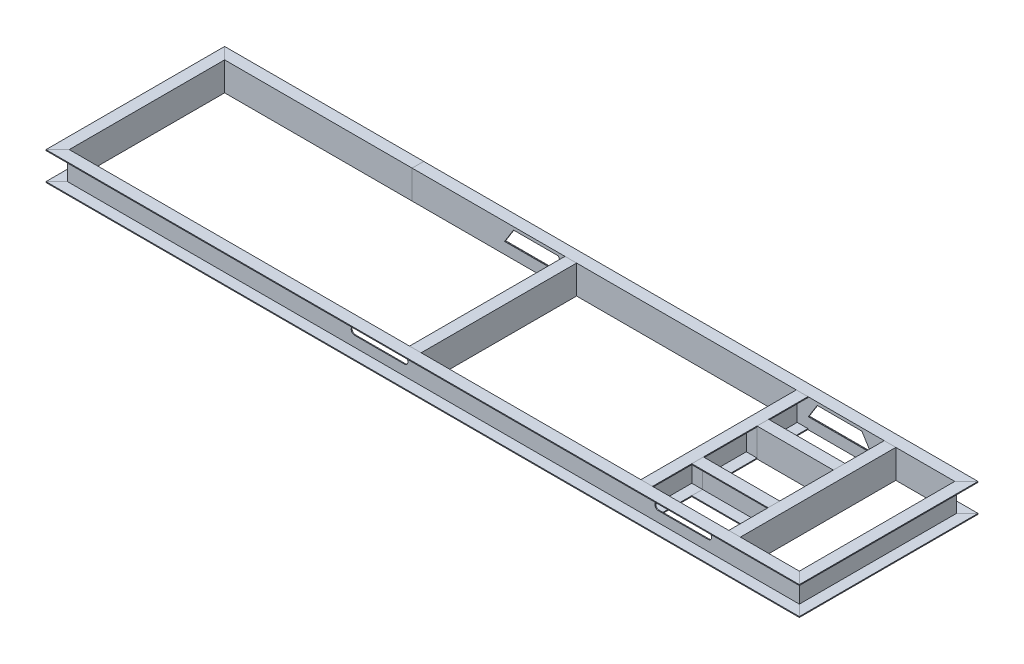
ISO-10303-21;
HEADER;
FILE_DESCRIPTION(('STEP AP214'),'2;1');
FILE_NAME('part.step','',(''),(''),'','','');
FILE_SCHEMA(('AUTOMOTIVE_DESIGN { 1 0 10303 214 1 1 1 1 }'));
ENDSEC;
DATA;
#1=APPLICATION_CONTEXT('core data for automotive mechanical design processes');
#2=APPLICATION_PROTOCOL_DEFINITION('international standard','automotive_design',2000,#1);
#3=PRODUCT_CONTEXT('',#1,'mechanical');
#4=PRODUCT('Part','Part','',(#3));
#5=PRODUCT_RELATED_PRODUCT_CATEGORY('part','',(#4));
#6=PRODUCT_DEFINITION_FORMATION('','',#4);
#7=PRODUCT_DEFINITION_CONTEXT('part definition',#1,'design');
#8=PRODUCT_DEFINITION('design','',#6,#7);
#9=PRODUCT_DEFINITION_SHAPE('','',#8);
#10=(LENGTH_UNIT() NAMED_UNIT(*) SI_UNIT(.MILLI.,.METRE.));
#11=(NAMED_UNIT(*) PLANE_ANGLE_UNIT() SI_UNIT($,.RADIAN.));
#12=(NAMED_UNIT(*) SI_UNIT($,.STERADIAN.) SOLID_ANGLE_UNIT());
#13=UNCERTAINTY_MEASURE_WITH_UNIT(LENGTH_MEASURE(1.E-05),#10,'distance_accuracy_value','');
#14=(GEOMETRIC_REPRESENTATION_CONTEXT(3) GLOBAL_UNCERTAINTY_ASSIGNED_CONTEXT((#13)) GLOBAL_UNIT_ASSIGNED_CONTEXT((#10,
#11,#12)) REPRESENTATION_CONTEXT('',''));
#15=CARTESIAN_POINT('',(0.,0.,0.));
#16=DIRECTION('',(0.,0.,1.));
#17=DIRECTION('',(1.,0.,0.));
#18=AXIS2_PLACEMENT_3D('',#15,#16,#17);
#19=CARTESIAN_POINT('',(2702.58425738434,5.,285.));
#20=DIRECTION('',(0.,-1.,0.));
#21=DIRECTION('',(0.,0.,1.));
#22=AXIS2_PLACEMENT_3D('',#19,#20,#21);
#23=PLANE('',#22);
#24=DIRECTION('',(0.,0.,-1.));
#25=VECTOR('',#24,1.);
#26=CARTESIAN_POINT('',(2642.58425738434,5.,285.));
#27=LINE('',#26,#25);
#28=CARTESIAN_POINT('',(2642.58425738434,5.,285.));
#29=VERTEX_POINT('',#28);
#30=CARTESIAN_POINT('',(2642.58425738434,5.,280.));
#31=VERTEX_POINT('',#30);
#32=EDGE_CURVE('E110',#29,#31,#27,.T.);
#33=ORIENTED_EDGE('',*,*,#32,.T.);
#34=DIRECTION('',(-1.,0.,0.));
#35=VECTOR('',#34,1.);
#36=CARTESIAN_POINT('',(2702.58425738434,5.,280.));
#37=LINE('',#36,#35);
#38=CARTESIAN_POINT('',(2702.58425738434,5.,280.));
#39=VERTEX_POINT('',#38);
#40=EDGE_CURVE('E49',#39,#31,#37,.T.);
#41=ORIENTED_EDGE('',*,*,#40,.F.);
#42=DIRECTION('',(0.,0.,-1.));
#43=VECTOR('',#42,1.);
#44=CARTESIAN_POINT('',(2702.58425738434,5.,285.));
#45=LINE('',#44,#43);
#46=CARTESIAN_POINT('',(2702.58425738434,5.,285.));
#47=VERTEX_POINT('',#46);
#48=EDGE_CURVE('E99',#47,#39,#45,.T.);
#49=ORIENTED_EDGE('',*,*,#48,.F.);
#50=DIRECTION('',(-1.,0.,0.));
#51=VECTOR('',#50,1.);
#52=CARTESIAN_POINT('',(2702.58425738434,5.,285.));
#53=LINE('',#52,#51);
#54=EDGE_CURVE('E12',#47,#29,#53,.T.);
#55=ORIENTED_EDGE('',*,*,#54,.T.);
#56=EDGE_LOOP('',(#33,#41,#49,#55));
#57=FACE_BOUND('',#56,.T.);
#58=ADVANCED_FACE('F46',(#57),#23,.T.);
#59=CARTESIAN_POINT('',(2702.58425738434,5.,285.));
#60=DIRECTION('',(0.,0.,-1.));
#61=DIRECTION('',(1.,0.,0.));
#62=AXIS2_PLACEMENT_3D('',#59,#60,#61);
#63=PLANE('',#62);
#64=DIRECTION('',(0.,1.,0.));
#65=VECTOR('',#64,1.);
#66=CARTESIAN_POINT('',(2642.58425738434,5.,285.));
#67=LINE('',#66,#65);
#68=CARTESIAN_POINT('',(2642.58425738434,155.,285.));
#69=VERTEX_POINT('',#68);
#70=EDGE_CURVE('E87',#29,#69,#67,.T.);
#71=ORIENTED_EDGE('',*,*,#70,.F.);
#72=ORIENTED_EDGE('',*,*,#54,.F.);
#73=DIRECTION('',(0.,1.,0.));
#74=VECTOR('',#73,1.);
#75=CARTESIAN_POINT('',(2702.58425738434,5.,285.));
#76=LINE('',#75,#74);
#77=CARTESIAN_POINT('',(2702.58425738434,155.,285.));
#78=VERTEX_POINT('',#77);
#79=EDGE_CURVE('E64',#47,#78,#76,.T.);
#80=ORIENTED_EDGE('',*,*,#79,.T.);
#81=DIRECTION('',(-1.,0.,0.));
#82=VECTOR('',#81,1.);
#83=CARTESIAN_POINT('',(2702.58425738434,155.,285.));
#84=LINE('',#83,#82);
#85=EDGE_CURVE('E55',#78,#69,#84,.T.);
#86=ORIENTED_EDGE('',*,*,#85,.T.);
#87=EDGE_LOOP('',(#71,#72,#80,#86));
#88=FACE_BOUND('',#87,.T.);
#89=ADVANCED_FACE('F116',(#88),#63,.F.);
#90=CARTESIAN_POINT('',(2702.58425738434,155.,285.));
#91=DIRECTION('',(0.,-1.,0.));
#92=DIRECTION('',(0.,0.,1.));
#93=AXIS2_PLACEMENT_3D('',#90,#91,#92);
#94=PLANE('',#93);
#95=DIRECTION('',(0.,0.,-1.));
#96=VECTOR('',#95,1.);
#97=CARTESIAN_POINT('',(2642.58425738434,155.,285.));
#98=LINE('',#97,#96);
#99=CARTESIAN_POINT('',(2642.58425738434,155.,280.));
#100=VERTEX_POINT('',#99);
#101=EDGE_CURVE('E81',#69,#100,#98,.T.);
#102=ORIENTED_EDGE('',*,*,#101,.F.);
#103=ORIENTED_EDGE('',*,*,#85,.F.);
#104=DIRECTION('',(0.,0.,-1.));
#105=VECTOR('',#104,1.);
#106=CARTESIAN_POINT('',(2702.58425738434,155.,285.));
#107=LINE('',#106,#105);
#108=CARTESIAN_POINT('',(2702.58425738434,155.,280.));
#109=VERTEX_POINT('',#108);
#110=EDGE_CURVE('E97',#78,#109,#107,.T.);
#111=ORIENTED_EDGE('',*,*,#110,.T.);
#112=DIRECTION('',(-1.,0.,0.));
#113=VECTOR('',#112,1.);
#114=CARTESIAN_POINT('',(2702.58425738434,155.,280.));
#115=LINE('',#114,#113);
#116=EDGE_CURVE('E102',#109,#100,#115,.T.);
#117=ORIENTED_EDGE('',*,*,#116,.T.);
#118=EDGE_LOOP('',(#102,#103,#111,#117));
#119=FACE_BOUND('',#118,.T.);
#120=ADVANCED_FACE('F105',(#119),#94,.F.);
#121=CARTESIAN_POINT('',(2702.58425738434,5.,280.));
#122=DIRECTION('',(0.,0.,-1.));
#123=DIRECTION('',(1.,0.,0.));
#124=AXIS2_PLACEMENT_3D('',#121,#122,#123);
#125=PLANE('',#124);
#126=DIRECTION('',(0.,1.,0.));
#127=VECTOR('',#126,1.);
#128=CARTESIAN_POINT('',(2642.58425738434,5.,280.));
#129=LINE('',#128,#127);
#130=EDGE_CURVE('E104',#31,#100,#129,.T.);
#131=ORIENTED_EDGE('',*,*,#130,.T.);
#132=ORIENTED_EDGE('',*,*,#116,.F.);
#133=DIRECTION('',(0.,1.,0.));
#134=VECTOR('',#133,1.);
#135=CARTESIAN_POINT('',(2702.58425738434,5.,280.));
#136=LINE('',#135,#134);
#137=EDGE_CURVE('E94',#39,#109,#136,.T.);
#138=ORIENTED_EDGE('',*,*,#137,.F.);
#139=ORIENTED_EDGE('',*,*,#40,.T.);
#140=EDGE_LOOP('',(#131,#132,#138,#139));
#141=FACE_BOUND('',#140,.T.);
#142=ADVANCED_FACE('F103',(#141),#125,.T.);
#143=CARTESIAN_POINT('',(2702.58425738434,0.,870.));
#144=DIRECTION('',(-1.,0.,0.));
#145=DIRECTION('',(0.,0.,-1.));
#146=AXIS2_PLACEMENT_3D('',#143,#144,#145);
#147=PLANE('',#146);
#148=ORIENTED_EDGE('',*,*,#48,.T.);
#149=ORIENTED_EDGE('',*,*,#137,.T.);
#150=ORIENTED_EDGE('',*,*,#110,.F.);
#151=ORIENTED_EDGE('',*,*,#79,.F.);
#152=EDGE_LOOP('',(#148,#149,#150,#151));
#153=FACE_BOUND('',#152,.T.);
#154=ADVANCED_FACE('F95',(#153),#147,.F.);
#155=CARTESIAN_POINT('',(2642.58425738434,0.,870.));
#156=DIRECTION('',(-1.,0.,0.));
#157=DIRECTION('',(0.,0.,-1.));
#158=AXIS2_PLACEMENT_3D('',#155,#156,#157);
#159=PLANE('',#158);
#160=ORIENTED_EDGE('',*,*,#32,.F.);
#161=ORIENTED_EDGE('',*,*,#70,.T.);
#162=ORIENTED_EDGE('',*,*,#101,.T.);
#163=ORIENTED_EDGE('',*,*,#130,.F.);
#164=EDGE_LOOP('',(#160,#161,#162,#163));
#165=FACE_BOUND('',#164,.T.);
#166=ADVANCED_FACE('F119',(#165),#159,.T.);
#167=CLOSED_SHELL('',(#58,#89,#120,#142,#154,#166));
#168=MANIFOLD_SOLID_BREP('B2',#167);
#169=CARTESIAN_POINT('',(2155.58425738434,4.99999999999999,280.));
#170=DIRECTION('',(0.,0.,1.));
#171=DIRECTION('',(0.,1.,0.));
#172=AXIS2_PLACEMENT_3D('',#169,#170,#171);
#173=PLANE('',#172);
#174=DIRECTION('',(0.,1.,0.));
#175=VECTOR('',#174,1.);
#176=CARTESIAN_POINT('',(2215.58425738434,4.99999999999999,280.));
#177=LINE('',#176,#175);
#178=CARTESIAN_POINT('',(2215.58425738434,4.99999999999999,280.));
#179=VERTEX_POINT('',#178);
#180=CARTESIAN_POINT('',(2215.58425738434,155.,280.));
#181=VERTEX_POINT('',#180);
#182=EDGE_CURVE('E243',#179,#181,#177,.T.);
#183=ORIENTED_EDGE('',*,*,#182,.F.);
#184=DIRECTION('',(1.,0.,0.));
#185=VECTOR('',#184,1.);
#186=CARTESIAN_POINT('',(2155.58425738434,4.99999999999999,280.));
#187=LINE('',#186,#185);
#188=CARTESIAN_POINT('',(2155.58425738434,4.99999999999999,280.));
#189=VERTEX_POINT('',#188);
#190=EDGE_CURVE('E242',#189,#179,#187,.T.);
#191=ORIENTED_EDGE('',*,*,#190,.F.);
#192=DIRECTION('',(0.,1.,0.));
#193=VECTOR('',#192,1.);
#194=CARTESIAN_POINT('',(2155.58425738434,4.99999999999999,280.));
#195=LINE('',#194,#193);
#196=CARTESIAN_POINT('',(2155.58425738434,155.,280.));
#197=VERTEX_POINT('',#196);
#198=EDGE_CURVE('E237',#189,#197,#195,.T.);
#199=ORIENTED_EDGE('',*,*,#198,.T.);
#200=DIRECTION('',(1.,0.,0.));
#201=VECTOR('',#200,1.);
#202=CARTESIAN_POINT('',(2155.58425738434,155.,280.));
#203=LINE('',#202,#201);
#204=EDGE_CURVE('E44',#197,#181,#203,.T.);
#205=ORIENTED_EDGE('',*,*,#204,.T.);
#206=EDGE_LOOP('',(#183,#191,#199,#205));
#207=FACE_BOUND('',#206,.T.);
#208=ADVANCED_FACE('F180',(#207),#173,.F.);
#209=CARTESIAN_POINT('',(2155.58425738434,155.,280.));
#210=DIRECTION('',(0.,-1.,0.));
#211=DIRECTION('',(0.,0.,1.));
#212=AXIS2_PLACEMENT_3D('',#209,#210,#211);
#213=PLANE('',#212);
#214=DIRECTION('',(0.,0.,1.));
#215=VECTOR('',#214,1.);
#216=CARTESIAN_POINT('',(2215.58425738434,155.,280.));
#217=LINE('',#216,#215);
#218=CARTESIAN_POINT('',(2215.58425738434,155.,285.));
#219=VERTEX_POINT('',#218);
#220=EDGE_CURVE('E245',#181,#219,#217,.T.);
#221=ORIENTED_EDGE('',*,*,#220,.F.);
#222=ORIENTED_EDGE('',*,*,#204,.F.);
#223=DIRECTION('',(0.,0.,1.));
#224=VECTOR('',#223,1.);
#225=CARTESIAN_POINT('',(2155.58425738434,155.,280.));
#226=LINE('',#225,#224);
#227=CARTESIAN_POINT('',(2155.58425738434,155.,285.));
#228=VERTEX_POINT('',#227);
#229=EDGE_CURVE('E221',#197,#228,#226,.T.);
#230=ORIENTED_EDGE('',*,*,#229,.T.);
#231=DIRECTION('',(1.,0.,0.));
#232=VECTOR('',#231,1.);
#233=CARTESIAN_POINT('',(2155.58425738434,155.,285.));
#234=LINE('',#233,#232);
#235=EDGE_CURVE('E188',#228,#219,#234,.T.);
#236=ORIENTED_EDGE('',*,*,#235,.T.);
#237=EDGE_LOOP('',(#221,#222,#230,#236));
#238=FACE_BOUND('',#237,.T.);
#239=ADVANCED_FACE('F235',(#238),#213,.F.);
#240=CARTESIAN_POINT('',(2155.58425738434,4.99999999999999,285.));
#241=DIRECTION('',(0.,0.,-1.));
#242=DIRECTION('',(1.,0.,0.));
#243=AXIS2_PLACEMENT_3D('',#240,#241,#242);
#244=PLANE('',#243);
#245=DIRECTION('',(0.,-1.,0.));
#246=VECTOR('',#245,1.);
#247=CARTESIAN_POINT('',(2215.58425738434,4.99999999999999,285.));
#248=LINE('',#247,#246);
#249=CARTESIAN_POINT('',(2215.58425738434,4.99999999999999,285.));
#250=VERTEX_POINT('',#249);
#251=EDGE_CURVE('E231',#219,#250,#248,.T.);
#252=ORIENTED_EDGE('',*,*,#251,.F.);
#253=ORIENTED_EDGE('',*,*,#235,.F.);
#254=DIRECTION('',(0.,-1.,0.));
#255=VECTOR('',#254,1.);
#256=CARTESIAN_POINT('',(2155.58425738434,4.99999999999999,285.));
#257=LINE('',#256,#255);
#258=CARTESIAN_POINT('',(2155.58425738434,4.99999999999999,285.));
#259=VERTEX_POINT('',#258);
#260=EDGE_CURVE('E224',#228,#259,#257,.T.);
#261=ORIENTED_EDGE('',*,*,#260,.T.);
#262=DIRECTION('',(1.,0.,0.));
#263=VECTOR('',#262,1.);
#264=CARTESIAN_POINT('',(2155.58425738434,4.99999999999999,285.));
#265=LINE('',#264,#263);
#266=EDGE_CURVE('E234',#259,#250,#265,.T.);
#267=ORIENTED_EDGE('',*,*,#266,.T.);
#268=EDGE_LOOP('',(#252,#253,#261,#267));
#269=FACE_BOUND('',#268,.T.);
#270=ADVANCED_FACE('F230',(#269),#244,.F.);
#271=CARTESIAN_POINT('',(2155.58425738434,4.99999999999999,280.));
#272=DIRECTION('',(0.,1.,0.));
#273=DIRECTION('',(0.,0.,-1.));
#274=AXIS2_PLACEMENT_3D('',#271,#272,#273);
#275=PLANE('',#274);
#276=DIRECTION('',(0.,0.,-1.));
#277=VECTOR('',#276,1.);
#278=CARTESIAN_POINT('',(2215.58425738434,4.99999999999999,280.));
#279=LINE('',#278,#277);
#280=EDGE_CURVE('E210',#250,#179,#279,.T.);
#281=ORIENTED_EDGE('',*,*,#280,.F.);
#282=ORIENTED_EDGE('',*,*,#266,.F.);
#283=DIRECTION('',(0.,0.,-1.));
#284=VECTOR('',#283,1.);
#285=CARTESIAN_POINT('',(2155.58425738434,4.99999999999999,280.));
#286=LINE('',#285,#284);
#287=EDGE_CURVE('E196',#259,#189,#286,.T.);
#288=ORIENTED_EDGE('',*,*,#287,.T.);
#289=ORIENTED_EDGE('',*,*,#190,.T.);
#290=EDGE_LOOP('',(#281,#282,#288,#289));
#291=FACE_BOUND('',#290,.T.);
#292=ADVANCED_FACE('F254',(#291),#275,.F.);
#293=CARTESIAN_POINT('',(2155.58425738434,0.,870.));
#294=DIRECTION('',(-1.,0.,0.));
#295=DIRECTION('',(0.,0.,-1.));
#296=AXIS2_PLACEMENT_3D('',#293,#294,#295);
#297=PLANE('',#296);
#298=ORIENTED_EDGE('',*,*,#198,.F.);
#299=ORIENTED_EDGE('',*,*,#287,.F.);
#300=ORIENTED_EDGE('',*,*,#260,.F.);
#301=ORIENTED_EDGE('',*,*,#229,.F.);
#302=EDGE_LOOP('',(#298,#299,#300,#301));
#303=FACE_BOUND('',#302,.T.);
#304=ADVANCED_FACE('F226',(#303),#297,.T.);
#305=CARTESIAN_POINT('',(2215.58425738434,0.,870.));
#306=DIRECTION('',(-1.,0.,0.));
#307=DIRECTION('',(0.,0.,-1.));
#308=AXIS2_PLACEMENT_3D('',#305,#306,#307);
#309=PLANE('',#308);
#310=ORIENTED_EDGE('',*,*,#182,.T.);
#311=ORIENTED_EDGE('',*,*,#220,.T.);
#312=ORIENTED_EDGE('',*,*,#251,.T.);
#313=ORIENTED_EDGE('',*,*,#280,.T.);
#314=EDGE_LOOP('',(#310,#311,#312,#313));
#315=FACE_BOUND('',#314,.T.);
#316=ADVANCED_FACE('F250',(#315),#309,.F.);
#317=CLOSED_SHELL('',(#208,#239,#270,#292,#304,#316));
#318=MANIFOLD_SOLID_BREP('B6',#317);
#319=CARTESIAN_POINT('',(2815.28341777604,155.,220.));
#320=DIRECTION('',(0.,1.,0.));
#321=DIRECTION('',(0.,0.,-1.));
#322=AXIS2_PLACEMENT_3D('',#319,#320,#321);
#323=PLANE('',#322);
#324=DIRECTION('',(0.,0.,1.));
#325=VECTOR('',#324,1.);
#326=CARTESIAN_POINT('',(2642.58425738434,155.,220.));
#327=LINE('',#326,#325);
#328=CARTESIAN_POINT('',(2642.58425738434,155.,220.));
#329=VERTEX_POINT('',#328);
#330=CARTESIAN_POINT('',(2642.58425738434,155.,280.));
#331=VERTEX_POINT('',#330);
#332=EDGE_CURVE('E416',#329,#331,#327,.T.);
#333=ORIENTED_EDGE('',*,*,#332,.T.);
#334=DIRECTION('',(-1.,0.,0.));
#335=VECTOR('',#334,1.);
#336=CARTESIAN_POINT('',(2815.28341777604,155.,280.));
#337=LINE('',#336,#335);
#338=CARTESIAN_POINT('',(2215.58425738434,155.,280.));
#339=VERTEX_POINT('',#338);
#340=EDGE_CURVE('E420',#331,#339,#337,.T.);
#341=ORIENTED_EDGE('',*,*,#340,.T.);
#342=DIRECTION('',(0.,0.,1.));
#343=VECTOR('',#342,1.);
#344=CARTESIAN_POINT('',(2215.58425738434,155.,220.));
#345=LINE('',#344,#343);
#346=CARTESIAN_POINT('',(2215.58425738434,155.,220.));
#347=VERTEX_POINT('',#346);
#348=EDGE_CURVE('E423',#347,#339,#345,.T.);
#349=ORIENTED_EDGE('',*,*,#348,.F.);
#350=DIRECTION('',(-1.,0.,0.));
#351=VECTOR('',#350,1.);
#352=CARTESIAN_POINT('',(2815.28341777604,155.,220.));
#353=LINE('',#352,#351);
#354=EDGE_CURVE('E318',#329,#347,#353,.T.);
#355=ORIENTED_EDGE('',*,*,#354,.F.);
#356=EDGE_LOOP('',(#333,#341,#349,#355));
#357=FACE_BOUND('',#356,.T.);
#358=ADVANCED_FACE('F314',(#357),#323,.F.);
#359=CARTESIAN_POINT('',(2815.28341777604,155.,280.));
#360=DIRECTION('',(0.,0.,1.));
#361=DIRECTION('',(-1.,0.,0.));
#362=AXIS2_PLACEMENT_3D('',#359,#360,#361);
#363=PLANE('',#362);
#364=DIRECTION('',(0.,-1.,0.));
#365=VECTOR('',#364,1.);
#366=CARTESIAN_POINT('',(2642.58425738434,155.,280.));
#367=LINE('',#366,#365);
#368=CARTESIAN_POINT('',(2642.58425738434,4.99999999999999,280.));
#369=VERTEX_POINT('',#368);
#370=EDGE_CURVE('E379',#331,#369,#367,.T.);
#371=ORIENTED_EDGE('',*,*,#370,.T.);
#372=DIRECTION('',(-1.,0.,0.));
#373=VECTOR('',#372,1.);
#374=CARTESIAN_POINT('',(2815.28341777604,4.99999999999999,280.));
#375=LINE('',#374,#373);
#376=CARTESIAN_POINT('',(2215.58425738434,4.99999999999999,280.));
#377=VERTEX_POINT('',#376);
#378=EDGE_CURVE('E424',#369,#377,#375,.T.);
#379=ORIENTED_EDGE('',*,*,#378,.T.);
#380=DIRECTION('',(0.,-1.,0.));
#381=VECTOR('',#380,1.);
#382=CARTESIAN_POINT('',(2215.58425738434,155.,280.));
#383=LINE('',#382,#381);
#384=EDGE_CURVE('E370',#339,#377,#383,.T.);
#385=ORIENTED_EDGE('',*,*,#384,.F.);
#386=ORIENTED_EDGE('',*,*,#340,.F.);
#387=EDGE_LOOP('',(#371,#379,#385,#386));
#388=FACE_BOUND('',#387,.T.);
#389=ADVANCED_FACE('F450',(#388),#363,.F.);
#390=CARTESIAN_POINT('',(2815.28341777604,4.99999999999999,280.));
#391=DIRECTION('',(0.,-1.,0.));
#392=DIRECTION('',(0.,0.,1.));
#393=AXIS2_PLACEMENT_3D('',#390,#391,#392);
#394=PLANE('',#393);
#395=DIRECTION('',(0.,0.,-1.));
#396=VECTOR('',#395,1.);
#397=CARTESIAN_POINT('',(2642.58425738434,4.99999999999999,280.));
#398=LINE('',#397,#396);
#399=CARTESIAN_POINT('',(2642.58425738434,4.99999999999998,220.));
#400=VERTEX_POINT('',#399);
#401=EDGE_CURVE('E412',#369,#400,#398,.T.);
#402=ORIENTED_EDGE('',*,*,#401,.T.);
#403=DIRECTION('',(-1.,0.,0.));
#404=VECTOR('',#403,1.);
#405=CARTESIAN_POINT('',(2815.28341777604,4.99999999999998,220.));
#406=LINE('',#405,#404);
#407=CARTESIAN_POINT('',(2215.58425738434,4.99999999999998,220.));
#408=VERTEX_POINT('',#407);
#409=EDGE_CURVE('E427',#400,#408,#406,.T.);
#410=ORIENTED_EDGE('',*,*,#409,.T.);
#411=DIRECTION('',(0.,0.,-1.));
#412=VECTOR('',#411,1.);
#413=CARTESIAN_POINT('',(2215.58425738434,4.99999999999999,280.));
#414=LINE('',#413,#412);
#415=EDGE_CURVE('E426',#377,#408,#414,.T.);
#416=ORIENTED_EDGE('',*,*,#415,.F.);
#417=ORIENTED_EDGE('',*,*,#378,.F.);
#418=EDGE_LOOP('',(#402,#410,#416,#417));
#419=FACE_BOUND('',#418,.T.);
#420=ADVANCED_FACE('F453',(#419),#394,.F.);
#421=CARTESIAN_POINT('',(2815.28341777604,4.99999999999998,220.));
#422=DIRECTION('',(0.,0.,1.));
#423=DIRECTION('',(-1.,0.,0.));
#424=AXIS2_PLACEMENT_3D('',#421,#422,#423);
#425=PLANE('',#424);
#426=DIRECTION('',(0.,-1.,0.));
#427=VECTOR('',#426,1.);
#428=CARTESIAN_POINT('',(2642.58425738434,4.99999999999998,220.));
#429=LINE('',#428,#427);
#430=CARTESIAN_POINT('',(2642.58425738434,0.,220.));
#431=VERTEX_POINT('',#430);
#432=EDGE_CURVE('E406',#400,#431,#429,.T.);
#433=ORIENTED_EDGE('',*,*,#432,.T.);
#434=DIRECTION('',(-1.,0.,0.));
#435=VECTOR('',#434,1.);
#436=CARTESIAN_POINT('',(2815.28341777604,0.,220.));
#437=LINE('',#436,#435);
#438=CARTESIAN_POINT('',(2215.58425738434,0.,220.));
#439=VERTEX_POINT('',#438);
#440=EDGE_CURVE('E431',#431,#439,#437,.T.);
#441=ORIENTED_EDGE('',*,*,#440,.T.);
#442=DIRECTION('',(0.,-1.,0.));
#443=VECTOR('',#442,1.);
#444=CARTESIAN_POINT('',(2215.58425738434,4.99999999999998,220.));
#445=LINE('',#444,#443);
#446=EDGE_CURVE('E430',#408,#439,#445,.T.);
#447=ORIENTED_EDGE('',*,*,#446,.F.);
#448=ORIENTED_EDGE('',*,*,#409,.F.);
#449=EDGE_LOOP('',(#433,#441,#447,#448));
#450=FACE_BOUND('',#449,.T.);
#451=ADVANCED_FACE('F471',(#450),#425,.F.);
#452=CARTESIAN_POINT('',(2815.28341777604,0.,220.));
#453=DIRECTION('',(0.,1.,0.));
#454=DIRECTION('',(0.,0.,-1.));
#455=AXIS2_PLACEMENT_3D('',#452,#453,#454);
#456=PLANE('',#455);
#457=DIRECTION('',(0.,0.,1.));
#458=VECTOR('',#457,1.);
#459=CARTESIAN_POINT('',(2642.58425738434,0.,220.));
#460=LINE('',#459,#458);
#461=CARTESIAN_POINT('',(2642.58425738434,0.,285.));
#462=VERTEX_POINT('',#461);
#463=EDGE_CURVE('E404',#431,#462,#460,.T.);
#464=ORIENTED_EDGE('',*,*,#463,.T.);
#465=DIRECTION('',(-1.,0.,0.));
#466=VECTOR('',#465,1.);
#467=CARTESIAN_POINT('',(2815.28341777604,0.,285.));
#468=LINE('',#467,#466);
#469=CARTESIAN_POINT('',(2215.58425738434,0.,285.));
#470=VERTEX_POINT('',#469);
#471=EDGE_CURVE('E402',#462,#470,#468,.T.);
#472=ORIENTED_EDGE('',*,*,#471,.T.);
#473=DIRECTION('',(0.,0.,1.));
#474=VECTOR('',#473,1.);
#475=CARTESIAN_POINT('',(2215.58425738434,0.,220.));
#476=LINE('',#475,#474);
#477=EDGE_CURVE('E434',#439,#470,#476,.T.);
#478=ORIENTED_EDGE('',*,*,#477,.F.);
#479=ORIENTED_EDGE('',*,*,#440,.F.);
#480=EDGE_LOOP('',(#464,#472,#478,#479));
#481=FACE_BOUND('',#480,.T.);
#482=ADVANCED_FACE('F474',(#481),#456,.F.);
#483=CARTESIAN_POINT('',(2815.28341777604,0.,285.));
#484=DIRECTION('',(0.,0.,-1.));
#485=DIRECTION('',(1.,0.,0.));
#486=AXIS2_PLACEMENT_3D('',#483,#484,#485);
#487=PLANE('',#486);
#488=DIRECTION('',(0.,1.,0.));
#489=VECTOR('',#488,1.);
#490=CARTESIAN_POINT('',(2642.58425738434,0.,285.));
#491=LINE('',#490,#489);
#492=CARTESIAN_POINT('',(2642.58425738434,160.,285.));
#493=VERTEX_POINT('',#492);
#494=EDGE_CURVE('E323',#462,#493,#491,.T.);
#495=ORIENTED_EDGE('',*,*,#494,.T.);
#496=DIRECTION('',(-1.,0.,0.));
#497=VECTOR('',#496,1.);
#498=CARTESIAN_POINT('',(2815.28341777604,160.,285.));
#499=LINE('',#498,#497);
#500=CARTESIAN_POINT('',(2215.58425738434,160.,285.));
#501=VERTEX_POINT('',#500);
#502=EDGE_CURVE('E393',#493,#501,#499,.T.);
#503=ORIENTED_EDGE('',*,*,#502,.T.);
#504=DIRECTION('',(0.,1.,0.));
#505=VECTOR('',#504,1.);
#506=CARTESIAN_POINT('',(2215.58425738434,0.,285.));
#507=LINE('',#506,#505);
#508=EDGE_CURVE('E398',#470,#501,#507,.T.);
#509=ORIENTED_EDGE('',*,*,#508,.F.);
#510=ORIENTED_EDGE('',*,*,#471,.F.);
#511=EDGE_LOOP('',(#495,#503,#509,#510));
#512=FACE_BOUND('',#511,.T.);
#513=ADVANCED_FACE('F400',(#512),#487,.F.);
#514=CARTESIAN_POINT('',(2815.28341777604,160.,285.));
#515=DIRECTION('',(0.,-1.,0.));
#516=DIRECTION('',(0.,0.,1.));
#517=AXIS2_PLACEMENT_3D('',#514,#515,#516);
#518=PLANE('',#517);
#519=DIRECTION('',(0.,0.,-1.));
#520=VECTOR('',#519,1.);
#521=CARTESIAN_POINT('',(2642.58425738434,160.,285.));
#522=LINE('',#521,#520);
#523=CARTESIAN_POINT('',(2642.58425738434,160.,220.));
#524=VERTEX_POINT('',#523);
#525=EDGE_CURVE('E178',#493,#524,#522,.T.);
#526=ORIENTED_EDGE('',*,*,#525,.T.);
#527=DIRECTION('',(-1.,0.,0.));
#528=VECTOR('',#527,1.);
#529=CARTESIAN_POINT('',(2815.28341777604,160.,220.));
#530=LINE('',#529,#528);
#531=CARTESIAN_POINT('',(2215.58425738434,160.,220.));
#532=VERTEX_POINT('',#531);
#533=EDGE_CURVE('E435',#524,#532,#530,.T.);
#534=ORIENTED_EDGE('',*,*,#533,.T.);
#535=DIRECTION('',(0.,0.,-1.));
#536=VECTOR('',#535,1.);
#537=CARTESIAN_POINT('',(2215.58425738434,160.,285.));
#538=LINE('',#537,#536);
#539=EDGE_CURVE('E395',#501,#532,#538,.T.);
#540=ORIENTED_EDGE('',*,*,#539,.F.);
#541=ORIENTED_EDGE('',*,*,#502,.F.);
#542=EDGE_LOOP('',(#526,#534,#540,#541));
#543=FACE_BOUND('',#542,.T.);
#544=ADVANCED_FACE('F394',(#543),#518,.F.);
#545=CARTESIAN_POINT('',(2815.28341777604,160.,220.));
#546=DIRECTION('',(0.,0.,1.));
#547=DIRECTION('',(-1.,0.,0.));
#548=AXIS2_PLACEMENT_3D('',#545,#546,#547);
#549=PLANE('',#548);
#550=DIRECTION('',(0.,-1.,0.));
#551=VECTOR('',#550,1.);
#552=CARTESIAN_POINT('',(2642.58425738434,160.,220.));
#553=LINE('',#552,#551);
#554=EDGE_CURVE('E331',#524,#329,#553,.T.);
#555=ORIENTED_EDGE('',*,*,#554,.T.);
#556=ORIENTED_EDGE('',*,*,#354,.T.);
#557=DIRECTION('',(0.,-1.,0.));
#558=VECTOR('',#557,1.);
#559=CARTESIAN_POINT('',(2215.58425738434,160.,220.));
#560=LINE('',#559,#558);
#561=EDGE_CURVE('E337',#532,#347,#560,.T.);
#562=ORIENTED_EDGE('',*,*,#561,.F.);
#563=ORIENTED_EDGE('',*,*,#533,.F.);
#564=EDGE_LOOP('',(#555,#556,#562,#563));
#565=FACE_BOUND('',#564,.T.);
#566=ADVANCED_FACE('F448',(#565),#549,.F.);
#567=CARTESIAN_POINT('',(2215.58425738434,0.,870.));
#568=DIRECTION('',(-1.,0.,0.));
#569=DIRECTION('',(0.,0.,-1.));
#570=AXIS2_PLACEMENT_3D('',#567,#568,#569);
#571=PLANE('',#570);
#572=ORIENTED_EDGE('',*,*,#348,.T.);
#573=ORIENTED_EDGE('',*,*,#384,.T.);
#574=ORIENTED_EDGE('',*,*,#415,.T.);
#575=ORIENTED_EDGE('',*,*,#446,.T.);
#576=ORIENTED_EDGE('',*,*,#477,.T.);
#577=ORIENTED_EDGE('',*,*,#508,.T.);
#578=ORIENTED_EDGE('',*,*,#539,.T.);
#579=ORIENTED_EDGE('',*,*,#561,.T.);
#580=EDGE_LOOP('',(#572,#573,#574,#575,#576,#577,#578,#579));
#581=FACE_BOUND('',#580,.T.);
#582=ADVANCED_FACE('F455',(#581),#571,.T.);
#583=CARTESIAN_POINT('',(2642.58425738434,155.,-172.699160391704));
#584=DIRECTION('',(1.,0.,0.));
#585=DIRECTION('',(0.,0.,1.));
#586=AXIS2_PLACEMENT_3D('',#583,#584,#585);
#587=PLANE('',#586);
#588=ORIENTED_EDGE('',*,*,#554,.F.);
#589=ORIENTED_EDGE('',*,*,#525,.F.);
#590=ORIENTED_EDGE('',*,*,#494,.F.);
#591=ORIENTED_EDGE('',*,*,#463,.F.);
#592=ORIENTED_EDGE('',*,*,#432,.F.);
#593=ORIENTED_EDGE('',*,*,#401,.F.);
#594=ORIENTED_EDGE('',*,*,#370,.F.);
#595=ORIENTED_EDGE('',*,*,#332,.F.);
#596=EDGE_LOOP('',(#588,#589,#590,#591,#592,#593,#594,#595));
#597=FACE_BOUND('',#596,.T.);
#598=ADVANCED_FACE('F316',(#597),#587,.T.);
#599=CLOSED_SHELL('',(#358,#389,#420,#451,#482,#513,#544,#566,#582,#598));
#600=MANIFOLD_SOLID_BREP('B38',#599);
#601=CARTESIAN_POINT('',(2155.58425738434,4.99999999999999,590.));
#602=DIRECTION('',(0.,0.,-1.));
#603=DIRECTION('',(0.,1.,0.));
#604=AXIS2_PLACEMENT_3D('',#601,#602,#603);
#605=PLANE('',#604);
#606=DIRECTION('',(0.,1.,0.));
#607=VECTOR('',#606,1.);
#608=CARTESIAN_POINT('',(2215.58425738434,4.99999999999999,590.));
#609=LINE('',#608,#607);
#610=CARTESIAN_POINT('',(2215.58425738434,4.99999999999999,590.));
#611=VERTEX_POINT('',#610);
#612=CARTESIAN_POINT('',(2215.58425738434,155.,590.));
#613=VERTEX_POINT('',#612);
#614=EDGE_CURVE('E615',#611,#613,#609,.T.);
#615=ORIENTED_EDGE('',*,*,#614,.T.);
#616=DIRECTION('',(1.,0.,0.));
#617=VECTOR('',#616,1.);
#618=CARTESIAN_POINT('',(2155.58425738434,155.,590.));
#619=LINE('',#618,#617);
#620=CARTESIAN_POINT('',(2155.58425738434,155.,590.));
#621=VERTEX_POINT('',#620);
#622=EDGE_CURVE('E312',#621,#613,#619,.T.);
#623=ORIENTED_EDGE('',*,*,#622,.F.);
#624=DIRECTION('',(0.,1.,0.));
#625=VECTOR('',#624,1.);
#626=CARTESIAN_POINT('',(2155.58425738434,4.99999999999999,590.));
#627=LINE('',#626,#625);
#628=CARTESIAN_POINT('',(2155.58425738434,4.99999999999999,590.));
#629=VERTEX_POINT('',#628);
#630=EDGE_CURVE('E603',#629,#621,#627,.T.);
#631=ORIENTED_EDGE('',*,*,#630,.F.);
#632=DIRECTION('',(1.,0.,0.));
#633=VECTOR('',#632,1.);
#634=CARTESIAN_POINT('',(2155.58425738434,4.99999999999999,590.));
#635=LINE('',#634,#633);
#636=EDGE_CURVE('E611',#629,#611,#635,.T.);
#637=ORIENTED_EDGE('',*,*,#636,.T.);
#638=EDGE_LOOP('',(#615,#623,#631,#637));
#639=FACE_BOUND('',#638,.T.);
#640=ADVANCED_FACE('F552',(#639),#605,.F.);
#641=CARTESIAN_POINT('',(2155.58425738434,155.,590.));
#642=DIRECTION('',(0.,-1.,0.));
#643=DIRECTION('',(0.,0.,-1.));
#644=AXIS2_PLACEMENT_3D('',#641,#642,#643);
#645=PLANE('',#644);
#646=DIRECTION('',(0.,0.,-1.));
#647=VECTOR('',#646,1.);
#648=CARTESIAN_POINT('',(2215.58425738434,155.,590.));
#649=LINE('',#648,#647);
#650=CARTESIAN_POINT('',(2215.58425738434,155.,585.));
#651=VERTEX_POINT('',#650);
#652=EDGE_CURVE('E607',#613,#651,#649,.T.);
#653=ORIENTED_EDGE('',*,*,#652,.T.);
#654=DIRECTION('',(1.,0.,0.));
#655=VECTOR('',#654,1.);
#656=CARTESIAN_POINT('',(2155.58425738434,155.,585.));
#657=LINE('',#656,#655);
#658=CARTESIAN_POINT('',(2155.58425738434,155.,585.));
#659=VERTEX_POINT('',#658);
#660=EDGE_CURVE('E560',#659,#651,#657,.T.);
#661=ORIENTED_EDGE('',*,*,#660,.F.);
#662=DIRECTION('',(0.,0.,-1.));
#663=VECTOR('',#662,1.);
#664=CARTESIAN_POINT('',(2155.58425738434,155.,590.));
#665=LINE('',#664,#663);
#666=EDGE_CURVE('E598',#621,#659,#665,.T.);
#667=ORIENTED_EDGE('',*,*,#666,.F.);
#668=ORIENTED_EDGE('',*,*,#622,.T.);
#669=EDGE_LOOP('',(#653,#661,#667,#668));
#670=FACE_BOUND('',#669,.T.);
#671=ADVANCED_FACE('F606',(#670),#645,.F.);
#672=CARTESIAN_POINT('',(2155.58425738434,4.99999999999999,585.));
#673=DIRECTION('',(0.,0.,1.));
#674=DIRECTION('',(1.,0.,0.));
#675=AXIS2_PLACEMENT_3D('',#672,#673,#674);
#676=PLANE('',#675);
#677=DIRECTION('',(0.,-1.,0.));
#678=VECTOR('',#677,1.);
#679=CARTESIAN_POINT('',(2215.58425738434,4.99999999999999,585.));
#680=LINE('',#679,#678);
#681=CARTESIAN_POINT('',(2215.58425738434,4.99999999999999,585.));
#682=VERTEX_POINT('',#681);
#683=EDGE_CURVE('E585',#651,#682,#680,.T.);
#684=ORIENTED_EDGE('',*,*,#683,.T.);
#685=DIRECTION('',(1.,0.,0.));
#686=VECTOR('',#685,1.);
#687=CARTESIAN_POINT('',(2155.58425738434,4.99999999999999,585.));
#688=LINE('',#687,#686);
#689=CARTESIAN_POINT('',(2155.58425738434,4.99999999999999,585.));
#690=VERTEX_POINT('',#689);
#691=EDGE_CURVE('E608',#690,#682,#688,.T.);
#692=ORIENTED_EDGE('',*,*,#691,.F.);
#693=DIRECTION('',(0.,-1.,0.));
#694=VECTOR('',#693,1.);
#695=CARTESIAN_POINT('',(2155.58425738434,4.99999999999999,585.));
#696=LINE('',#695,#694);
#697=EDGE_CURVE('E601',#659,#690,#696,.T.);
#698=ORIENTED_EDGE('',*,*,#697,.F.);
#699=ORIENTED_EDGE('',*,*,#660,.T.);
#700=EDGE_LOOP('',(#684,#692,#698,#699));
#701=FACE_BOUND('',#700,.T.);
#702=ADVANCED_FACE('F609',(#701),#676,.F.);
#703=CARTESIAN_POINT('',(2155.58425738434,4.99999999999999,590.));
#704=DIRECTION('',(0.,1.,0.));
#705=DIRECTION('',(0.,0.,1.));
#706=AXIS2_PLACEMENT_3D('',#703,#704,#705);
#707=PLANE('',#706);
#708=DIRECTION('',(0.,0.,1.));
#709=VECTOR('',#708,1.);
#710=CARTESIAN_POINT('',(2215.58425738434,4.99999999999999,590.));
#711=LINE('',#710,#709);
#712=EDGE_CURVE('E591',#682,#611,#711,.T.);
#713=ORIENTED_EDGE('',*,*,#712,.T.);
#714=ORIENTED_EDGE('',*,*,#636,.F.);
#715=DIRECTION('',(0.,0.,1.));
#716=VECTOR('',#715,1.);
#717=CARTESIAN_POINT('',(2155.58425738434,4.99999999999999,590.));
#718=LINE('',#717,#716);
#719=EDGE_CURVE('E568',#690,#629,#718,.T.);
#720=ORIENTED_EDGE('',*,*,#719,.F.);
#721=ORIENTED_EDGE('',*,*,#691,.T.);
#722=EDGE_LOOP('',(#713,#714,#720,#721));
#723=FACE_BOUND('',#722,.T.);
#724=ADVANCED_FACE('F622',(#723),#707,.F.);
#725=CARTESIAN_POINT('',(2155.58425738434,0.,0.));
#726=DIRECTION('',(-1.,0.,0.));
#727=DIRECTION('',(0.,0.,1.));
#728=AXIS2_PLACEMENT_3D('',#725,#726,#727);
#729=PLANE('',#728);
#730=ORIENTED_EDGE('',*,*,#630,.T.);
#731=ORIENTED_EDGE('',*,*,#666,.T.);
#732=ORIENTED_EDGE('',*,*,#697,.T.);
#733=ORIENTED_EDGE('',*,*,#719,.T.);
#734=EDGE_LOOP('',(#730,#731,#732,#733));
#735=FACE_BOUND('',#734,.T.);
#736=ADVANCED_FACE('F599',(#735),#729,.T.);
#737=CARTESIAN_POINT('',(2215.58425738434,0.,0.));
#738=DIRECTION('',(-1.,0.,0.));
#739=DIRECTION('',(0.,0.,1.));
#740=AXIS2_PLACEMENT_3D('',#737,#738,#739);
#741=PLANE('',#740);
#742=ORIENTED_EDGE('',*,*,#614,.F.);
#743=ORIENTED_EDGE('',*,*,#712,.F.);
#744=ORIENTED_EDGE('',*,*,#683,.F.);
#745=ORIENTED_EDGE('',*,*,#652,.F.);
#746=EDGE_LOOP('',(#742,#743,#744,#745));
#747=FACE_BOUND('',#746,.T.);
#748=ADVANCED_FACE('F625',(#747),#741,.F.);
#749=CLOSED_SHELL('',(#640,#671,#702,#724,#736,#748));
#750=MANIFOLD_SOLID_BREP('B172',#749);
#751=CARTESIAN_POINT('',(2702.58425738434,5.,585.));
#752=DIRECTION('',(0.,-1.,0.));
#753=DIRECTION('',(0.,0.,-1.));
#754=AXIS2_PLACEMENT_3D('',#751,#752,#753);
#755=PLANE('',#754);
#756=DIRECTION('',(0.,0.,1.));
#757=VECTOR('',#756,1.);
#758=CARTESIAN_POINT('',(2642.58425738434,5.,585.));
#759=LINE('',#758,#757);
#760=CARTESIAN_POINT('',(2642.58425738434,5.,585.));
#761=VERTEX_POINT('',#760);
#762=CARTESIAN_POINT('',(2642.58425738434,5.,590.));
#763=VERTEX_POINT('',#762);
#764=EDGE_CURVE('E751',#761,#763,#759,.T.);
#765=ORIENTED_EDGE('',*,*,#764,.F.);
#766=DIRECTION('',(-1.,0.,0.));
#767=VECTOR('',#766,1.);
#768=CARTESIAN_POINT('',(2702.58425738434,5.,585.));
#769=LINE('',#768,#767);
#770=CARTESIAN_POINT('',(2702.58425738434,5.,585.));
#771=VERTEX_POINT('',#770);
#772=EDGE_CURVE('E550',#771,#761,#769,.T.);
#773=ORIENTED_EDGE('',*,*,#772,.F.);
#774=DIRECTION('',(0.,0.,1.));
#775=VECTOR('',#774,1.);
#776=CARTESIAN_POINT('',(2702.58425738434,5.,585.));
#777=LINE('',#776,#775);
#778=CARTESIAN_POINT('',(2702.58425738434,5.,590.));
#779=VERTEX_POINT('',#778);
#780=EDGE_CURVE('E746',#771,#779,#777,.T.);
#781=ORIENTED_EDGE('',*,*,#780,.T.);
#782=DIRECTION('',(-1.,0.,0.));
#783=VECTOR('',#782,1.);
#784=CARTESIAN_POINT('',(2702.58425738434,5.,590.));
#785=LINE('',#784,#783);
#786=EDGE_CURVE('E689',#779,#763,#785,.T.);
#787=ORIENTED_EDGE('',*,*,#786,.T.);
#788=EDGE_LOOP('',(#765,#773,#781,#787));
#789=FACE_BOUND('',#788,.T.);
#790=ADVANCED_FACE('F686',(#789),#755,.T.);
#791=CARTESIAN_POINT('',(2702.58425738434,5.,585.));
#792=DIRECTION('',(0.,0.,1.));
#793=DIRECTION('',(1.,0.,0.));
#794=AXIS2_PLACEMENT_3D('',#791,#792,#793);
#795=PLANE('',#794);
#796=DIRECTION('',(0.,1.,0.));
#797=VECTOR('',#796,1.);
#798=CARTESIAN_POINT('',(2642.58425738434,5.,585.));
#799=LINE('',#798,#797);
#800=CARTESIAN_POINT('',(2642.58425738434,155.,585.));
#801=VERTEX_POINT('',#800);
#802=EDGE_CURVE('E719',#761,#801,#799,.T.);
#803=ORIENTED_EDGE('',*,*,#802,.T.);
#804=DIRECTION('',(-1.,0.,0.));
#805=VECTOR('',#804,1.);
#806=CARTESIAN_POINT('',(2702.58425738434,155.,585.));
#807=LINE('',#806,#805);
#808=CARTESIAN_POINT('',(2702.58425738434,155.,585.));
#809=VERTEX_POINT('',#808);
#810=EDGE_CURVE('E695',#809,#801,#807,.T.);
#811=ORIENTED_EDGE('',*,*,#810,.F.);
#812=DIRECTION('',(0.,1.,0.));
#813=VECTOR('',#812,1.);
#814=CARTESIAN_POINT('',(2702.58425738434,5.,585.));
#815=LINE('',#814,#813);
#816=EDGE_CURVE('E736',#771,#809,#815,.T.);
#817=ORIENTED_EDGE('',*,*,#816,.F.);
#818=ORIENTED_EDGE('',*,*,#772,.T.);
#819=EDGE_LOOP('',(#803,#811,#817,#818));
#820=FACE_BOUND('',#819,.T.);
#821=ADVANCED_FACE('F761',(#820),#795,.F.);
#822=CARTESIAN_POINT('',(2702.58425738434,155.,585.));
#823=DIRECTION('',(0.,-1.,0.));
#824=DIRECTION('',(0.,0.,-1.));
#825=AXIS2_PLACEMENT_3D('',#822,#823,#824);
#826=PLANE('',#825);
#827=DIRECTION('',(0.,0.,1.));
#828=VECTOR('',#827,1.);
#829=CARTESIAN_POINT('',(2642.58425738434,155.,585.));
#830=LINE('',#829,#828);
#831=CARTESIAN_POINT('',(2642.58425738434,155.,590.));
#832=VERTEX_POINT('',#831);
#833=EDGE_CURVE('E743',#801,#832,#830,.T.);
#834=ORIENTED_EDGE('',*,*,#833,.T.);
#835=DIRECTION('',(-1.,0.,0.));
#836=VECTOR('',#835,1.);
#837=CARTESIAN_POINT('',(2702.58425738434,155.,590.));
#838=LINE('',#837,#836);
#839=CARTESIAN_POINT('',(2702.58425738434,155.,590.));
#840=VERTEX_POINT('',#839);
#841=EDGE_CURVE('E740',#840,#832,#838,.T.);
#842=ORIENTED_EDGE('',*,*,#841,.F.);
#843=DIRECTION('',(0.,0.,1.));
#844=VECTOR('',#843,1.);
#845=CARTESIAN_POINT('',(2702.58425738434,155.,585.));
#846=LINE('',#845,#844);
#847=EDGE_CURVE('E731',#809,#840,#846,.T.);
#848=ORIENTED_EDGE('',*,*,#847,.F.);
#849=ORIENTED_EDGE('',*,*,#810,.T.);
#850=EDGE_LOOP('',(#834,#842,#848,#849));
#851=FACE_BOUND('',#850,.T.);
#852=ADVANCED_FACE('F741',(#851),#826,.F.);
#853=CARTESIAN_POINT('',(2702.58425738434,5.,590.));
#854=DIRECTION('',(0.,0.,1.));
#855=DIRECTION('',(1.,0.,0.));
#856=AXIS2_PLACEMENT_3D('',#853,#854,#855);
#857=PLANE('',#856);
#858=DIRECTION('',(0.,1.,0.));
#859=VECTOR('',#858,1.);
#860=CARTESIAN_POINT('',(2642.58425738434,5.,590.));
#861=LINE('',#860,#859);
#862=EDGE_CURVE('E754',#763,#832,#861,.T.);
#863=ORIENTED_EDGE('',*,*,#862,.F.);
#864=ORIENTED_EDGE('',*,*,#786,.F.);
#865=DIRECTION('',(0.,1.,0.));
#866=VECTOR('',#865,1.);
#867=CARTESIAN_POINT('',(2702.58425738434,5.,590.));
#868=LINE('',#867,#866);
#869=EDGE_CURVE('E735',#779,#840,#868,.T.);
#870=ORIENTED_EDGE('',*,*,#869,.T.);
#871=ORIENTED_EDGE('',*,*,#841,.T.);
#872=EDGE_LOOP('',(#863,#864,#870,#871));
#873=FACE_BOUND('',#872,.T.);
#874=ADVANCED_FACE('F745',(#873),#857,.T.);
#875=CARTESIAN_POINT('',(2702.58425738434,0.,0.));
#876=DIRECTION('',(-1.,0.,0.));
#877=DIRECTION('',(0.,0.,1.));
#878=AXIS2_PLACEMENT_3D('',#875,#876,#877);
#879=PLANE('',#878);
#880=ORIENTED_EDGE('',*,*,#780,.F.);
#881=ORIENTED_EDGE('',*,*,#816,.T.);
#882=ORIENTED_EDGE('',*,*,#847,.T.);
#883=ORIENTED_EDGE('',*,*,#869,.F.);
#884=EDGE_LOOP('',(#880,#881,#882,#883));
#885=FACE_BOUND('',#884,.T.);
#886=ADVANCED_FACE('F734',(#885),#879,.F.);
#887=CARTESIAN_POINT('',(2642.58425738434,0.,0.));
#888=DIRECTION('',(-1.,0.,0.));
#889=DIRECTION('',(0.,0.,1.));
#890=AXIS2_PLACEMENT_3D('',#887,#888,#889);
#891=PLANE('',#890);
#892=ORIENTED_EDGE('',*,*,#764,.T.);
#893=ORIENTED_EDGE('',*,*,#862,.T.);
#894=ORIENTED_EDGE('',*,*,#833,.F.);
#895=ORIENTED_EDGE('',*,*,#802,.F.);
#896=EDGE_LOOP('',(#892,#893,#894,#895));
#897=FACE_BOUND('',#896,.T.);
#898=ADVANCED_FACE('F759',(#897),#891,.T.);
#899=CLOSED_SHELL('',(#790,#821,#852,#874,#886,#898));
#900=MANIFOLD_SOLID_BREP('B306',#899);
#901=CARTESIAN_POINT('',(2815.28341777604,155.,650.));
#902=DIRECTION('',(0.,1.,0.));
#903=DIRECTION('',(0.,0.,1.));
#904=AXIS2_PLACEMENT_3D('',#901,#902,#903);
#905=PLANE('',#904);
#906=DIRECTION('',(0.,0.,-1.));
#907=VECTOR('',#906,1.);
#908=CARTESIAN_POINT('',(2642.58425738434,155.,650.));
#909=LINE('',#908,#907);
#910=CARTESIAN_POINT('',(2642.58425738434,155.,650.));
#911=VERTEX_POINT('',#910);
#912=CARTESIAN_POINT('',(2642.58425738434,155.,590.));
#913=VERTEX_POINT('',#912);
#914=EDGE_CURVE('E919',#911,#913,#909,.T.);
#915=ORIENTED_EDGE('',*,*,#914,.F.);
#916=DIRECTION('',(-1.,0.,0.));
#917=VECTOR('',#916,1.);
#918=CARTESIAN_POINT('',(2815.28341777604,155.,650.));
#919=LINE('',#918,#917);
#920=CARTESIAN_POINT('',(2215.58425738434,155.,650.));
#921=VERTEX_POINT('',#920);
#922=EDGE_CURVE('E824',#911,#921,#919,.T.);
#923=ORIENTED_EDGE('',*,*,#922,.T.);
#924=DIRECTION('',(0.,0.,-1.));
#925=VECTOR('',#924,1.);
#926=CARTESIAN_POINT('',(2215.58425738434,155.,650.));
#927=LINE('',#926,#925);
#928=CARTESIAN_POINT('',(2215.58425738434,155.,590.));
#929=VERTEX_POINT('',#928);
#930=EDGE_CURVE('E927',#921,#929,#927,.T.);
#931=ORIENTED_EDGE('',*,*,#930,.T.);
#932=DIRECTION('',(-1.,0.,0.));
#933=VECTOR('',#932,1.);
#934=CARTESIAN_POINT('',(2815.28341777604,155.,590.));
#935=LINE('',#934,#933);
#936=EDGE_CURVE('E875',#913,#929,#935,.T.);
#937=ORIENTED_EDGE('',*,*,#936,.F.);
#938=EDGE_LOOP('',(#915,#923,#931,#937));
#939=FACE_BOUND('',#938,.T.);
#940=ADVANCED_FACE('F820',(#939),#905,.F.);
#941=CARTESIAN_POINT('',(2815.28341777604,155.,590.));
#942=DIRECTION('',(0.,0.,-1.));
#943=DIRECTION('',(-1.,0.,0.));
#944=AXIS2_PLACEMENT_3D('',#941,#942,#943);
#945=PLANE('',#944);
#946=DIRECTION('',(0.,-1.,0.));
#947=VECTOR('',#946,1.);
#948=CARTESIAN_POINT('',(2642.58425738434,155.,590.));
#949=LINE('',#948,#947);
#950=CARTESIAN_POINT('',(2642.58425738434,4.99999999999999,590.));
#951=VERTEX_POINT('',#950);
#952=EDGE_CURVE('E882',#913,#951,#949,.T.);
#953=ORIENTED_EDGE('',*,*,#952,.F.);
#954=ORIENTED_EDGE('',*,*,#936,.T.);
#955=DIRECTION('',(0.,-1.,0.));
#956=VECTOR('',#955,1.);
#957=CARTESIAN_POINT('',(2215.58425738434,155.,590.));
#958=LINE('',#957,#956);
#959=CARTESIAN_POINT('',(2215.58425738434,4.99999999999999,590.));
#960=VERTEX_POINT('',#959);
#961=EDGE_CURVE('E926',#929,#960,#958,.T.);
#962=ORIENTED_EDGE('',*,*,#961,.T.);
#963=DIRECTION('',(-1.,0.,0.));
#964=VECTOR('',#963,1.);
#965=CARTESIAN_POINT('',(2815.28341777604,4.99999999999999,590.));
#966=LINE('',#965,#964);
#967=EDGE_CURVE('E928',#951,#960,#966,.T.);
#968=ORIENTED_EDGE('',*,*,#967,.F.);
#969=EDGE_LOOP('',(#953,#954,#962,#968));
#970=FACE_BOUND('',#969,.T.);
#971=ADVANCED_FACE('F957',(#970),#945,.F.);
#972=CARTESIAN_POINT('',(2815.28341777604,4.99999999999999,590.));
#973=DIRECTION('',(0.,-1.,0.));
#974=DIRECTION('',(0.,0.,-1.));
#975=AXIS2_PLACEMENT_3D('',#972,#973,#974);
#976=PLANE('',#975);
#977=DIRECTION('',(0.,0.,1.));
#978=VECTOR('',#977,1.);
#979=CARTESIAN_POINT('',(2642.58425738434,4.99999999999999,590.));
#980=LINE('',#979,#978);
#981=CARTESIAN_POINT('',(2642.58425738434,4.99999999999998,650.));
#982=VERTEX_POINT('',#981);
#983=EDGE_CURVE('E915',#951,#982,#980,.T.);
#984=ORIENTED_EDGE('',*,*,#983,.F.);
#985=ORIENTED_EDGE('',*,*,#967,.T.);
#986=DIRECTION('',(0.,0.,1.));
#987=VECTOR('',#986,1.);
#988=CARTESIAN_POINT('',(2215.58425738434,4.99999999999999,590.));
#989=LINE('',#988,#987);
#990=CARTESIAN_POINT('',(2215.58425738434,4.99999999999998,650.));
#991=VERTEX_POINT('',#990);
#992=EDGE_CURVE('E930',#960,#991,#989,.T.);
#993=ORIENTED_EDGE('',*,*,#992,.T.);
#994=DIRECTION('',(-1.,0.,0.));
#995=VECTOR('',#994,1.);
#996=CARTESIAN_POINT('',(2815.28341777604,4.99999999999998,650.));
#997=LINE('',#996,#995);
#998=EDGE_CURVE('E931',#982,#991,#997,.T.);
#999=ORIENTED_EDGE('',*,*,#998,.F.);
#1000=EDGE_LOOP('',(#984,#985,#993,#999));
#1001=FACE_BOUND('',#1000,.T.);
#1002=ADVANCED_FACE('F960',(#1001),#976,.F.);
#1003=CARTESIAN_POINT('',(2815.28341777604,4.99999999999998,650.));
#1004=DIRECTION('',(0.,0.,-1.));
#1005=DIRECTION('',(-1.,0.,0.));
#1006=AXIS2_PLACEMENT_3D('',#1003,#1004,#1005);
#1007=PLANE('',#1006);
#1008=DIRECTION('',(0.,-1.,0.));
#1009=VECTOR('',#1008,1.);
#1010=CARTESIAN_POINT('',(2642.58425738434,4.99999999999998,650.));
#1011=LINE('',#1010,#1009);
#1012=CARTESIAN_POINT('',(2642.58425738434,0.,650.));
#1013=VERTEX_POINT('',#1012);
#1014=EDGE_CURVE('E910',#982,#1013,#1011,.T.);
#1015=ORIENTED_EDGE('',*,*,#1014,.F.);
#1016=ORIENTED_EDGE('',*,*,#998,.T.);
#1017=DIRECTION('',(0.,-1.,0.));
#1018=VECTOR('',#1017,1.);
#1019=CARTESIAN_POINT('',(2215.58425738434,4.99999999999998,650.));
#1020=LINE('',#1019,#1018);
#1021=CARTESIAN_POINT('',(2215.58425738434,0.,650.));
#1022=VERTEX_POINT('',#1021);
#1023=EDGE_CURVE('E933',#991,#1022,#1020,.T.);
#1024=ORIENTED_EDGE('',*,*,#1023,.T.);
#1025=DIRECTION('',(-1.,0.,0.));
#1026=VECTOR('',#1025,1.);
#1027=CARTESIAN_POINT('',(2815.28341777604,0.,650.));
#1028=LINE('',#1027,#1026);
#1029=EDGE_CURVE('E934',#1013,#1022,#1028,.T.);
#1030=ORIENTED_EDGE('',*,*,#1029,.F.);
#1031=EDGE_LOOP('',(#1015,#1016,#1024,#1030));
#1032=FACE_BOUND('',#1031,.T.);
#1033=ADVANCED_FACE('F962',(#1032),#1007,.F.);
#1034=CARTESIAN_POINT('',(2815.28341777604,0.,650.));
#1035=DIRECTION('',(0.,1.,0.));
#1036=DIRECTION('',(0.,0.,1.));
#1037=AXIS2_PLACEMENT_3D('',#1034,#1035,#1036);
#1038=PLANE('',#1037);
#1039=DIRECTION('',(0.,0.,-1.));
#1040=VECTOR('',#1039,1.);
#1041=CARTESIAN_POINT('',(2642.58425738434,0.,650.));
#1042=LINE('',#1041,#1040);
#1043=CARTESIAN_POINT('',(2642.58425738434,0.,585.));
#1044=VERTEX_POINT('',#1043);
#1045=EDGE_CURVE('E908',#1013,#1044,#1042,.T.);
#1046=ORIENTED_EDGE('',*,*,#1045,.F.);
#1047=ORIENTED_EDGE('',*,*,#1029,.T.);
#1048=DIRECTION('',(0.,0.,-1.));
#1049=VECTOR('',#1048,1.);
#1050=CARTESIAN_POINT('',(2215.58425738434,0.,650.));
#1051=LINE('',#1050,#1049);
#1052=CARTESIAN_POINT('',(2215.58425738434,0.,585.));
#1053=VERTEX_POINT('',#1052);
#1054=EDGE_CURVE('E936',#1022,#1053,#1051,.T.);
#1055=ORIENTED_EDGE('',*,*,#1054,.T.);
#1056=DIRECTION('',(-1.,0.,0.));
#1057=VECTOR('',#1056,1.);
#1058=CARTESIAN_POINT('',(2815.28341777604,0.,585.));
#1059=LINE('',#1058,#1057);
#1060=EDGE_CURVE('E937',#1044,#1053,#1059,.T.);
#1061=ORIENTED_EDGE('',*,*,#1060,.F.);
#1062=EDGE_LOOP('',(#1046,#1047,#1055,#1061));
#1063=FACE_BOUND('',#1062,.T.);
#1064=ADVANCED_FACE('F966',(#1063),#1038,.F.);
#1065=CARTESIAN_POINT('',(2815.28341777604,0.,585.));
#1066=DIRECTION('',(0.,0.,1.));
#1067=DIRECTION('',(1.,0.,0.));
#1068=AXIS2_PLACEMENT_3D('',#1065,#1066,#1067);
#1069=PLANE('',#1068);
#1070=DIRECTION('',(0.,1.,0.));
#1071=VECTOR('',#1070,1.);
#1072=CARTESIAN_POINT('',(2642.58425738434,0.,585.));
#1073=LINE('',#1072,#1071);
#1074=CARTESIAN_POINT('',(2642.58425738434,160.,585.));
#1075=VERTEX_POINT('',#1074);
#1076=EDGE_CURVE('E829',#1044,#1075,#1073,.T.);
#1077=ORIENTED_EDGE('',*,*,#1076,.F.);
#1078=ORIENTED_EDGE('',*,*,#1060,.T.);
#1079=DIRECTION('',(0.,1.,0.));
#1080=VECTOR('',#1079,1.);
#1081=CARTESIAN_POINT('',(2215.58425738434,0.,585.));
#1082=LINE('',#1081,#1080);
#1083=CARTESIAN_POINT('',(2215.58425738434,160.,585.));
#1084=VERTEX_POINT('',#1083);
#1085=EDGE_CURVE('E902',#1053,#1084,#1082,.T.);
#1086=ORIENTED_EDGE('',*,*,#1085,.T.);
#1087=DIRECTION('',(-1.,0.,0.));
#1088=VECTOR('',#1087,1.);
#1089=CARTESIAN_POINT('',(2815.28341777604,160.,585.));
#1090=LINE('',#1089,#1088);
#1091=EDGE_CURVE('E893',#1075,#1084,#1090,.T.);
#1092=ORIENTED_EDGE('',*,*,#1091,.F.);
#1093=EDGE_LOOP('',(#1077,#1078,#1086,#1092));
#1094=FACE_BOUND('',#1093,.T.);
#1095=ADVANCED_FACE('F899',(#1094),#1069,.F.);
#1096=CARTESIAN_POINT('',(2815.28341777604,160.,585.));
#1097=DIRECTION('',(0.,-1.,0.));
#1098=DIRECTION('',(0.,0.,-1.));
#1099=AXIS2_PLACEMENT_3D('',#1096,#1097,#1098);
#1100=PLANE('',#1099);
#1101=DIRECTION('',(0.,0.,1.));
#1102=VECTOR('',#1101,1.);
#1103=CARTESIAN_POINT('',(2642.58425738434,160.,585.));
#1104=LINE('',#1103,#1102);
#1105=CARTESIAN_POINT('',(2642.58425738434,160.,650.));
#1106=VERTEX_POINT('',#1105);
#1107=EDGE_CURVE('E684',#1075,#1106,#1104,.T.);
#1108=ORIENTED_EDGE('',*,*,#1107,.F.);
#1109=ORIENTED_EDGE('',*,*,#1091,.T.);
#1110=DIRECTION('',(0.,0.,1.));
#1111=VECTOR('',#1110,1.);
#1112=CARTESIAN_POINT('',(2215.58425738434,160.,585.));
#1113=LINE('',#1112,#1111);
#1114=CARTESIAN_POINT('',(2215.58425738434,160.,650.));
#1115=VERTEX_POINT('',#1114);
#1116=EDGE_CURVE('E904',#1084,#1115,#1113,.T.);
#1117=ORIENTED_EDGE('',*,*,#1116,.T.);
#1118=DIRECTION('',(-1.,0.,0.));
#1119=VECTOR('',#1118,1.);
#1120=CARTESIAN_POINT('',(2815.28341777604,160.,650.));
#1121=LINE('',#1120,#1119);
#1122=EDGE_CURVE('E842',#1106,#1115,#1121,.T.);
#1123=ORIENTED_EDGE('',*,*,#1122,.F.);
#1124=EDGE_LOOP('',(#1108,#1109,#1117,#1123));
#1125=FACE_BOUND('',#1124,.T.);
#1126=ADVANCED_FACE('F892',(#1125),#1100,.F.);
#1127=CARTESIAN_POINT('',(2815.28341777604,160.,650.));
#1128=DIRECTION('',(0.,0.,-1.));
#1129=DIRECTION('',(-1.,0.,0.));
#1130=AXIS2_PLACEMENT_3D('',#1127,#1128,#1129);
#1131=PLANE('',#1130);
#1132=DIRECTION('',(0.,-1.,0.));
#1133=VECTOR('',#1132,1.);
#1134=CARTESIAN_POINT('',(2642.58425738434,160.,650.));
#1135=LINE('',#1134,#1133);
#1136=EDGE_CURVE('E922',#1106,#911,#1135,.T.);
#1137=ORIENTED_EDGE('',*,*,#1136,.F.);
#1138=ORIENTED_EDGE('',*,*,#1122,.T.);
#1139=DIRECTION('',(0.,-1.,0.));
#1140=VECTOR('',#1139,1.);
#1141=CARTESIAN_POINT('',(2215.58425738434,160.,650.));
#1142=LINE('',#1141,#1140);
#1143=EDGE_CURVE('E924',#1115,#921,#1142,.T.);
#1144=ORIENTED_EDGE('',*,*,#1143,.T.);
#1145=ORIENTED_EDGE('',*,*,#922,.F.);
#1146=EDGE_LOOP('',(#1137,#1138,#1144,#1145));
#1147=FACE_BOUND('',#1146,.T.);
#1148=ADVANCED_FACE('F952',(#1147),#1131,.F.);
#1149=CARTESIAN_POINT('',(2215.58425738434,0.,0.));
#1150=DIRECTION('',(-1.,0.,0.));
#1151=DIRECTION('',(0.,0.,1.));
#1152=AXIS2_PLACEMENT_3D('',#1149,#1150,#1151);
#1153=PLANE('',#1152);
#1154=ORIENTED_EDGE('',*,*,#930,.F.);
#1155=ORIENTED_EDGE('',*,*,#1143,.F.);
#1156=ORIENTED_EDGE('',*,*,#1116,.F.);
#1157=ORIENTED_EDGE('',*,*,#1085,.F.);
#1158=ORIENTED_EDGE('',*,*,#1054,.F.);
#1159=ORIENTED_EDGE('',*,*,#1023,.F.);
#1160=ORIENTED_EDGE('',*,*,#992,.F.);
#1161=ORIENTED_EDGE('',*,*,#961,.F.);
#1162=EDGE_LOOP('',(#1154,#1155,#1156,#1157,#1158,#1159,#1160,#1161));
#1163=FACE_BOUND('',#1162,.T.);
#1164=ADVANCED_FACE('F954',(#1163),#1153,.T.);
#1165=CARTESIAN_POINT('',(2642.58425738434,155.,1042.6991603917));
#1166=DIRECTION('',(1.,0.,0.));
#1167=DIRECTION('',(0.,0.,-1.));
#1168=AXIS2_PLACEMENT_3D('',#1165,#1166,#1167);
#1169=PLANE('',#1168);
#1170=ORIENTED_EDGE('',*,*,#1136,.T.);
#1171=ORIENTED_EDGE('',*,*,#914,.T.);
#1172=ORIENTED_EDGE('',*,*,#952,.T.);
#1173=ORIENTED_EDGE('',*,*,#983,.T.);
#1174=ORIENTED_EDGE('',*,*,#1014,.T.);
#1175=ORIENTED_EDGE('',*,*,#1045,.T.);
#1176=ORIENTED_EDGE('',*,*,#1076,.T.);
#1177=ORIENTED_EDGE('',*,*,#1107,.T.);
#1178=EDGE_LOOP('',(#1170,#1171,#1172,#1173,#1174,#1175,#1176,#1177));
#1179=FACE_BOUND('',#1178,.T.);
#1180=ADVANCED_FACE('F822',(#1179),#1169,.T.);
#1181=CLOSED_SHELL('',(#940,#971,#1002,#1033,#1064,#1095,#1126,#1148,#1164,#1180));
#1182=MANIFOLD_SOLID_BREP('B544',#1181);
#1183=CARTESIAN_POINT('',(-1121.01574261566,160.,869.999999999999));
#1184=DIRECTION('',(0.,0.,1.));
#1185=DIRECTION('',(1.,0.,0.));
#1186=AXIS2_PLACEMENT_3D('',#1183,#1184,#1185);
#1187=PLANE('',#1186);
#1188=DIRECTION('',(1.,0.,0.));
#1189=VECTOR('',#1188,1.);
#1190=CARTESIAN_POINT('',(855.584257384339,5.00000000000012,869.999999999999));
#1191=LINE('',#1190,#1189);
#1192=CARTESIAN_POINT('',(855.584257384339,5.00000000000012,869.999999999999));
#1193=VERTEX_POINT('',#1192);
#1194=CARTESIAN_POINT('',(915.584257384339,5.00000000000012,869.999999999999));
#1195=VERTEX_POINT('',#1194);
#1196=EDGE_CURVE('E1066',#1193,#1195,#1191,.T.);
#1197=ORIENTED_EDGE('',*,*,#1196,.F.);
#1198=DIRECTION('',(0.,1.,0.));
#1199=VECTOR('',#1198,1.);
#1200=CARTESIAN_POINT('',(855.584257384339,1.14504475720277E-13,869.999999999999));
#1201=LINE('',#1200,#1199);
#1202=CARTESIAN_POINT('',(855.584257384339,1.14504475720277E-13,869.999999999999));
#1203=VERTEX_POINT('',#1202);
#1204=EDGE_CURVE('E1152',#1203,#1193,#1201,.T.);
#1205=ORIENTED_EDGE('',*,*,#1204,.F.);
#1206=DIRECTION('',(-1.,0.,0.));
#1207=VECTOR('',#1206,1.);
#1208=CARTESIAN_POINT('',(920.584257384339,1.22464679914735E-13,869.999999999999));
#1209=LINE('',#1208,#1207);
#1210=CARTESIAN_POINT('',(920.584257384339,1.11022302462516E-13,869.999999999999));
#1211=VERTEX_POINT('',#1210);
#1212=EDGE_CURVE('E1156',#1211,#1203,#1209,.T.);
#1213=ORIENTED_EDGE('',*,*,#1212,.F.);
#1214=DIRECTION('',(0.,-1.,0.));
#1215=VECTOR('',#1214,1.);
#1216=CARTESIAN_POINT('',(920.584257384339,160.,869.999999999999));
#1217=LINE('',#1216,#1215);
#1218=CARTESIAN_POINT('',(920.584257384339,160.,869.999999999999));
#1219=VERTEX_POINT('',#1218);
#1220=EDGE_CURVE('E1160',#1219,#1211,#1217,.T.);
#1221=ORIENTED_EDGE('',*,*,#1220,.F.);
#1222=DIRECTION('',(1.,0.,0.));
#1223=VECTOR('',#1222,1.);
#1224=CARTESIAN_POINT('',(855.584257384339,160.,869.999999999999));
#1225=LINE('',#1224,#1223);
#1226=CARTESIAN_POINT('',(855.584257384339,160.,869.999999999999));
#1227=VERTEX_POINT('',#1226);
#1228=EDGE_CURVE('E1164',#1227,#1219,#1225,.T.);
#1229=ORIENTED_EDGE('',*,*,#1228,.F.);
#1230=DIRECTION('',(0.,1.,0.));
#1231=VECTOR('',#1230,1.);
#1232=CARTESIAN_POINT('',(855.584257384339,155.,869.999999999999));
#1233=LINE('',#1232,#1231);
#1234=CARTESIAN_POINT('',(855.584257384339,155.,869.999999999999));
#1235=VERTEX_POINT('',#1234);
#1236=EDGE_CURVE('E1101',#1235,#1227,#1233,.T.);
#1237=ORIENTED_EDGE('',*,*,#1236,.F.);
#1238=DIRECTION('',(-1.,0.,0.));
#1239=VECTOR('',#1238,1.);
#1240=CARTESIAN_POINT('',(915.584257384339,155.,869.999999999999));
#1241=LINE('',#1240,#1239);
#1242=CARTESIAN_POINT('',(915.584257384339,155.,869.999999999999));
#1243=VERTEX_POINT('',#1242);
#1244=EDGE_CURVE('E1106',#1243,#1235,#1241,.T.);
#1245=ORIENTED_EDGE('',*,*,#1244,.F.);
#1246=DIRECTION('',(0.,1.,0.));
#1247=VECTOR('',#1246,1.);
#1248=CARTESIAN_POINT('',(915.584257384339,5.00000000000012,869.999999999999));
#1249=LINE('',#1248,#1247);
#1250=EDGE_CURVE('E1133',#1195,#1243,#1249,.T.);
#1251=ORIENTED_EDGE('',*,*,#1250,.F.);
#1252=EDGE_LOOP('',(#1197,#1205,#1213,#1221,#1229,#1237,#1245,#1251));
#1253=FACE_BOUND('',#1252,.T.);
#1254=ADVANCED_FACE('F1058',(#1253),#1187,.T.);
#1255=CARTESIAN_POINT('',(0.,0.,0.));
#1256=DIRECTION('',(0.,0.,1.));
#1257=DIRECTION('',(1.,0.,0.));
#1258=AXIS2_PLACEMENT_3D('',#1255,#1256,#1257);
#1259=PLANE('',#1258);
#1260=DIRECTION('',(1.,0.,0.));
#1261=VECTOR('',#1260,1.);
#1262=CARTESIAN_POINT('',(855.584257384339,5.00000000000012,0.));
#1263=LINE('',#1262,#1261);
#1264=CARTESIAN_POINT('',(855.584257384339,5.00000000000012,0.));
#1265=VERTEX_POINT('',#1264);
#1266=CARTESIAN_POINT('',(915.584257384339,5.00000000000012,0.));
#1267=VERTEX_POINT('',#1266);
#1268=EDGE_CURVE('E1143',#1265,#1267,#1263,.T.);
#1269=ORIENTED_EDGE('',*,*,#1268,.T.);
#1270=DIRECTION('',(0.,1.,0.));
#1271=VECTOR('',#1270,1.);
#1272=CARTESIAN_POINT('',(915.584257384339,5.00000000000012,0.));
#1273=LINE('',#1272,#1271);
#1274=CARTESIAN_POINT('',(915.584257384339,155.,0.));
#1275=VERTEX_POINT('',#1274);
#1276=EDGE_CURVE('E1131',#1267,#1275,#1273,.T.);
#1277=ORIENTED_EDGE('',*,*,#1276,.T.);
#1278=DIRECTION('',(-1.,0.,0.));
#1279=VECTOR('',#1278,1.);
#1280=CARTESIAN_POINT('',(915.584257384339,155.,0.));
#1281=LINE('',#1280,#1279);
#1282=CARTESIAN_POINT('',(855.584257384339,155.,0.));
#1283=VERTEX_POINT('',#1282);
#1284=EDGE_CURVE('E1135',#1275,#1283,#1281,.T.);
#1285=ORIENTED_EDGE('',*,*,#1284,.T.);
#1286=DIRECTION('',(0.,1.,0.));
#1287=VECTOR('',#1286,1.);
#1288=CARTESIAN_POINT('',(855.584257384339,155.,0.));
#1289=LINE('',#1288,#1287);
#1290=CARTESIAN_POINT('',(855.584257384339,160.,0.));
#1291=VERTEX_POINT('',#1290);
#1292=EDGE_CURVE('E1139',#1283,#1291,#1289,.T.);
#1293=ORIENTED_EDGE('',*,*,#1292,.T.);
#1294=DIRECTION('',(1.,0.,0.));
#1295=VECTOR('',#1294,1.);
#1296=CARTESIAN_POINT('',(855.584257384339,160.,0.));
#1297=LINE('',#1296,#1295);
#1298=CARTESIAN_POINT('',(920.584257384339,160.,0.));
#1299=VERTEX_POINT('',#1298);
#1300=EDGE_CURVE('E1181',#1291,#1299,#1297,.T.);
#1301=ORIENTED_EDGE('',*,*,#1300,.T.);
#1302=DIRECTION('',(0.,-1.,0.));
#1303=VECTOR('',#1302,1.);
#1304=CARTESIAN_POINT('',(920.584257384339,160.,0.));
#1305=LINE('',#1304,#1303);
#1306=CARTESIAN_POINT('',(920.584257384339,1.22464679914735E-13,0.));
#1307=VERTEX_POINT('',#1306);
#1308=EDGE_CURVE('E1186',#1299,#1307,#1305,.T.);
#1309=ORIENTED_EDGE('',*,*,#1308,.T.);
#1310=DIRECTION('',(-1.,0.,0.));
#1311=VECTOR('',#1310,1.);
#1312=CARTESIAN_POINT('',(920.584257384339,1.22464679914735E-13,0.));
#1313=LINE('',#1312,#1311);
#1314=CARTESIAN_POINT('',(855.584257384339,1.14504475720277E-13,0.));
#1315=VERTEX_POINT('',#1314);
#1316=EDGE_CURVE('E1190',#1307,#1315,#1313,.T.);
#1317=ORIENTED_EDGE('',*,*,#1316,.T.);
#1318=DIRECTION('',(0.,1.,0.));
#1319=VECTOR('',#1318,1.);
#1320=CARTESIAN_POINT('',(855.584257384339,1.14504475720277E-13,0.));
#1321=LINE('',#1320,#1319);
#1322=EDGE_CURVE('E1149',#1315,#1265,#1321,.T.);
#1323=ORIENTED_EDGE('',*,*,#1322,.T.);
#1324=EDGE_LOOP('',(#1269,#1277,#1285,#1293,#1301,#1309,#1317,#1323));
#1325=FACE_BOUND('',#1324,.T.);
#1326=ADVANCED_FACE('F1141',(#1325),#1259,.F.);
#1327=CARTESIAN_POINT('',(915.584257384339,5.00000000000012,1042.6991603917));
#1328=DIRECTION('',(-1.,0.,0.));
#1329=DIRECTION('',(0.,-1.,0.));
#1330=AXIS2_PLACEMENT_3D('',#1327,#1328,#1329);
#1331=PLANE('',#1330);
#1332=DIRECTION('',(0.,0.,-1.));
#1333=VECTOR('',#1332,1.);
#1334=CARTESIAN_POINT('',(915.584257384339,5.00000000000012,1042.6991603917));
#1335=LINE('',#1334,#1333);
#1336=EDGE_CURVE('E818',#1195,#1267,#1335,.T.);
#1337=ORIENTED_EDGE('',*,*,#1336,.F.);
#1338=ORIENTED_EDGE('',*,*,#1250,.T.);
#1339=DIRECTION('',(0.,0.,-1.));
#1340=VECTOR('',#1339,1.);
#1341=CARTESIAN_POINT('',(915.584257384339,155.,1042.6991603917));
#1342=LINE('',#1341,#1340);
#1343=EDGE_CURVE('E1128',#1243,#1275,#1342,.T.);
#1344=ORIENTED_EDGE('',*,*,#1343,.T.);
#1345=ORIENTED_EDGE('',*,*,#1276,.F.);
#1346=EDGE_LOOP('',(#1337,#1338,#1344,#1345));
#1347=FACE_BOUND('',#1346,.T.);
#1348=ADVANCED_FACE('F1129',(#1347),#1331,.T.);
#1349=CARTESIAN_POINT('',(915.584257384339,155.,1042.6991603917));
#1350=DIRECTION('',(0.,-1.,0.));
#1351=DIRECTION('',(1.,0.,0.));
#1352=AXIS2_PLACEMENT_3D('',#1349,#1350,#1351);
#1353=PLANE('',#1352);
#1354=ORIENTED_EDGE('',*,*,#1343,.F.);
#1355=ORIENTED_EDGE('',*,*,#1244,.T.);
#1356=DIRECTION('',(0.,0.,-1.));
#1357=VECTOR('',#1356,1.);
#1358=CARTESIAN_POINT('',(855.584257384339,155.,1042.6991603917));
#1359=LINE('',#1358,#1357);
#1360=EDGE_CURVE('E1123',#1235,#1283,#1359,.T.);
#1361=ORIENTED_EDGE('',*,*,#1360,.T.);
#1362=ORIENTED_EDGE('',*,*,#1284,.F.);
#1363=EDGE_LOOP('',(#1354,#1355,#1361,#1362));
#1364=FACE_BOUND('',#1363,.T.);
#1365=ADVANCED_FACE('F1136',(#1364),#1353,.T.);
#1366=CARTESIAN_POINT('',(855.584257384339,155.,1042.6991603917));
#1367=DIRECTION('',(-1.,0.,0.));
#1368=DIRECTION('',(0.,0.,1.));
#1369=AXIS2_PLACEMENT_3D('',#1366,#1367,#1368);
#1370=PLANE('',#1369);
#1371=ORIENTED_EDGE('',*,*,#1360,.F.);
#1372=ORIENTED_EDGE('',*,*,#1236,.T.);
#1373=DIRECTION('',(0.,0.,-1.));
#1374=VECTOR('',#1373,1.);
#1375=CARTESIAN_POINT('',(855.584257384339,160.,1042.6991603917));
#1376=LINE('',#1375,#1374);
#1377=EDGE_CURVE('E1167',#1227,#1291,#1376,.T.);
#1378=ORIENTED_EDGE('',*,*,#1377,.T.);
#1379=ORIENTED_EDGE('',*,*,#1292,.F.);
#1380=EDGE_LOOP('',(#1371,#1372,#1378,#1379));
#1381=FACE_BOUND('',#1380,.T.);
#1382=ADVANCED_FACE('F1178',(#1381),#1370,.T.);
#1383=CARTESIAN_POINT('',(855.584257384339,160.,1042.6991603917));
#1384=DIRECTION('',(0.,1.,0.));
#1385=DIRECTION('',(0.,0.,1.));
#1386=AXIS2_PLACEMENT_3D('',#1383,#1384,#1385);
#1387=PLANE('',#1386);
#1388=ORIENTED_EDGE('',*,*,#1377,.F.);
#1389=ORIENTED_EDGE('',*,*,#1228,.T.);
#1390=DIRECTION('',(0.,0.,-1.));
#1391=VECTOR('',#1390,1.);
#1392=CARTESIAN_POINT('',(920.584257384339,160.,1042.6991603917));
#1393=LINE('',#1392,#1391);
#1394=EDGE_CURVE('E1163',#1219,#1299,#1393,.T.);
#1395=ORIENTED_EDGE('',*,*,#1394,.T.);
#1396=ORIENTED_EDGE('',*,*,#1300,.F.);
#1397=EDGE_LOOP('',(#1388,#1389,#1395,#1396));
#1398=FACE_BOUND('',#1397,.T.);
#1399=ADVANCED_FACE('F1182',(#1398),#1387,.T.);
#1400=CARTESIAN_POINT('',(920.584257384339,160.,1042.6991603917));
#1401=DIRECTION('',(1.,0.,0.));
#1402=DIRECTION('',(0.,0.,-1.));
#1403=AXIS2_PLACEMENT_3D('',#1400,#1401,#1402);
#1404=PLANE('',#1403);
#1405=ORIENTED_EDGE('',*,*,#1394,.F.);
#1406=ORIENTED_EDGE('',*,*,#1220,.T.);
#1407=DIRECTION('',(0.,0.,-1.));
#1408=VECTOR('',#1407,1.);
#1409=CARTESIAN_POINT('',(920.584257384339,1.22464679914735E-13,1042.6991603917));
#1410=LINE('',#1409,#1408);
#1411=EDGE_CURVE('E1159',#1211,#1307,#1410,.T.);
#1412=ORIENTED_EDGE('',*,*,#1411,.T.);
#1413=ORIENTED_EDGE('',*,*,#1308,.F.);
#1414=EDGE_LOOP('',(#1405,#1406,#1412,#1413));
#1415=FACE_BOUND('',#1414,.T.);
#1416=ADVANCED_FACE('F1215',(#1415),#1404,.T.);
#1417=CARTESIAN_POINT('',(920.584257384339,1.22464679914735E-13,1042.6991603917));
#1418=DIRECTION('',(0.,-1.,0.));
#1419=DIRECTION('',(1.,0.,0.));
#1420=AXIS2_PLACEMENT_3D('',#1417,#1418,#1419);
#1421=PLANE('',#1420);
#1422=ORIENTED_EDGE('',*,*,#1411,.F.);
#1423=ORIENTED_EDGE('',*,*,#1212,.T.);
#1424=DIRECTION('',(0.,0.,-1.));
#1425=VECTOR('',#1424,1.);
#1426=CARTESIAN_POINT('',(855.584257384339,1.14504475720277E-13,1042.6991603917));
#1427=LINE('',#1426,#1425);
#1428=EDGE_CURVE('E1155',#1203,#1315,#1427,.T.);
#1429=ORIENTED_EDGE('',*,*,#1428,.T.);
#1430=ORIENTED_EDGE('',*,*,#1316,.F.);
#1431=EDGE_LOOP('',(#1422,#1423,#1429,#1430));
#1432=FACE_BOUND('',#1431,.T.);
#1433=ADVANCED_FACE('F1205',(#1432),#1421,.T.);
#1434=CARTESIAN_POINT('',(855.584257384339,1.14504475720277E-13,1042.6991603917));
#1435=DIRECTION('',(-1.,0.,0.));
#1436=DIRECTION('',(0.,0.,1.));
#1437=AXIS2_PLACEMENT_3D('',#1434,#1435,#1436);
#1438=PLANE('',#1437);
#1439=ORIENTED_EDGE('',*,*,#1428,.F.);
#1440=ORIENTED_EDGE('',*,*,#1204,.T.);
#1441=DIRECTION('',(0.,0.,-1.));
#1442=VECTOR('',#1441,1.);
#1443=CARTESIAN_POINT('',(855.584257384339,5.00000000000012,1042.6991603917));
#1444=LINE('',#1443,#1442);
#1445=EDGE_CURVE('E1151',#1193,#1265,#1444,.T.);
#1446=ORIENTED_EDGE('',*,*,#1445,.T.);
#1447=ORIENTED_EDGE('',*,*,#1322,.F.);
#1448=EDGE_LOOP('',(#1439,#1440,#1446,#1447));
#1449=FACE_BOUND('',#1448,.T.);
#1450=ADVANCED_FACE('F1197',(#1449),#1438,.T.);
#1451=CARTESIAN_POINT('',(855.584257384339,5.00000000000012,1042.6991603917));
#1452=DIRECTION('',(0.,1.,0.));
#1453=DIRECTION('',(0.,0.,1.));
#1454=AXIS2_PLACEMENT_3D('',#1451,#1452,#1453);
#1455=PLANE('',#1454);
#1456=ORIENTED_EDGE('',*,*,#1445,.F.);
#1457=ORIENTED_EDGE('',*,*,#1196,.T.);
#1458=ORIENTED_EDGE('',*,*,#1336,.T.);
#1459=ORIENTED_EDGE('',*,*,#1268,.F.);
#1460=EDGE_LOOP('',(#1456,#1457,#1458,#1459));
#1461=FACE_BOUND('',#1460,.T.);
#1462=ADVANCED_FACE('F1199',(#1461),#1455,.T.);
#1463=CLOSED_SHELL('',(#1254,#1326,#1348,#1365,#1382,#1399,#1416,#1433,#1450,#1462));
#1464=MANIFOLD_SOLID_BREP('B678',#1463);
#1465=CARTESIAN_POINT('',(2215.58425738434,155.,1042.6991603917));
#1466=DIRECTION('',(-1.,0.,0.));
#1467=DIRECTION('',(0.,0.,1.));
#1468=AXIS2_PLACEMENT_3D('',#1465,#1466,#1467);
#1469=PLANE('',#1468);
#1470=DIRECTION('',(0.,1.,0.));
#1471=VECTOR('',#1470,1.);
#1472=CARTESIAN_POINT('',(2215.58425738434,155.,869.999999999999));
#1473=LINE('',#1472,#1471);
#1474=CARTESIAN_POINT('',(2215.58425738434,155.,869.999999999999));
#1475=VERTEX_POINT('',#1474);
#1476=CARTESIAN_POINT('',(2215.58425738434,160.,869.999999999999));
#1477=VERTEX_POINT('',#1476);
#1478=EDGE_CURVE('E1395',#1475,#1477,#1473,.T.);
#1479=ORIENTED_EDGE('',*,*,#1478,.F.);
#1480=DIRECTION('',(0.,0.,-1.));
#1481=VECTOR('',#1480,1.);
#1482=CARTESIAN_POINT('',(2215.58425738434,155.,1042.6991603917));
#1483=LINE('',#1482,#1481);
#1484=CARTESIAN_POINT('',(2215.58425738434,155.,0.));
#1485=VERTEX_POINT('',#1484);
#1486=EDGE_CURVE('E1300',#1475,#1485,#1483,.T.);
#1487=ORIENTED_EDGE('',*,*,#1486,.T.);
#1488=DIRECTION('',(0.,1.,0.));
#1489=VECTOR('',#1488,1.);
#1490=CARTESIAN_POINT('',(2215.58425738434,155.,0.));
#1491=LINE('',#1490,#1489);
#1492=CARTESIAN_POINT('',(2215.58425738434,160.,0.));
#1493=VERTEX_POINT('',#1492);
#1494=EDGE_CURVE('E1403',#1485,#1493,#1491,.T.);
#1495=ORIENTED_EDGE('',*,*,#1494,.T.);
#1496=DIRECTION('',(0.,0.,-1.));
#1497=VECTOR('',#1496,1.);
#1498=CARTESIAN_POINT('',(2215.58425738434,160.,1042.6991603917));
#1499=LINE('',#1498,#1497);
#1500=EDGE_CURVE('E1351',#1477,#1493,#1499,.T.);
#1501=ORIENTED_EDGE('',*,*,#1500,.F.);
#1502=EDGE_LOOP('',(#1479,#1487,#1495,#1501));
#1503=FACE_BOUND('',#1502,.T.);
#1504=ADVANCED_FACE('F1296',(#1503),#1469,.F.);
#1505=CARTESIAN_POINT('',(2215.58425738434,160.,1042.6991603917));
#1506=DIRECTION('',(0.,-1.,0.));
#1507=DIRECTION('',(1.,0.,0.));
#1508=AXIS2_PLACEMENT_3D('',#1505,#1506,#1507);
#1509=PLANE('',#1508);
#1510=DIRECTION('',(-1.,0.,0.));
#1511=VECTOR('',#1510,1.);
#1512=CARTESIAN_POINT('',(2215.58425738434,160.,869.999999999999));
#1513=LINE('',#1512,#1511);
#1514=CARTESIAN_POINT('',(2150.58425738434,160.,869.999999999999));
#1515=VERTEX_POINT('',#1514);
#1516=EDGE_CURVE('E1358',#1477,#1515,#1513,.T.);
#1517=ORIENTED_EDGE('',*,*,#1516,.F.);
#1518=ORIENTED_EDGE('',*,*,#1500,.T.);
#1519=DIRECTION('',(-1.,0.,0.));
#1520=VECTOR('',#1519,1.);
#1521=CARTESIAN_POINT('',(2215.58425738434,160.,0.));
#1522=LINE('',#1521,#1520);
#1523=CARTESIAN_POINT('',(2150.58425738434,160.,0.));
#1524=VERTEX_POINT('',#1523);
#1525=EDGE_CURVE('E1402',#1493,#1524,#1522,.T.);
#1526=ORIENTED_EDGE('',*,*,#1525,.T.);
#1527=DIRECTION('',(0.,0.,-1.));
#1528=VECTOR('',#1527,1.);
#1529=CARTESIAN_POINT('',(2150.58425738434,160.,1042.6991603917));
#1530=LINE('',#1529,#1528);
#1531=EDGE_CURVE('E1404',#1515,#1524,#1530,.T.);
#1532=ORIENTED_EDGE('',*,*,#1531,.F.);
#1533=EDGE_LOOP('',(#1517,#1518,#1526,#1532));
#1534=FACE_BOUND('',#1533,.T.);
#1535=ADVANCED_FACE('F1433',(#1534),#1509,.F.);
#1536=CARTESIAN_POINT('',(2150.58425738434,160.,1042.6991603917));
#1537=DIRECTION('',(1.,0.,0.));
#1538=DIRECTION('',(0.,0.,-1.));
#1539=AXIS2_PLACEMENT_3D('',#1536,#1537,#1538);
#1540=PLANE('',#1539);
#1541=DIRECTION('',(0.,-1.,0.));
#1542=VECTOR('',#1541,1.);
#1543=CARTESIAN_POINT('',(2150.58425738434,160.,869.999999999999));
#1544=LINE('',#1543,#1542);
#1545=CARTESIAN_POINT('',(2150.58425738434,0.,869.999999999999));
#1546=VERTEX_POINT('',#1545);
#1547=EDGE_CURVE('E1391',#1515,#1546,#1544,.T.);
#1548=ORIENTED_EDGE('',*,*,#1547,.F.);
#1549=ORIENTED_EDGE('',*,*,#1531,.T.);
#1550=DIRECTION('',(0.,-1.,0.));
#1551=VECTOR('',#1550,1.);
#1552=CARTESIAN_POINT('',(2150.58425738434,160.,0.));
#1553=LINE('',#1552,#1551);
#1554=CARTESIAN_POINT('',(2150.58425738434,0.,0.));
#1555=VERTEX_POINT('',#1554);
#1556=EDGE_CURVE('E1406',#1524,#1555,#1553,.T.);
#1557=ORIENTED_EDGE('',*,*,#1556,.T.);
#1558=DIRECTION('',(0.,0.,-1.));
#1559=VECTOR('',#1558,1.);
#1560=CARTESIAN_POINT('',(2150.58425738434,0.,1042.6991603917));
#1561=LINE('',#1560,#1559);
#1562=EDGE_CURVE('E1407',#1546,#1555,#1561,.T.);
#1563=ORIENTED_EDGE('',*,*,#1562,.F.);
#1564=EDGE_LOOP('',(#1548,#1549,#1557,#1563));
#1565=FACE_BOUND('',#1564,.T.);
#1566=ADVANCED_FACE('F1436',(#1565),#1540,.F.);
#1567=CARTESIAN_POINT('',(2150.58425738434,0.,1042.6991603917));
#1568=DIRECTION('',(0.,1.,0.));
#1569=DIRECTION('',(0.,0.,1.));
#1570=AXIS2_PLACEMENT_3D('',#1567,#1568,#1569);
#1571=PLANE('',#1570);
#1572=DIRECTION('',(1.,0.,0.));
#1573=VECTOR('',#1572,1.);
#1574=CARTESIAN_POINT('',(2150.58425738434,0.,869.999999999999));
#1575=LINE('',#1574,#1573);
#1576=CARTESIAN_POINT('',(2215.58425738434,0.,869.999999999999));
#1577=VERTEX_POINT('',#1576);
#1578=EDGE_CURVE('E1386',#1546,#1577,#1575,.T.);
#1579=ORIENTED_EDGE('',*,*,#1578,.F.);
#1580=ORIENTED_EDGE('',*,*,#1562,.T.);
#1581=DIRECTION('',(1.,0.,0.));
#1582=VECTOR('',#1581,1.);
#1583=CARTESIAN_POINT('',(2150.58425738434,0.,0.));
#1584=LINE('',#1583,#1582);
#1585=CARTESIAN_POINT('',(2215.58425738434,0.,0.));
#1586=VERTEX_POINT('',#1585);
#1587=EDGE_CURVE('E1409',#1555,#1586,#1584,.T.);
#1588=ORIENTED_EDGE('',*,*,#1587,.T.);
#1589=DIRECTION('',(0.,0.,-1.));
#1590=VECTOR('',#1589,1.);
#1591=CARTESIAN_POINT('',(2215.58425738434,0.,1042.6991603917));
#1592=LINE('',#1591,#1590);
#1593=EDGE_CURVE('E1410',#1577,#1586,#1592,.T.);
#1594=ORIENTED_EDGE('',*,*,#1593,.F.);
#1595=EDGE_LOOP('',(#1579,#1580,#1588,#1594));
#1596=FACE_BOUND('',#1595,.T.);
#1597=ADVANCED_FACE('F1438',(#1596),#1571,.F.);
#1598=CARTESIAN_POINT('',(2215.58425738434,0.,1042.6991603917));
#1599=DIRECTION('',(-1.,0.,0.));
#1600=DIRECTION('',(0.,0.,1.));
#1601=AXIS2_PLACEMENT_3D('',#1598,#1599,#1600);
#1602=PLANE('',#1601);
#1603=DIRECTION('',(0.,1.,0.));
#1604=VECTOR('',#1603,1.);
#1605=CARTESIAN_POINT('',(2215.58425738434,0.,869.999999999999));
#1606=LINE('',#1605,#1604);
#1607=CARTESIAN_POINT('',(2215.58425738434,5.,869.999999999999));
#1608=VERTEX_POINT('',#1607);
#1609=EDGE_CURVE('E1384',#1577,#1608,#1606,.T.);
#1610=ORIENTED_EDGE('',*,*,#1609,.F.);
#1611=ORIENTED_EDGE('',*,*,#1593,.T.);
#1612=DIRECTION('',(0.,1.,0.));
#1613=VECTOR('',#1612,1.);
#1614=CARTESIAN_POINT('',(2215.58425738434,0.,0.));
#1615=LINE('',#1614,#1613);
#1616=CARTESIAN_POINT('',(2215.58425738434,5.,0.));
#1617=VERTEX_POINT('',#1616);
#1618=EDGE_CURVE('E1412',#1586,#1617,#1615,.T.);
#1619=ORIENTED_EDGE('',*,*,#1618,.T.);
#1620=DIRECTION('',(0.,0.,-1.));
#1621=VECTOR('',#1620,1.);
#1622=CARTESIAN_POINT('',(2215.58425738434,5.,1042.6991603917));
#1623=LINE('',#1622,#1621);
#1624=EDGE_CURVE('E1413',#1608,#1617,#1623,.T.);
#1625=ORIENTED_EDGE('',*,*,#1624,.F.);
#1626=EDGE_LOOP('',(#1610,#1611,#1619,#1625));
#1627=FACE_BOUND('',#1626,.T.);
#1628=ADVANCED_FACE('F1442',(#1627),#1602,.F.);
#1629=CARTESIAN_POINT('',(2215.58425738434,5.,1042.6991603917));
#1630=DIRECTION('',(0.,-1.,0.));
#1631=DIRECTION('',(1.,0.,0.));
#1632=AXIS2_PLACEMENT_3D('',#1629,#1630,#1631);
#1633=PLANE('',#1632);
#1634=DIRECTION('',(-1.,0.,0.));
#1635=VECTOR('',#1634,1.);
#1636=CARTESIAN_POINT('',(2215.58425738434,5.,869.999999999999));
#1637=LINE('',#1636,#1635);
#1638=CARTESIAN_POINT('',(2155.58425738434,5.,869.999999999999));
#1639=VERTEX_POINT('',#1638);
#1640=EDGE_CURVE('E1305',#1608,#1639,#1637,.T.);
#1641=ORIENTED_EDGE('',*,*,#1640,.F.);
#1642=ORIENTED_EDGE('',*,*,#1624,.T.);
#1643=DIRECTION('',(-1.,0.,0.));
#1644=VECTOR('',#1643,1.);
#1645=CARTESIAN_POINT('',(2215.58425738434,5.,0.));
#1646=LINE('',#1645,#1644);
#1647=CARTESIAN_POINT('',(2155.58425738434,5.,0.));
#1648=VERTEX_POINT('',#1647);
#1649=EDGE_CURVE('E1378',#1617,#1648,#1646,.T.);
#1650=ORIENTED_EDGE('',*,*,#1649,.T.);
#1651=DIRECTION('',(0.,0.,-1.));
#1652=VECTOR('',#1651,1.);
#1653=CARTESIAN_POINT('',(2155.58425738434,5.,1042.6991603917));
#1654=LINE('',#1653,#1652);
#1655=EDGE_CURVE('E1369',#1639,#1648,#1654,.T.);
#1656=ORIENTED_EDGE('',*,*,#1655,.F.);
#1657=EDGE_LOOP('',(#1641,#1642,#1650,#1656));
#1658=FACE_BOUND('',#1657,.T.);
#1659=ADVANCED_FACE('F1375',(#1658),#1633,.F.);
#1660=CARTESIAN_POINT('',(2155.58425738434,5.,1042.6991603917));
#1661=DIRECTION('',(-1.,0.,0.));
#1662=DIRECTION('',(0.,0.,1.));
#1663=AXIS2_PLACEMENT_3D('',#1660,#1661,#1662);
#1664=PLANE('',#1663);
#1665=DIRECTION('',(0.,1.,0.));
#1666=VECTOR('',#1665,1.);
#1667=CARTESIAN_POINT('',(2155.58425738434,5.,869.999999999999));
#1668=LINE('',#1667,#1666);
#1669=CARTESIAN_POINT('',(2155.58425738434,155.,869.999999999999));
#1670=VERTEX_POINT('',#1669);
#1671=EDGE_CURVE('E1056',#1639,#1670,#1668,.T.);
#1672=ORIENTED_EDGE('',*,*,#1671,.F.);
#1673=ORIENTED_EDGE('',*,*,#1655,.T.);
#1674=DIRECTION('',(0.,1.,0.));
#1675=VECTOR('',#1674,1.);
#1676=CARTESIAN_POINT('',(2155.58425738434,5.,0.));
#1677=LINE('',#1676,#1675);
#1678=CARTESIAN_POINT('',(2155.58425738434,155.,0.));
#1679=VERTEX_POINT('',#1678);
#1680=EDGE_CURVE('E1380',#1648,#1679,#1677,.T.);
#1681=ORIENTED_EDGE('',*,*,#1680,.T.);
#1682=DIRECTION('',(0.,0.,-1.));
#1683=VECTOR('',#1682,1.);
#1684=CARTESIAN_POINT('',(2155.58425738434,155.,1042.6991603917));
#1685=LINE('',#1684,#1683);
#1686=EDGE_CURVE('E1318',#1670,#1679,#1685,.T.);
#1687=ORIENTED_EDGE('',*,*,#1686,.F.);
#1688=EDGE_LOOP('',(#1672,#1673,#1681,#1687));
#1689=FACE_BOUND('',#1688,.T.);
#1690=ADVANCED_FACE('F1368',(#1689),#1664,.F.);
#1691=CARTESIAN_POINT('',(2155.58425738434,155.,1042.6991603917));
#1692=DIRECTION('',(0.,1.,0.));
#1693=DIRECTION('',(0.,0.,1.));
#1694=AXIS2_PLACEMENT_3D('',#1691,#1692,#1693);
#1695=PLANE('',#1694);
#1696=DIRECTION('',(1.,0.,0.));
#1697=VECTOR('',#1696,1.);
#1698=CARTESIAN_POINT('',(2155.58425738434,155.,869.999999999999));
#1699=LINE('',#1698,#1697);
#1700=EDGE_CURVE('E1398',#1670,#1475,#1699,.T.);
#1701=ORIENTED_EDGE('',*,*,#1700,.F.);
#1702=ORIENTED_EDGE('',*,*,#1686,.T.);
#1703=DIRECTION('',(1.,0.,0.));
#1704=VECTOR('',#1703,1.);
#1705=CARTESIAN_POINT('',(2155.58425738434,155.,0.));
#1706=LINE('',#1705,#1704);
#1707=EDGE_CURVE('E1400',#1679,#1485,#1706,.T.);
#1708=ORIENTED_EDGE('',*,*,#1707,.T.);
#1709=ORIENTED_EDGE('',*,*,#1486,.F.);
#1710=EDGE_LOOP('',(#1701,#1702,#1708,#1709));
#1711=FACE_BOUND('',#1710,.T.);
#1712=ADVANCED_FACE('F1428',(#1711),#1695,.F.);
#1713=CARTESIAN_POINT('',(0.,0.,0.));
#1714=DIRECTION('',(0.,0.,1.));
#1715=DIRECTION('',(1.,0.,0.));
#1716=AXIS2_PLACEMENT_3D('',#1713,#1714,#1715);
#1717=PLANE('',#1716);
#1718=ORIENTED_EDGE('',*,*,#1494,.F.);
#1719=ORIENTED_EDGE('',*,*,#1707,.F.);
#1720=ORIENTED_EDGE('',*,*,#1680,.F.);
#1721=ORIENTED_EDGE('',*,*,#1649,.F.);
#1722=ORIENTED_EDGE('',*,*,#1618,.F.);
#1723=ORIENTED_EDGE('',*,*,#1587,.F.);
#1724=ORIENTED_EDGE('',*,*,#1556,.F.);
#1725=ORIENTED_EDGE('',*,*,#1525,.F.);
#1726=EDGE_LOOP('',(#1718,#1719,#1720,#1721,#1722,#1723,#1724,#1725));
#1727=FACE_BOUND('',#1726,.T.);
#1728=ADVANCED_FACE('F1430',(#1727),#1717,.F.);
#1729=CARTESIAN_POINT('',(-1121.01574261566,160.,869.999999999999));
#1730=DIRECTION('',(0.,0.,1.));
#1731=DIRECTION('',(1.,0.,0.));
#1732=AXIS2_PLACEMENT_3D('',#1729,#1730,#1731);
#1733=PLANE('',#1732);
#1734=ORIENTED_EDGE('',*,*,#1700,.T.);
#1735=ORIENTED_EDGE('',*,*,#1478,.T.);
#1736=ORIENTED_EDGE('',*,*,#1516,.T.);
#1737=ORIENTED_EDGE('',*,*,#1547,.T.);
#1738=ORIENTED_EDGE('',*,*,#1578,.T.);
#1739=ORIENTED_EDGE('',*,*,#1609,.T.);
#1740=ORIENTED_EDGE('',*,*,#1640,.T.);
#1741=ORIENTED_EDGE('',*,*,#1671,.T.);
#1742=EDGE_LOOP('',(#1734,#1735,#1736,#1737,#1738,#1739,#1740,#1741));
#1743=FACE_BOUND('',#1742,.T.);
#1744=ADVANCED_FACE('F1298',(#1743),#1733,.T.);
#1745=CLOSED_SHELL('',(#1504,#1535,#1566,#1597,#1628,#1659,#1690,#1712,#1728,#1744));
#1746=MANIFOLD_SOLID_BREP('B812',#1745);
#1747=CARTESIAN_POINT('',(2642.58425738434,155.,1042.6991603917));
#1748=DIRECTION('',(1.,0.,0.));
#1749=DIRECTION('',(0.,0.,-1.));
#1750=AXIS2_PLACEMENT_3D('',#1747,#1748,#1749);
#1751=PLANE('',#1750);
#1752=DIRECTION('',(0.,-1.,0.));
#1753=VECTOR('',#1752,1.);
#1754=CARTESIAN_POINT('',(2642.58425738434,155.,869.999999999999));
#1755=LINE('',#1754,#1753);
#1756=CARTESIAN_POINT('',(2642.58425738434,160.,869.999999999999));
#1757=VERTEX_POINT('',#1756);
#1758=CARTESIAN_POINT('',(2642.58425738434,155.,869.999999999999));
#1759=VERTEX_POINT('',#1758);
#1760=EDGE_CURVE('E1632',#1757,#1759,#1755,.T.);
#1761=ORIENTED_EDGE('',*,*,#1760,.F.);
#1762=DIRECTION('',(0.,0.,-1.));
#1763=VECTOR('',#1762,1.);
#1764=CARTESIAN_POINT('',(2642.58425738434,160.,1042.6991603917));
#1765=LINE('',#1764,#1763);
#1766=CARTESIAN_POINT('',(2642.58425738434,160.,0.));
#1767=VERTEX_POINT('',#1766);
#1768=EDGE_CURVE('E1537',#1757,#1767,#1765,.T.);
#1769=ORIENTED_EDGE('',*,*,#1768,.T.);
#1770=DIRECTION('',(0.,-1.,0.));
#1771=VECTOR('',#1770,1.);
#1772=CARTESIAN_POINT('',(2642.58425738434,155.,0.));
#1773=LINE('',#1772,#1771);
#1774=CARTESIAN_POINT('',(2642.58425738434,155.,0.));
#1775=VERTEX_POINT('',#1774);
#1776=EDGE_CURVE('E1640',#1767,#1775,#1773,.T.);
#1777=ORIENTED_EDGE('',*,*,#1776,.T.);
#1778=DIRECTION('',(0.,0.,-1.));
#1779=VECTOR('',#1778,1.);
#1780=CARTESIAN_POINT('',(2642.58425738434,155.,1042.6991603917));
#1781=LINE('',#1780,#1779);
#1782=EDGE_CURVE('E1588',#1759,#1775,#1781,.T.);
#1783=ORIENTED_EDGE('',*,*,#1782,.F.);
#1784=EDGE_LOOP('',(#1761,#1769,#1777,#1783));
#1785=FACE_BOUND('',#1784,.T.);
#1786=ADVANCED_FACE('F1533',(#1785),#1751,.F.);
#1787=CARTESIAN_POINT('',(2702.58425738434,155.,1042.6991603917));
#1788=DIRECTION('',(0.,1.,0.));
#1789=DIRECTION('',(-1.,0.,0.));
#1790=AXIS2_PLACEMENT_3D('',#1787,#1788,#1789);
#1791=PLANE('',#1790);
#1792=DIRECTION('',(1.,0.,0.));
#1793=VECTOR('',#1792,1.);
#1794=CARTESIAN_POINT('',(2702.58425738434,155.,869.999999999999));
#1795=LINE('',#1794,#1793);
#1796=CARTESIAN_POINT('',(2702.58425738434,155.,869.999999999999));
#1797=VERTEX_POINT('',#1796);
#1798=EDGE_CURVE('E1595',#1759,#1797,#1795,.T.);
#1799=ORIENTED_EDGE('',*,*,#1798,.F.);
#1800=ORIENTED_EDGE('',*,*,#1782,.T.);
#1801=DIRECTION('',(1.,0.,0.));
#1802=VECTOR('',#1801,1.);
#1803=CARTESIAN_POINT('',(2702.58425738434,155.,0.));
#1804=LINE('',#1803,#1802);
#1805=CARTESIAN_POINT('',(2702.58425738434,155.,0.));
#1806=VERTEX_POINT('',#1805);
#1807=EDGE_CURVE('E1639',#1775,#1806,#1804,.T.);
#1808=ORIENTED_EDGE('',*,*,#1807,.T.);
#1809=DIRECTION('',(0.,0.,-1.));
#1810=VECTOR('',#1809,1.);
#1811=CARTESIAN_POINT('',(2702.58425738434,155.,1042.6991603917));
#1812=LINE('',#1811,#1810);
#1813=EDGE_CURVE('E1641',#1797,#1806,#1812,.T.);
#1814=ORIENTED_EDGE('',*,*,#1813,.F.);
#1815=EDGE_LOOP('',(#1799,#1800,#1808,#1814));
#1816=FACE_BOUND('',#1815,.T.);
#1817=ADVANCED_FACE('F1670',(#1816),#1791,.F.);
#1818=CARTESIAN_POINT('',(2702.58425738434,5.,1042.6991603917));
#1819=DIRECTION('',(1.,0.,0.));
#1820=DIRECTION('',(0.,0.,-1.));
#1821=AXIS2_PLACEMENT_3D('',#1818,#1819,#1820);
#1822=PLANE('',#1821);
#1823=DIRECTION('',(0.,-1.,0.));
#1824=VECTOR('',#1823,1.);
#1825=CARTESIAN_POINT('',(2702.58425738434,5.,869.999999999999));
#1826=LINE('',#1825,#1824);
#1827=CARTESIAN_POINT('',(2702.58425738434,5.,869.999999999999));
#1828=VERTEX_POINT('',#1827);
#1829=EDGE_CURVE('E1628',#1797,#1828,#1826,.T.);
#1830=ORIENTED_EDGE('',*,*,#1829,.F.);
#1831=ORIENTED_EDGE('',*,*,#1813,.T.);
#1832=DIRECTION('',(0.,-1.,0.));
#1833=VECTOR('',#1832,1.);
#1834=CARTESIAN_POINT('',(2702.58425738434,5.,0.));
#1835=LINE('',#1834,#1833);
#1836=CARTESIAN_POINT('',(2702.58425738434,5.,0.));
#1837=VERTEX_POINT('',#1836);
#1838=EDGE_CURVE('E1643',#1806,#1837,#1835,.T.);
#1839=ORIENTED_EDGE('',*,*,#1838,.T.);
#1840=DIRECTION('',(0.,0.,-1.));
#1841=VECTOR('',#1840,1.);
#1842=CARTESIAN_POINT('',(2702.58425738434,5.,1042.6991603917));
#1843=LINE('',#1842,#1841);
#1844=EDGE_CURVE('E1644',#1828,#1837,#1843,.T.);
#1845=ORIENTED_EDGE('',*,*,#1844,.F.);
#1846=EDGE_LOOP('',(#1830,#1831,#1839,#1845));
#1847=FACE_BOUND('',#1846,.T.);
#1848=ADVANCED_FACE('F1673',(#1847),#1822,.F.);
#1849=CARTESIAN_POINT('',(2642.58425738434,5.,1042.6991603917));
#1850=DIRECTION('',(0.,-1.,0.));
#1851=DIRECTION('',(0.,0.,-1.));
#1852=AXIS2_PLACEMENT_3D('',#1849,#1850,#1851);
#1853=PLANE('',#1852);
#1854=DIRECTION('',(-1.,0.,0.));
#1855=VECTOR('',#1854,1.);
#1856=CARTESIAN_POINT('',(2642.58425738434,5.,869.999999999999));
#1857=LINE('',#1856,#1855);
#1858=CARTESIAN_POINT('',(2642.58425738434,5.,869.999999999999));
#1859=VERTEX_POINT('',#1858);
#1860=EDGE_CURVE('E1623',#1828,#1859,#1857,.T.);
#1861=ORIENTED_EDGE('',*,*,#1860,.F.);
#1862=ORIENTED_EDGE('',*,*,#1844,.T.);
#1863=DIRECTION('',(-1.,0.,0.));
#1864=VECTOR('',#1863,1.);
#1865=CARTESIAN_POINT('',(2642.58425738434,5.,0.));
#1866=LINE('',#1865,#1864);
#1867=CARTESIAN_POINT('',(2642.58425738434,5.,0.));
#1868=VERTEX_POINT('',#1867);
#1869=EDGE_CURVE('E1646',#1837,#1868,#1866,.T.);
#1870=ORIENTED_EDGE('',*,*,#1869,.T.);
#1871=DIRECTION('',(0.,0.,-1.));
#1872=VECTOR('',#1871,1.);
#1873=CARTESIAN_POINT('',(2642.58425738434,5.,1042.6991603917));
#1874=LINE('',#1873,#1872);
#1875=EDGE_CURVE('E1647',#1859,#1868,#1874,.T.);
#1876=ORIENTED_EDGE('',*,*,#1875,.F.);
#1877=EDGE_LOOP('',(#1861,#1862,#1870,#1876));
#1878=FACE_BOUND('',#1877,.T.);
#1879=ADVANCED_FACE('F1675',(#1878),#1853,.F.);
#1880=CARTESIAN_POINT('',(2642.58425738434,0.,1042.6991603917));
#1881=DIRECTION('',(1.,0.,0.));
#1882=DIRECTION('',(0.,0.,-1.));
#1883=AXIS2_PLACEMENT_3D('',#1880,#1881,#1882);
#1884=PLANE('',#1883);
#1885=DIRECTION('',(0.,-1.,0.));
#1886=VECTOR('',#1885,1.);
#1887=CARTESIAN_POINT('',(2642.58425738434,0.,869.999999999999));
#1888=LINE('',#1887,#1886);
#1889=CARTESIAN_POINT('',(2642.58425738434,0.,869.999999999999));
#1890=VERTEX_POINT('',#1889);
#1891=EDGE_CURVE('E1621',#1859,#1890,#1888,.T.);
#1892=ORIENTED_EDGE('',*,*,#1891,.F.);
#1893=ORIENTED_EDGE('',*,*,#1875,.T.);
#1894=DIRECTION('',(0.,-1.,0.));
#1895=VECTOR('',#1894,1.);
#1896=CARTESIAN_POINT('',(2642.58425738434,0.,0.));
#1897=LINE('',#1896,#1895);
#1898=CARTESIAN_POINT('',(2642.58425738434,0.,0.));
#1899=VERTEX_POINT('',#1898);
#1900=EDGE_CURVE('E1649',#1868,#1899,#1897,.T.);
#1901=ORIENTED_EDGE('',*,*,#1900,.T.);
#1902=DIRECTION('',(0.,0.,-1.));
#1903=VECTOR('',#1902,1.);
#1904=CARTESIAN_POINT('',(2642.58425738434,0.,1042.6991603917));
#1905=LINE('',#1904,#1903);
#1906=EDGE_CURVE('E1650',#1890,#1899,#1905,.T.);
#1907=ORIENTED_EDGE('',*,*,#1906,.F.);
#1908=EDGE_LOOP('',(#1892,#1893,#1901,#1907));
#1909=FACE_BOUND('',#1908,.T.);
#1910=ADVANCED_FACE('F1679',(#1909),#1884,.F.);
#1911=CARTESIAN_POINT('',(2707.58425738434,0.,1042.6991603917));
#1912=DIRECTION('',(0.,1.,0.));
#1913=DIRECTION('',(0.,0.,1.));
#1914=AXIS2_PLACEMENT_3D('',#1911,#1912,#1913);
#1915=PLANE('',#1914);
#1916=DIRECTION('',(1.,0.,0.));
#1917=VECTOR('',#1916,1.);
#1918=CARTESIAN_POINT('',(2707.58425738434,0.,869.999999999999));
#1919=LINE('',#1918,#1917);
#1920=CARTESIAN_POINT('',(2707.58425738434,0.,869.999999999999));
#1921=VERTEX_POINT('',#1920);
#1922=EDGE_CURVE('E1542',#1890,#1921,#1919,.T.);
#1923=ORIENTED_EDGE('',*,*,#1922,.F.);
#1924=ORIENTED_EDGE('',*,*,#1906,.T.);
#1925=DIRECTION('',(1.,0.,0.));
#1926=VECTOR('',#1925,1.);
#1927=CARTESIAN_POINT('',(2707.58425738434,0.,0.));
#1928=LINE('',#1927,#1926);
#1929=CARTESIAN_POINT('',(2707.58425738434,0.,0.));
#1930=VERTEX_POINT('',#1929);
#1931=EDGE_CURVE('E1615',#1899,#1930,#1928,.T.);
#1932=ORIENTED_EDGE('',*,*,#1931,.T.);
#1933=DIRECTION('',(0.,0.,-1.));
#1934=VECTOR('',#1933,1.);
#1935=CARTESIAN_POINT('',(2707.58425738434,0.,1042.6991603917));
#1936=LINE('',#1935,#1934);
#1937=EDGE_CURVE('E1606',#1921,#1930,#1936,.T.);
#1938=ORIENTED_EDGE('',*,*,#1937,.F.);
#1939=EDGE_LOOP('',(#1923,#1924,#1932,#1938));
#1940=FACE_BOUND('',#1939,.T.);
#1941=ADVANCED_FACE('F1612',(#1940),#1915,.F.);
#1942=CARTESIAN_POINT('',(2707.58425738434,160.,1042.6991603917));
#1943=DIRECTION('',(-1.,0.,0.));
#1944=DIRECTION('',(0.,0.,1.));
#1945=AXIS2_PLACEMENT_3D('',#1942,#1943,#1944);
#1946=PLANE('',#1945);
#1947=DIRECTION('',(0.,1.,0.));
#1948=VECTOR('',#1947,1.);
#1949=CARTESIAN_POINT('',(2707.58425738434,160.,869.999999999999));
#1950=LINE('',#1949,#1948);
#1951=CARTESIAN_POINT('',(2707.58425738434,160.,869.999999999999));
#1952=VERTEX_POINT('',#1951);
#1953=EDGE_CURVE('E1294',#1921,#1952,#1950,.T.);
#1954=ORIENTED_EDGE('',*,*,#1953,.F.);
#1955=ORIENTED_EDGE('',*,*,#1937,.T.);
#1956=DIRECTION('',(0.,1.,0.));
#1957=VECTOR('',#1956,1.);
#1958=CARTESIAN_POINT('',(2707.58425738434,160.,0.));
#1959=LINE('',#1958,#1957);
#1960=CARTESIAN_POINT('',(2707.58425738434,160.,0.));
#1961=VERTEX_POINT('',#1960);
#1962=EDGE_CURVE('E1617',#1930,#1961,#1959,.T.);
#1963=ORIENTED_EDGE('',*,*,#1962,.T.);
#1964=DIRECTION('',(0.,0.,-1.));
#1965=VECTOR('',#1964,1.);
#1966=CARTESIAN_POINT('',(2707.58425738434,160.,1042.6991603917));
#1967=LINE('',#1966,#1965);
#1968=EDGE_CURVE('E1555',#1952,#1961,#1967,.T.);
#1969=ORIENTED_EDGE('',*,*,#1968,.F.);
#1970=EDGE_LOOP('',(#1954,#1955,#1963,#1969));
#1971=FACE_BOUND('',#1970,.T.);
#1972=ADVANCED_FACE('F1605',(#1971),#1946,.F.);
#1973=CARTESIAN_POINT('',(2642.58425738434,160.,1042.6991603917));
#1974=DIRECTION('',(0.,-1.,0.));
#1975=DIRECTION('',(0.,0.,-1.));
#1976=AXIS2_PLACEMENT_3D('',#1973,#1974,#1975);
#1977=PLANE('',#1976);
#1978=DIRECTION('',(-1.,0.,0.));
#1979=VECTOR('',#1978,1.);
#1980=CARTESIAN_POINT('',(2642.58425738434,160.,869.999999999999));
#1981=LINE('',#1980,#1979);
#1982=EDGE_CURVE('E1635',#1952,#1757,#1981,.T.);
#1983=ORIENTED_EDGE('',*,*,#1982,.F.);
#1984=ORIENTED_EDGE('',*,*,#1968,.T.);
#1985=DIRECTION('',(-1.,0.,0.));
#1986=VECTOR('',#1985,1.);
#1987=CARTESIAN_POINT('',(2642.58425738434,160.,0.));
#1988=LINE('',#1987,#1986);
#1989=EDGE_CURVE('E1637',#1961,#1767,#1988,.T.);
#1990=ORIENTED_EDGE('',*,*,#1989,.T.);
#1991=ORIENTED_EDGE('',*,*,#1768,.F.);
#1992=EDGE_LOOP('',(#1983,#1984,#1990,#1991));
#1993=FACE_BOUND('',#1992,.T.);
#1994=ADVANCED_FACE('F1665',(#1993),#1977,.F.);
#1995=CARTESIAN_POINT('',(0.,0.,0.));
#1996=DIRECTION('',(0.,0.,-1.));
#1997=DIRECTION('',(-1.,0.,0.));
#1998=AXIS2_PLACEMENT_3D('',#1995,#1996,#1997);
#1999=PLANE('',#1998);
#2000=ORIENTED_EDGE('',*,*,#1776,.F.);
#2001=ORIENTED_EDGE('',*,*,#1989,.F.);
#2002=ORIENTED_EDGE('',*,*,#1962,.F.);
#2003=ORIENTED_EDGE('',*,*,#1931,.F.);
#2004=ORIENTED_EDGE('',*,*,#1900,.F.);
#2005=ORIENTED_EDGE('',*,*,#1869,.F.);
#2006=ORIENTED_EDGE('',*,*,#1838,.F.);
#2007=ORIENTED_EDGE('',*,*,#1807,.F.);
#2008=EDGE_LOOP('',(#2000,#2001,#2002,#2003,#2004,#2005,#2006,#2007));
#2009=FACE_BOUND('',#2008,.T.);
#2010=ADVANCED_FACE('F1667',(#2009),#1999,.T.);
#2011=CARTESIAN_POINT('',(-1121.01574261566,160.,869.999999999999));
#2012=DIRECTION('',(0.,0.,1.));
#2013=DIRECTION('',(1.,0.,0.));
#2014=AXIS2_PLACEMENT_3D('',#2011,#2012,#2013);
#2015=PLANE('',#2014);
#2016=ORIENTED_EDGE('',*,*,#1982,.T.);
#2017=ORIENTED_EDGE('',*,*,#1760,.T.);
#2018=ORIENTED_EDGE('',*,*,#1798,.T.);
#2019=ORIENTED_EDGE('',*,*,#1829,.T.);
#2020=ORIENTED_EDGE('',*,*,#1860,.T.);
#2021=ORIENTED_EDGE('',*,*,#1891,.T.);
#2022=ORIENTED_EDGE('',*,*,#1922,.T.);
#2023=ORIENTED_EDGE('',*,*,#1953,.T.);
#2024=EDGE_LOOP('',(#2016,#2017,#2018,#2019,#2020,#2021,#2022,#2023));
#2025=FACE_BOUND('',#2024,.T.);
#2026=ADVANCED_FACE('F1535',(#2025),#2015,.T.);
#2027=CLOSED_SHELL('',(#1786,#1817,#1848,#1879,#1910,#1941,#1972,#1994,#2010,#2026));
#2028=MANIFOLD_SOLID_BREP('B1050',#2027);
#2029=CARTESIAN_POINT('',(3042.58425738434,155.,941.599999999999));
#2030=DIRECTION('',(0.,1.,0.));
#2031=DIRECTION('',(0.,0.,1.));
#2032=AXIS2_PLACEMENT_3D('',#2029,#2030,#2031);
#2033=PLANE('',#2032);
#2034=DIRECTION('',(0.,0.,-1.));
#2035=VECTOR('',#2034,1.);
#2036=CARTESIAN_POINT('',(3102.58425738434,155.,941.599999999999));
#2037=LINE('',#2036,#2035);
#2038=CARTESIAN_POINT('',(3102.58425738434,155.,934.999999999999));
#2039=VERTEX_POINT('',#2038);
#2040=CARTESIAN_POINT('',(3102.58425738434,155.,-64.9999999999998));
#2041=VERTEX_POINT('',#2040);
#2042=EDGE_CURVE('E2242',#2039,#2041,#2037,.T.);
#2043=ORIENTED_EDGE('',*,*,#2042,.F.);
#2044=DIRECTION('',(-0.707106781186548,0.,-0.707106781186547));
#2045=VECTOR('',#2044,1.);
#2046=CARTESIAN_POINT('',(960.784257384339,155.,-1206.8));
#2047=LINE('',#2046,#2045);
#2048=CARTESIAN_POINT('',(3042.58425738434,155.,874.999999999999));
#2049=VERTEX_POINT('',#2048);
#2050=EDGE_CURVE('E2208',#2039,#2049,#2047,.T.);
#2051=ORIENTED_EDGE('',*,*,#2050,.T.);
#2052=DIRECTION('',(0.,0.,-1.));
#2053=VECTOR('',#2052,1.);
#2054=CARTESIAN_POINT('',(3042.58425738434,155.,941.599999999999));
#2055=LINE('',#2054,#2053);
#2056=CARTESIAN_POINT('',(3042.58425738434,155.,-4.99999999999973));
#2057=VERTEX_POINT('',#2056);
#2058=EDGE_CURVE('E2124',#2049,#2057,#2055,.T.);
#2059=ORIENTED_EDGE('',*,*,#2058,.T.);
#2060=DIRECTION('',(-0.707106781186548,0.,0.707106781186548));
#2061=VECTOR('',#2060,1.);
#2062=CARTESIAN_POINT('',(3075.88425738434,155.,-38.3000000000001));
#2063=LINE('',#2062,#2061);
#2064=EDGE_CURVE('E2258',#2041,#2057,#2063,.T.);
#2065=ORIENTED_EDGE('',*,*,#2064,.F.);
#2066=EDGE_LOOP('',(#2043,#2051,#2059,#2065));
#2067=FACE_BOUND('',#2066,.T.);
#2068=ADVANCED_FACE('F1761',(#2067),#2033,.F.);
#2069=CARTESIAN_POINT('',(3042.58425738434,5.,941.599999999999));
#2070=DIRECTION('',(-1.,0.,0.));
#2071=DIRECTION('',(0.,0.,1.));
#2072=AXIS2_PLACEMENT_3D('',#2069,#2070,#2071);
#2073=PLANE('',#2072);
#2074=ORIENTED_EDGE('',*,*,#2058,.F.);
#2075=DIRECTION('',(0.,-1.,0.));
#2076=VECTOR('',#2075,1.);
#2077=CARTESIAN_POINT('',(3042.58425738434,5.,874.999999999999));
#2078=LINE('',#2077,#2076);
#2079=CARTESIAN_POINT('',(3042.58425738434,5.,874.999999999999));
#2080=VERTEX_POINT('',#2079);
#2081=EDGE_CURVE('E2205',#2049,#2080,#2078,.T.);
#2082=ORIENTED_EDGE('',*,*,#2081,.T.);
#2083=DIRECTION('',(0.,0.,-1.));
#2084=VECTOR('',#2083,1.);
#2085=CARTESIAN_POINT('',(3042.58425738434,5.,941.599999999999));
#2086=LINE('',#2085,#2084);
#2087=CARTESIAN_POINT('',(3042.58425738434,5.,-4.99999999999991));
#2088=VERTEX_POINT('',#2087);
#2089=EDGE_CURVE('E2321',#2080,#2088,#2086,.T.);
#2090=ORIENTED_EDGE('',*,*,#2089,.T.);
#2091=DIRECTION('',(0.,-1.,0.));
#2092=VECTOR('',#2091,1.);
#2093=CARTESIAN_POINT('',(3042.58425738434,5.,-5.00000000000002));
#2094=LINE('',#2093,#2092);
#2095=EDGE_CURVE('E2260',#2057,#2088,#2094,.T.);
#2096=ORIENTED_EDGE('',*,*,#2095,.F.);
#2097=EDGE_LOOP('',(#2074,#2082,#2090,#2096));
#2098=FACE_BOUND('',#2097,.T.);
#2099=ADVANCED_FACE('F2632',(#2098),#2073,.F.);
#2100=CARTESIAN_POINT('',(3102.58425738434,5.,941.599999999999));
#2101=DIRECTION('',(0.,-1.,0.));
#2102=DIRECTION('',(1.,0.,0.));
#2103=AXIS2_PLACEMENT_3D('',#2100,#2101,#2102);
#2104=PLANE('',#2103);
#2105=ORIENTED_EDGE('',*,*,#2089,.F.);
#2106=DIRECTION('',(0.707106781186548,0.,0.707106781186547));
#2107=VECTOR('',#2106,1.);
#2108=CARTESIAN_POINT('',(990.78425738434,4.99999999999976,-1176.8));
#2109=LINE('',#2108,#2107);
#2110=CARTESIAN_POINT('',(3102.58425738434,5.,934.999999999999));
#2111=VERTEX_POINT('',#2110);
#2112=EDGE_CURVE('E2202',#2080,#2111,#2109,.T.);
#2113=ORIENTED_EDGE('',*,*,#2112,.T.);
#2114=DIRECTION('',(0.,0.,-1.));
#2115=VECTOR('',#2114,1.);
#2116=CARTESIAN_POINT('',(3102.58425738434,5.,941.599999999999));
#2117=LINE('',#2116,#2115);
#2118=CARTESIAN_POINT('',(3102.58425738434,5.,-64.9999999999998));
#2119=VERTEX_POINT('',#2118);
#2120=EDGE_CURVE('E2324',#2111,#2119,#2117,.T.);
#2121=ORIENTED_EDGE('',*,*,#2120,.T.);
#2122=DIRECTION('',(0.707106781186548,0.,-0.707106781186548));
#2123=VECTOR('',#2122,1.);
#2124=CARTESIAN_POINT('',(3105.88425738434,5.,-68.3000000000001));
#2125=LINE('',#2124,#2123);
#2126=EDGE_CURVE('E2262',#2088,#2119,#2125,.T.);
#2127=ORIENTED_EDGE('',*,*,#2126,.F.);
#2128=EDGE_LOOP('',(#2105,#2113,#2121,#2127));
#2129=FACE_BOUND('',#2128,.T.);
#2130=ADVANCED_FACE('F2628',(#2129),#2104,.F.);
#2131=CARTESIAN_POINT('',(3102.58425738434,0.,941.599999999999));
#2132=DIRECTION('',(-1.,0.,0.));
#2133=DIRECTION('',(0.,0.,1.));
#2134=AXIS2_PLACEMENT_3D('',#2131,#2132,#2133);
#2135=PLANE('',#2134);
#2136=ORIENTED_EDGE('',*,*,#2120,.F.);
#2137=DIRECTION('',(0.,-1.,0.));
#2138=VECTOR('',#2137,1.);
#2139=CARTESIAN_POINT('',(3102.58425738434,0.,934.999999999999));
#2140=LINE('',#2139,#2138);
#2141=CARTESIAN_POINT('',(3102.58425738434,0.,934.999999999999));
#2142=VERTEX_POINT('',#2141);
#2143=EDGE_CURVE('E2199',#2111,#2142,#2140,.T.);
#2144=ORIENTED_EDGE('',*,*,#2143,.T.);
#2145=DIRECTION('',(0.,0.,-1.));
#2146=VECTOR('',#2145,1.);
#2147=CARTESIAN_POINT('',(3102.58425738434,0.,941.599999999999));
#2148=LINE('',#2147,#2146);
#2149=CARTESIAN_POINT('',(3102.58425738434,0.,-64.9999999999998));
#2150=VERTEX_POINT('',#2149);
#2151=EDGE_CURVE('E2327',#2142,#2150,#2148,.T.);
#2152=ORIENTED_EDGE('',*,*,#2151,.T.);
#2153=DIRECTION('',(0.,-1.,0.));
#2154=VECTOR('',#2153,1.);
#2155=CARTESIAN_POINT('',(3102.58425738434,0.,-65.));
#2156=LINE('',#2155,#2154);
#2157=EDGE_CURVE('E2264',#2119,#2150,#2156,.T.);
#2158=ORIENTED_EDGE('',*,*,#2157,.F.);
#2159=EDGE_LOOP('',(#2136,#2144,#2152,#2158));
#2160=FACE_BOUND('',#2159,.T.);
#2161=ADVANCED_FACE('F2624',(#2160),#2135,.F.);
#2162=CARTESIAN_POINT('',(3037.58425738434,0.,941.599999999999));
#2163=DIRECTION('',(0.,1.,0.));
#2164=DIRECTION('',(0.,0.,1.));
#2165=AXIS2_PLACEMENT_3D('',#2162,#2163,#2164);
#2166=PLANE('',#2165);
#2167=ORIENTED_EDGE('',*,*,#2151,.F.);
#2168=DIRECTION('',(-0.707106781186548,0.,-0.707106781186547));
#2169=VECTOR('',#2168,1.);
#2170=CARTESIAN_POINT('',(958.284257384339,0.,-1209.3));
#2171=LINE('',#2170,#2169);
#2172=CARTESIAN_POINT('',(3037.58425738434,0.,869.999999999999));
#2173=VERTEX_POINT('',#2172);
#2174=EDGE_CURVE('E2196',#2142,#2173,#2171,.T.);
#2175=ORIENTED_EDGE('',*,*,#2174,.T.);
#2176=DIRECTION('',(0.,0.,-1.));
#2177=VECTOR('',#2176,1.);
#2178=CARTESIAN_POINT('',(3037.58425738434,0.,941.599999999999));
#2179=LINE('',#2178,#2177);
#2180=CARTESIAN_POINT('',(3037.58425738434,0.,2.22044604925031E-13));
#2181=VERTEX_POINT('',#2180);
#2182=EDGE_CURVE('E2330',#2173,#2181,#2179,.T.);
#2183=ORIENTED_EDGE('',*,*,#2182,.T.);
#2184=DIRECTION('',(-0.707106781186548,0.,0.707106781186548));
#2185=VECTOR('',#2184,1.);
#2186=CARTESIAN_POINT('',(3073.38425738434,0.,-35.8000000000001));
#2187=LINE('',#2186,#2185);
#2188=EDGE_CURVE('E2266',#2150,#2181,#2187,.T.);
#2189=ORIENTED_EDGE('',*,*,#2188,.F.);
#2190=EDGE_LOOP('',(#2167,#2175,#2183,#2189));
#2191=FACE_BOUND('',#2190,.T.);
#2192=ADVANCED_FACE('F2620',(#2191),#2166,.F.);
#2193=CARTESIAN_POINT('',(3037.58425738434,160.,941.599999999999));
#2194=DIRECTION('',(1.,0.,0.));
#2195=DIRECTION('',(0.,0.,-1.));
#2196=AXIS2_PLACEMENT_3D('',#2193,#2194,#2195);
#2197=PLANE('',#2196);
#2198=ORIENTED_EDGE('',*,*,#2182,.F.);
#2199=DIRECTION('',(0.,1.,0.));
#2200=VECTOR('',#2199,1.);
#2201=CARTESIAN_POINT('',(3037.58425738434,160.,869.999999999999));
#2202=LINE('',#2201,#2200);
#2203=CARTESIAN_POINT('',(3037.58425738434,160.,869.999999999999));
#2204=VERTEX_POINT('',#2203);
#2205=EDGE_CURVE('E2193',#2173,#2204,#2202,.T.);
#2206=ORIENTED_EDGE('',*,*,#2205,.T.);
#2207=DIRECTION('',(0.,0.,-1.));
#2208=VECTOR('',#2207,1.);
#2209=CARTESIAN_POINT('',(3037.58425738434,160.,941.599999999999));
#2210=LINE('',#2209,#2208);
#2211=CARTESIAN_POINT('',(3037.58425738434,160.,0.));
#2212=VERTEX_POINT('',#2211);
#2213=EDGE_CURVE('E2333',#2204,#2212,#2210,.T.);
#2214=ORIENTED_EDGE('',*,*,#2213,.T.);
#2215=DIRECTION('',(0.,1.,0.));
#2216=VECTOR('',#2215,1.);
#2217=CARTESIAN_POINT('',(3037.58425738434,160.,0.));
#2218=LINE('',#2217,#2216);
#2219=EDGE_CURVE('E2268',#2181,#2212,#2218,.T.);
#2220=ORIENTED_EDGE('',*,*,#2219,.F.);
#2221=EDGE_LOOP('',(#2198,#2206,#2214,#2220));
#2222=FACE_BOUND('',#2221,.T.);
#2223=ADVANCED_FACE('F2616',(#2222),#2197,.F.);
#2224=CARTESIAN_POINT('',(3102.58425738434,160.,941.599999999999));
#2225=DIRECTION('',(0.,-1.,0.));
#2226=DIRECTION('',(1.,0.,0.));
#2227=AXIS2_PLACEMENT_3D('',#2224,#2225,#2226);
#2228=PLANE('',#2227);
#2229=ORIENTED_EDGE('',*,*,#2213,.F.);
#2230=DIRECTION('',(0.707106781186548,0.,0.707106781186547));
#2231=VECTOR('',#2230,1.);
#2232=CARTESIAN_POINT('',(990.78425738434,160.000000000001,-1176.8));
#2233=LINE('',#2232,#2231);
#2234=CARTESIAN_POINT('',(3102.58425738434,160.,934.999999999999));
#2235=VERTEX_POINT('',#2234);
#2236=EDGE_CURVE('E2166',#2204,#2235,#2233,.T.);
#2237=ORIENTED_EDGE('',*,*,#2236,.T.);
#2238=DIRECTION('',(0.,0.,-1.));
#2239=VECTOR('',#2238,1.);
#2240=CARTESIAN_POINT('',(3102.58425738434,160.,941.599999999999));
#2241=LINE('',#2240,#2239);
#2242=CARTESIAN_POINT('',(3102.58425738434,160.,-64.9999999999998));
#2243=VERTEX_POINT('',#2242);
#2244=EDGE_CURVE('E2336',#2235,#2243,#2241,.T.);
#2245=ORIENTED_EDGE('',*,*,#2244,.T.);
#2246=DIRECTION('',(0.707106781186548,0.,-0.707106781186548));
#2247=VECTOR('',#2246,1.);
#2248=CARTESIAN_POINT('',(3105.88425738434,160.,-68.3000000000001));
#2249=LINE('',#2248,#2247);
#2250=EDGE_CURVE('E2270',#2212,#2243,#2249,.T.);
#2251=ORIENTED_EDGE('',*,*,#2250,.F.);
#2252=EDGE_LOOP('',(#2229,#2237,#2245,#2251));
#2253=FACE_BOUND('',#2252,.T.);
#2254=ADVANCED_FACE('F2612',(#2253),#2228,.F.);
#2255=CARTESIAN_POINT('',(3102.58425738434,155.,941.599999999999));
#2256=DIRECTION('',(-1.,0.,0.));
#2257=DIRECTION('',(0.,0.,1.));
#2258=AXIS2_PLACEMENT_3D('',#2255,#2256,#2257);
#2259=PLANE('',#2258);
#2260=ORIENTED_EDGE('',*,*,#2244,.F.);
#2261=DIRECTION('',(0.,-1.,0.));
#2262=VECTOR('',#2261,1.);
#2263=CARTESIAN_POINT('',(3102.58425738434,155.,934.999999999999));
#2264=LINE('',#2263,#2262);
#2265=EDGE_CURVE('E2211',#2235,#2039,#2264,.T.);
#2266=ORIENTED_EDGE('',*,*,#2265,.T.);
#2267=ORIENTED_EDGE('',*,*,#2042,.T.);
#2268=DIRECTION('',(0.,-1.,0.));
#2269=VECTOR('',#2268,1.);
#2270=CARTESIAN_POINT('',(3102.58425738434,155.,-65.));
#2271=LINE('',#2270,#2269);
#2272=EDGE_CURVE('E2216',#2243,#2041,#2271,.T.);
#2273=ORIENTED_EDGE('',*,*,#2272,.F.);
#2274=EDGE_LOOP('',(#2260,#2266,#2267,#2273));
#2275=FACE_BOUND('',#2274,.T.);
#2276=ADVANCED_FACE('F2578',(#2275),#2259,.F.);
#2277=CARTESIAN_POINT('',(3109.18425738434,155.,-65.));
#2278=DIRECTION('',(0.,0.,1.));
#2279=DIRECTION('',(1.,0.,0.));
#2280=AXIS2_PLACEMENT_3D('',#2277,#2278,#2279);
#2281=PLANE('',#2280);
#2282=ORIENTED_EDGE('',*,*,#2272,.T.);
#2283=DIRECTION('',(-1.,0.,0.));
#2284=VECTOR('',#2283,1.);
#2285=CARTESIAN_POINT('',(3109.18425738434,155.,-65.));
#2286=LINE('',#2285,#2284);
#2287=CARTESIAN_POINT('',(0.,155.,-65.));
#2288=VERTEX_POINT('',#2287);
#2289=EDGE_CURVE('E2239',#2041,#2288,#2286,.T.);
#2290=ORIENTED_EDGE('',*,*,#2289,.T.);
#2291=DIRECTION('',(0.,1.,0.));
#2292=VECTOR('',#2291,1.);
#2293=CARTESIAN_POINT('',(0.,155.,-65.));
#2294=LINE('',#2293,#2292);
#2295=CARTESIAN_POINT('',(0.,160.,-65.));
#2296=VERTEX_POINT('',#2295);
#2297=EDGE_CURVE('E2256',#2288,#2296,#2294,.T.);
#2298=ORIENTED_EDGE('',*,*,#2297,.T.);
#2299=DIRECTION('',(-1.,0.,0.));
#2300=VECTOR('',#2299,1.);
#2301=CARTESIAN_POINT('',(3109.18425738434,160.,-65.));
#2302=LINE('',#2301,#2300);
#2303=EDGE_CURVE('E2241',#2243,#2296,#2302,.T.);
#2304=ORIENTED_EDGE('',*,*,#2303,.F.);
#2305=EDGE_LOOP('',(#2282,#2290,#2298,#2304));
#2306=FACE_BOUND('',#2305,.T.);
#2307=ADVANCED_FACE('F2574',(#2306),#2281,.F.);
#2308=CARTESIAN_POINT('',(3109.18425738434,160.,-65.));
#2309=DIRECTION('',(0.,-1.,0.));
#2310=DIRECTION('',(0.,0.,-1.));
#2311=AXIS2_PLACEMENT_3D('',#2308,#2309,#2310);
#2312=PLANE('',#2311);
#2313=ORIENTED_EDGE('',*,*,#2250,.T.);
#2314=ORIENTED_EDGE('',*,*,#2303,.T.);
#2315=DIRECTION('',(0.,0.,1.));
#2316=VECTOR('',#2315,1.);
#2317=CARTESIAN_POINT('',(0.,160.,-65.));
#2318=LINE('',#2317,#2316);
#2319=CARTESIAN_POINT('',(0.,160.,0.));
#2320=VERTEX_POINT('',#2319);
#2321=EDGE_CURVE('E2275',#2296,#2320,#2318,.T.);
#2322=ORIENTED_EDGE('',*,*,#2321,.T.);
#2323=DIRECTION('',(-1.,0.,0.));
#2324=VECTOR('',#2323,1.);
#2325=CARTESIAN_POINT('',(3109.18425738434,160.,0.));
#2326=LINE('',#2325,#2324);
#2327=EDGE_CURVE('E2244',#2212,#2320,#2326,.T.);
#2328=ORIENTED_EDGE('',*,*,#2327,.F.);
#2329=EDGE_LOOP('',(#2313,#2314,#2322,#2328));
#2330=FACE_BOUND('',#2329,.T.);
#2331=ADVANCED_FACE('F2571',(#2330),#2312,.F.);
#2332=CARTESIAN_POINT('',(3109.18425738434,160.,0.));
#2333=DIRECTION('',(0.,0.,-1.));
#2334=DIRECTION('',(-1.,0.,0.));
#2335=AXIS2_PLACEMENT_3D('',#2332,#2333,#2334);
#2336=PLANE('',#2335);
#2337=DIRECTION('',(1.,0.,0.));
#2338=VECTOR('',#2337,1.);
#2339=CARTESIAN_POINT('',(3109.18425738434,143.333333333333,0.));
#2340=LINE('',#2339,#2338);
#2341=CARTESIAN_POINT('',(567.584257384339,143.333333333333,0.));
#2342=VERTEX_POINT('',#2341);
#2343=CARTESIAN_POINT('',(817.584257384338,143.333333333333,0.));
#2344=VERTEX_POINT('',#2343);
#2345=EDGE_CURVE('E2053',#2342,#2344,#2340,.T.);
#2346=ORIENTED_EDGE('',*,*,#2345,.T.);
#2347=DIRECTION('',(0.529998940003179,-0.847998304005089,0.));
#2348=VECTOR('',#2347,1.);
#2349=CARTESIAN_POINT('',(1453.80148584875,-874.614232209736,0.));
#2350=LINE('',#2349,#2348);
#2351=CARTESIAN_POINT('',(867.584257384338,63.3333333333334,0.));
#2352=VERTEX_POINT('',#2351);
#2353=EDGE_CURVE('E2062',#2344,#2352,#2350,.T.);
#2354=ORIENTED_EDGE('',*,*,#2353,.T.);
#2355=DIRECTION('',(-1.,0.,0.));
#2356=VECTOR('',#2355,1.);
#2357=CARTESIAN_POINT('',(3109.18425738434,63.3333333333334,0.));
#2358=LINE('',#2357,#2356);
#2359=CARTESIAN_POINT('',(517.584257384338,63.3333333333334,0.));
#2360=VERTEX_POINT('',#2359);
#2361=EDGE_CURVE('E2070',#2352,#2360,#2358,.T.);
#2362=ORIENTED_EDGE('',*,*,#2361,.T.);
#2363=DIRECTION('',(0.529998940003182,0.847998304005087,0.));
#2364=VECTOR('',#2363,1.);
#2365=CARTESIAN_POINT('',(1289.00747835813,1297.61048689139,0.));
#2366=LINE('',#2365,#2364);
#2367=EDGE_CURVE('E2482',#2360,#2342,#2366,.T.);
#2368=ORIENTED_EDGE('',*,*,#2367,.T.);
#2369=EDGE_LOOP('',(#2346,#2354,#2362,#2368));
#2370=FACE_BOUND('',#2369,.T.);
#2371=DIRECTION('',(1.,0.,0.));
#2372=VECTOR('',#2371,1.);
#2373=CARTESIAN_POINT('',(3109.18425738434,143.333333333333,0.));
#2374=LINE('',#2373,#2372);
#2375=CARTESIAN_POINT('',(2267.58425738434,143.333333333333,0.));
#2376=VERTEX_POINT('',#2375);
#2377=CARTESIAN_POINT('',(2517.58425738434,143.333333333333,0.));
#2378=VERTEX_POINT('',#2377);
#2379=EDGE_CURVE('E2103',#2376,#2378,#2374,.T.);
#2380=ORIENTED_EDGE('',*,*,#2379,.T.);
#2381=DIRECTION('',(0.529998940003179,-0.847998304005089,0.));
#2382=VECTOR('',#2381,1.);
#2383=CARTESIAN_POINT('',(2676.27339596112,-110.569288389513,0.));
#2384=LINE('',#2383,#2382);
#2385=CARTESIAN_POINT('',(2567.58425738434,63.3333333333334,0.));
#2386=VERTEX_POINT('',#2385);
#2387=EDGE_CURVE('E2121',#2378,#2386,#2384,.T.);
#2388=ORIENTED_EDGE('',*,*,#2387,.T.);
#2389=DIRECTION('',(-1.,0.,0.));
#2390=VECTOR('',#2389,1.);
#2391=CARTESIAN_POINT('',(3109.18425738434,63.3333333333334,0.));
#2392=LINE('',#2391,#2390);
#2393=CARTESIAN_POINT('',(2217.58425738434,63.3333333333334,0.));
#2394=VERTEX_POINT('',#2393);
#2395=EDGE_CURVE('E2115',#2386,#2394,#2392,.T.);
#2396=ORIENTED_EDGE('',*,*,#2395,.T.);
#2397=DIRECTION('',(0.529998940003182,0.847998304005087,0.));
#2398=VECTOR('',#2397,1.);
#2399=CARTESIAN_POINT('',(2511.47938847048,533.565543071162,0.));
#2400=LINE('',#2399,#2398);
#2401=EDGE_CURVE('E2109',#2394,#2376,#2400,.T.);
#2402=ORIENTED_EDGE('',*,*,#2401,.T.);
#2403=EDGE_LOOP('',(#2380,#2388,#2396,#2402));
#2404=FACE_BOUND('',#2403,.T.);
#2405=ORIENTED_EDGE('',*,*,#2219,.T.);
#2406=ORIENTED_EDGE('',*,*,#2327,.T.);
#2407=DIRECTION('',(0.,-1.,0.));
#2408=VECTOR('',#2407,1.);
#2409=CARTESIAN_POINT('',(0.,160.,0.));
#2410=LINE('',#2409,#2408);
#2411=CARTESIAN_POINT('',(0.,0.,0.));
#2412=VERTEX_POINT('',#2411);
#2413=EDGE_CURVE('E2278',#2320,#2412,#2410,.T.);
#2414=ORIENTED_EDGE('',*,*,#2413,.T.);
#2415=DIRECTION('',(-1.,0.,0.));
#2416=VECTOR('',#2415,1.);
#2417=CARTESIAN_POINT('',(3109.18425738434,0.,0.));
#2418=LINE('',#2417,#2416);
#2419=EDGE_CURVE('E2246',#2181,#2412,#2418,.T.);
#2420=ORIENTED_EDGE('',*,*,#2419,.F.);
#2421=EDGE_LOOP('',(#2405,#2406,#2414,#2420));
#2422=FACE_BOUND('',#2421,.T.);
#2423=ADVANCED_FACE('F2485',(#2370,#2404,#2422),#2336,.F.);
#2424=CARTESIAN_POINT('',(3109.18425738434,0.,0.));
#2425=DIRECTION('',(0.,1.,0.));
#2426=DIRECTION('',(0.,0.,1.));
#2427=AXIS2_PLACEMENT_3D('',#2424,#2425,#2426);
#2428=PLANE('',#2427);
#2429=ORIENTED_EDGE('',*,*,#2188,.T.);
#2430=ORIENTED_EDGE('',*,*,#2419,.T.);
#2431=DIRECTION('',(0.,0.,-1.));
#2432=VECTOR('',#2431,1.);
#2433=CARTESIAN_POINT('',(0.,0.,0.));
#2434=LINE('',#2433,#2432);
#2435=CARTESIAN_POINT('',(0.,0.,-65.));
#2436=VERTEX_POINT('',#2435);
#2437=EDGE_CURVE('E2281',#2412,#2436,#2434,.T.);
#2438=ORIENTED_EDGE('',*,*,#2437,.T.);
#2439=DIRECTION('',(-1.,0.,0.));
#2440=VECTOR('',#2439,1.);
#2441=CARTESIAN_POINT('',(3109.18425738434,0.,-65.));
#2442=LINE('',#2441,#2440);
#2443=EDGE_CURVE('E2248',#2150,#2436,#2442,.T.);
#2444=ORIENTED_EDGE('',*,*,#2443,.F.);
#2445=EDGE_LOOP('',(#2429,#2430,#2438,#2444));
#2446=FACE_BOUND('',#2445,.T.);
#2447=ADVANCED_FACE('F2564',(#2446),#2428,.F.);
#2448=CARTESIAN_POINT('',(3109.18425738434,0.,-65.));
#2449=DIRECTION('',(0.,0.,1.));
#2450=DIRECTION('',(1.,0.,0.));
#2451=AXIS2_PLACEMENT_3D('',#2448,#2449,#2450);
#2452=PLANE('',#2451);
#2453=ORIENTED_EDGE('',*,*,#2157,.T.);
#2454=ORIENTED_EDGE('',*,*,#2443,.T.);
#2455=DIRECTION('',(0.,1.,0.));
#2456=VECTOR('',#2455,1.);
#2457=CARTESIAN_POINT('',(0.,0.,-65.));
#2458=LINE('',#2457,#2456);
#2459=CARTESIAN_POINT('',(0.,5.,-65.));
#2460=VERTEX_POINT('',#2459);
#2461=EDGE_CURVE('E2284',#2436,#2460,#2458,.T.);
#2462=ORIENTED_EDGE('',*,*,#2461,.T.);
#2463=DIRECTION('',(-1.,0.,0.));
#2464=VECTOR('',#2463,1.);
#2465=CARTESIAN_POINT('',(3109.18425738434,5.,-65.));
#2466=LINE('',#2465,#2464);
#2467=EDGE_CURVE('E2250',#2119,#2460,#2466,.T.);
#2468=ORIENTED_EDGE('',*,*,#2467,.F.);
#2469=EDGE_LOOP('',(#2453,#2454,#2462,#2468));
#2470=FACE_BOUND('',#2469,.T.);
#2471=ADVANCED_FACE('F2560',(#2470),#2452,.F.);
#2472=CARTESIAN_POINT('',(3109.18425738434,5.,-65.));
#2473=DIRECTION('',(0.,-1.,0.));
#2474=DIRECTION('',(0.,0.,-1.));
#2475=AXIS2_PLACEMENT_3D('',#2472,#2473,#2474);
#2476=PLANE('',#2475);
#2477=ORIENTED_EDGE('',*,*,#2126,.T.);
#2478=ORIENTED_EDGE('',*,*,#2467,.T.);
#2479=DIRECTION('',(0.,0.,1.));
#2480=VECTOR('',#2479,1.);
#2481=CARTESIAN_POINT('',(0.,5.,-65.));
#2482=LINE('',#2481,#2480);
#2483=CARTESIAN_POINT('',(0.,5.,-5.00000000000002));
#2484=VERTEX_POINT('',#2483);
#2485=EDGE_CURVE('E2287',#2460,#2484,#2482,.T.);
#2486=ORIENTED_EDGE('',*,*,#2485,.T.);
#2487=DIRECTION('',(-1.,0.,0.));
#2488=VECTOR('',#2487,1.);
#2489=CARTESIAN_POINT('',(3109.18425738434,5.,-5.00000000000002));
#2490=LINE('',#2489,#2488);
#2491=EDGE_CURVE('E2252',#2088,#2484,#2490,.T.);
#2492=ORIENTED_EDGE('',*,*,#2491,.F.);
#2493=EDGE_LOOP('',(#2477,#2478,#2486,#2492));
#2494=FACE_BOUND('',#2493,.T.);
#2495=ADVANCED_FACE('F2557',(#2494),#2476,.F.);
#2496=CARTESIAN_POINT('',(3109.18425738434,5.,-5.00000000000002));
#2497=DIRECTION('',(0.,0.,1.));
#2498=DIRECTION('',(1.,0.,0.));
#2499=AXIS2_PLACEMENT_3D('',#2496,#2497,#2498);
#2500=PLANE('',#2499);
#2501=DIRECTION('',(1.,0.,0.));
#2502=VECTOR('',#2501,1.);
#2503=CARTESIAN_POINT('',(3109.18425738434,63.3333333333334,-5.00000000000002));
#2504=LINE('',#2503,#2502);
#2505=CARTESIAN_POINT('',(517.584257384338,63.3333333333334,-5.00000000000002));
#2506=VERTEX_POINT('',#2505);
#2507=CARTESIAN_POINT('',(867.584257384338,63.3333333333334,-5.00000000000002));
#2508=VERTEX_POINT('',#2507);
#2509=EDGE_CURVE('E2069',#2506,#2508,#2504,.T.);
#2510=ORIENTED_EDGE('',*,*,#2509,.T.);
#2511=DIRECTION('',(-0.529998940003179,0.847998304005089,0.));
#2512=VECTOR('',#2511,1.);
#2513=CARTESIAN_POINT('',(1523.46440719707,-986.07490636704,-5.00000000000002));
#2514=LINE('',#2513,#2512);
#2515=CARTESIAN_POINT('',(817.584257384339,143.333333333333,-5.00000000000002));
#2516=VERTEX_POINT('',#2515);
#2517=EDGE_CURVE('E2059',#2508,#2516,#2514,.T.);
#2518=ORIENTED_EDGE('',*,*,#2517,.T.);
#2519=DIRECTION('',(-1.,0.,0.));
#2520=VECTOR('',#2519,1.);
#2521=CARTESIAN_POINT('',(3109.18425738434,143.333333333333,-5.00000000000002));
#2522=LINE('',#2521,#2520);
#2523=CARTESIAN_POINT('',(567.584257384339,143.333333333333,-5.00000000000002));
#2524=VERTEX_POINT('',#2523);
#2525=EDGE_CURVE('E2042',#2516,#2524,#2522,.T.);
#2526=ORIENTED_EDGE('',*,*,#2525,.T.);
#2527=DIRECTION('',(-0.529998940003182,-0.847998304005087,0.));
#2528=VECTOR('',#2527,1.);
#2529=CARTESIAN_POINT('',(1219.34455700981,1186.14981273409,-5.00000000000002));
#2530=LINE('',#2529,#2528);
#2531=EDGE_CURVE('E2480',#2524,#2506,#2530,.T.);
#2532=ORIENTED_EDGE('',*,*,#2531,.T.);
#2533=EDGE_LOOP('',(#2510,#2518,#2526,#2532));
#2534=FACE_BOUND('',#2533,.T.);
#2535=DIRECTION('',(1.,0.,0.));
#2536=VECTOR('',#2535,1.);
#2537=CARTESIAN_POINT('',(3109.18425738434,63.3333333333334,-5.00000000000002));
#2538=LINE('',#2537,#2536);
#2539=CARTESIAN_POINT('',(2217.58425738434,63.3333333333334,-5.00000000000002));
#2540=VERTEX_POINT('',#2539);
#2541=CARTESIAN_POINT('',(2567.58425738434,63.3333333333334,-5.00000000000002));
#2542=VERTEX_POINT('',#2541);
#2543=EDGE_CURVE('E2112',#2540,#2542,#2538,.T.);
#2544=ORIENTED_EDGE('',*,*,#2543,.T.);
#2545=DIRECTION('',(-0.529998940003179,0.847998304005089,0.));
#2546=VECTOR('',#2545,1.);
#2547=CARTESIAN_POINT('',(2745.93631730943,-222.029962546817,-5.00000000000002));
#2548=LINE('',#2547,#2546);
#2549=CARTESIAN_POINT('',(2517.58425738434,143.333333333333,-5.00000000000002));
#2550=VERTEX_POINT('',#2549);
#2551=EDGE_CURVE('E2118',#2542,#2550,#2548,.T.);
#2552=ORIENTED_EDGE('',*,*,#2551,.T.);
#2553=DIRECTION('',(-1.,0.,0.));
#2554=VECTOR('',#2553,1.);
#2555=CARTESIAN_POINT('',(3109.18425738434,143.333333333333,-5.00000000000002));
#2556=LINE('',#2555,#2554);
#2557=CARTESIAN_POINT('',(2267.58425738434,143.333333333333,-5.00000000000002));
#2558=VERTEX_POINT('',#2557);
#2559=EDGE_CURVE('E2093',#2550,#2558,#2556,.T.);
#2560=ORIENTED_EDGE('',*,*,#2559,.T.);
#2561=DIRECTION('',(-0.529998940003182,-0.847998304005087,0.));
#2562=VECTOR('',#2561,1.);
#2563=CARTESIAN_POINT('',(2441.81646712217,422.104868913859,-5.00000000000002));
#2564=LINE('',#2563,#2562);
#2565=EDGE_CURVE('E2106',#2558,#2540,#2564,.T.);
#2566=ORIENTED_EDGE('',*,*,#2565,.T.);
#2567=EDGE_LOOP('',(#2544,#2552,#2560,#2566));
#2568=FACE_BOUND('',#2567,.T.);
#2569=ORIENTED_EDGE('',*,*,#2095,.T.);
#2570=ORIENTED_EDGE('',*,*,#2491,.T.);
#2571=DIRECTION('',(0.,1.,0.));
#2572=VECTOR('',#2571,1.);
#2573=CARTESIAN_POINT('',(0.,5.,-5.00000000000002));
#2574=LINE('',#2573,#2572);
#2575=CARTESIAN_POINT('',(0.,155.,-5.00000000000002));
#2576=VERTEX_POINT('',#2575);
#2577=EDGE_CURVE('E2290',#2484,#2576,#2574,.T.);
#2578=ORIENTED_EDGE('',*,*,#2577,.T.);
#2579=DIRECTION('',(-1.,0.,0.));
#2580=VECTOR('',#2579,1.);
#2581=CARTESIAN_POINT('',(3109.18425738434,155.,-5.00000000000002));
#2582=LINE('',#2581,#2580);
#2583=EDGE_CURVE('E2254',#2057,#2576,#2582,.T.);
#2584=ORIENTED_EDGE('',*,*,#2583,.F.);
#2585=EDGE_LOOP('',(#2569,#2570,#2578,#2584));
#2586=FACE_BOUND('',#2585,.T.);
#2587=ADVANCED_FACE('F2067',(#2534,#2568,#2586),#2500,.F.);
#2588=CARTESIAN_POINT('',(3109.18425738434,155.,-5.00000000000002));
#2589=DIRECTION('',(0.,1.,0.));
#2590=DIRECTION('',(0.,0.,1.));
#2591=AXIS2_PLACEMENT_3D('',#2588,#2589,#2590);
#2592=PLANE('',#2591);
#2593=ORIENTED_EDGE('',*,*,#2064,.T.);
#2594=ORIENTED_EDGE('',*,*,#2583,.T.);
#2595=DIRECTION('',(0.,0.,-1.));
#2596=VECTOR('',#2595,1.);
#2597=CARTESIAN_POINT('',(0.,155.,-5.00000000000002));
#2598=LINE('',#2597,#2596);
#2599=EDGE_CURVE('E2293',#2576,#2288,#2598,.T.);
#2600=ORIENTED_EDGE('',*,*,#2599,.T.);
#2601=ORIENTED_EDGE('',*,*,#2289,.F.);
#2602=EDGE_LOOP('',(#2593,#2594,#2600,#2601));
#2603=FACE_BOUND('',#2602,.T.);
#2604=ADVANCED_FACE('F2550',(#2603),#2592,.F.);
#2605=CARTESIAN_POINT('',(0.,155.,-65.));
#2606=DIRECTION('',(0.,0.,1.));
#2607=DIRECTION('',(1.,0.,0.));
#2608=AXIS2_PLACEMENT_3D('',#2605,#2606,#2607);
#2609=PLANE('',#2608);
#2610=DIRECTION('',(-1.,0.,0.));
#2611=VECTOR('',#2610,1.);
#2612=CARTESIAN_POINT('',(0.,160.,-65.));
#2613=LINE('',#2612,#2611);
#2614=CARTESIAN_POINT('',(-1114.41574261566,160.,-64.9999999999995));
#2615=VERTEX_POINT('',#2614);
#2616=EDGE_CURVE('E2299',#2296,#2615,#2613,.T.);
#2617=ORIENTED_EDGE('',*,*,#2616,.F.);
#2618=ORIENTED_EDGE('',*,*,#2297,.F.);
#2619=DIRECTION('',(-1.,0.,0.));
#2620=VECTOR('',#2619,1.);
#2621=CARTESIAN_POINT('',(0.,155.,-65.));
#2622=LINE('',#2621,#2620);
#2623=CARTESIAN_POINT('',(-1114.41574261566,155.,-64.9999999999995));
#2624=VERTEX_POINT('',#2623);
#2625=EDGE_CURVE('E2296',#2288,#2624,#2622,.T.);
#2626=ORIENTED_EDGE('',*,*,#2625,.T.);
#2627=DIRECTION('',(0.,-1.,0.));
#2628=VECTOR('',#2627,1.);
#2629=CARTESIAN_POINT('',(-1114.41574261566,155.,-64.999999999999));
#2630=LINE('',#2629,#2628);
#2631=EDGE_CURVE('E2151',#2615,#2624,#2630,.T.);
#2632=ORIENTED_EDGE('',*,*,#2631,.F.);
#2633=EDGE_LOOP('',(#2617,#2618,#2626,#2632));
#2634=FACE_BOUND('',#2633,.T.);
#2635=ADVANCED_FACE('F2553',(#2634),#2609,.F.);
#2636=CARTESIAN_POINT('',(0.,160.,-65.));
#2637=DIRECTION('',(0.,-1.,0.));
#2638=DIRECTION('',(0.,0.,-1.));
#2639=AXIS2_PLACEMENT_3D('',#2636,#2637,#2638);
#2640=PLANE('',#2639);
#2641=DIRECTION('',(-1.,0.,0.));
#2642=VECTOR('',#2641,1.);
#2643=CARTESIAN_POINT('',(0.,160.,0.));
#2644=LINE('',#2643,#2642);
#2645=CARTESIAN_POINT('',(-1049.41574261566,160.,4.44089209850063E-13));
#2646=VERTEX_POINT('',#2645);
#2647=EDGE_CURVE('E2302',#2320,#2646,#2644,.T.);
#2648=ORIENTED_EDGE('',*,*,#2647,.F.);
#2649=ORIENTED_EDGE('',*,*,#2321,.F.);
#2650=ORIENTED_EDGE('',*,*,#2616,.T.);
#2651=DIRECTION('',(-0.707106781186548,0.,-0.707106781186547));
#2652=VECTOR('',#2651,1.);
#2653=CARTESIAN_POINT('',(-1117.71574261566,160.,-68.299999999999));
#2654=LINE('',#2653,#2652);
#2655=EDGE_CURVE('E2153',#2646,#2615,#2654,.T.);
#2656=ORIENTED_EDGE('',*,*,#2655,.F.);
#2657=EDGE_LOOP('',(#2648,#2649,#2650,#2656));
#2658=FACE_BOUND('',#2657,.T.);
#2659=ADVANCED_FACE('F2582',(#2658),#2640,.F.);
#2660=CARTESIAN_POINT('',(0.,160.,0.));
#2661=DIRECTION('',(0.,0.,-1.));
#2662=DIRECTION('',(-1.,0.,0.));
#2663=AXIS2_PLACEMENT_3D('',#2660,#2661,#2662);
#2664=PLANE('',#2663);
#2665=DIRECTION('',(-1.,0.,0.));
#2666=VECTOR('',#2665,1.);
#2667=CARTESIAN_POINT('',(0.,0.,0.));
#2668=LINE('',#2667,#2666);
#2669=CARTESIAN_POINT('',(-1049.41574261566,0.,5.04804531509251E-13));
#2670=VERTEX_POINT('',#2669);
#2671=EDGE_CURVE('E2305',#2412,#2670,#2668,.T.);
#2672=ORIENTED_EDGE('',*,*,#2671,.F.);
#2673=ORIENTED_EDGE('',*,*,#2413,.F.);
#2674=ORIENTED_EDGE('',*,*,#2647,.T.);
#2675=DIRECTION('',(0.,1.,0.));
#2676=VECTOR('',#2675,1.);
#2677=CARTESIAN_POINT('',(-1049.41574261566,160.,9.15933995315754E-13));
#2678=LINE('',#2677,#2676);
#2679=EDGE_CURVE('E2156',#2670,#2646,#2678,.T.);
#2680=ORIENTED_EDGE('',*,*,#2679,.F.);
#2681=EDGE_LOOP('',(#2672,#2673,#2674,#2680));
#2682=FACE_BOUND('',#2681,.T.);
#2683=ADVANCED_FACE('F2586',(#2682),#2664,.F.);
#2684=CARTESIAN_POINT('',(0.,0.,0.));
#2685=DIRECTION('',(0.,1.,0.));
#2686=DIRECTION('',(0.,0.,1.));
#2687=AXIS2_PLACEMENT_3D('',#2684,#2685,#2686);
#2688=PLANE('',#2687);
#2689=DIRECTION('',(-1.,0.,0.));
#2690=VECTOR('',#2689,1.);
#2691=CARTESIAN_POINT('',(0.,0.,-65.));
#2692=LINE('',#2691,#2690);
#2693=CARTESIAN_POINT('',(-1114.41574261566,0.,-64.9999999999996));
#2694=VERTEX_POINT('',#2693);
#2695=EDGE_CURVE('E2308',#2436,#2694,#2692,.T.);
#2696=ORIENTED_EDGE('',*,*,#2695,.F.);
#2697=ORIENTED_EDGE('',*,*,#2437,.F.);
#2698=ORIENTED_EDGE('',*,*,#2671,.T.);
#2699=DIRECTION('',(0.707106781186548,0.,0.707106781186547));
#2700=VECTOR('',#2699,1.);
#2701=CARTESIAN_POINT('',(-1085.21574261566,0.,-35.7999999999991));
#2702=LINE('',#2701,#2700);
#2703=EDGE_CURVE('E2158',#2694,#2670,#2702,.T.);
#2704=ORIENTED_EDGE('',*,*,#2703,.F.);
#2705=EDGE_LOOP('',(#2696,#2697,#2698,#2704));
#2706=FACE_BOUND('',#2705,.T.);
#2707=ADVANCED_FACE('F2590',(#2706),#2688,.F.);
#2708=CARTESIAN_POINT('',(0.,0.,-65.));
#2709=DIRECTION('',(0.,0.,1.));
#2710=DIRECTION('',(1.,0.,0.));
#2711=AXIS2_PLACEMENT_3D('',#2708,#2709,#2710);
#2712=PLANE('',#2711);
#2713=DIRECTION('',(-1.,0.,0.));
#2714=VECTOR('',#2713,1.);
#2715=CARTESIAN_POINT('',(0.,5.,-65.));
#2716=LINE('',#2715,#2714);
#2717=CARTESIAN_POINT('',(-1114.41574261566,5.,-64.9999999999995));
#2718=VERTEX_POINT('',#2717);
#2719=EDGE_CURVE('E2311',#2460,#2718,#2716,.T.);
#2720=ORIENTED_EDGE('',*,*,#2719,.F.);
#2721=ORIENTED_EDGE('',*,*,#2461,.F.);
#2722=ORIENTED_EDGE('',*,*,#2695,.T.);
#2723=DIRECTION('',(0.,-1.,0.));
#2724=VECTOR('',#2723,1.);
#2725=CARTESIAN_POINT('',(-1114.41574261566,0.,-64.999999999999));
#2726=LINE('',#2725,#2724);
#2727=EDGE_CURVE('E2160',#2718,#2694,#2726,.T.);
#2728=ORIENTED_EDGE('',*,*,#2727,.F.);
#2729=EDGE_LOOP('',(#2720,#2721,#2722,#2728));
#2730=FACE_BOUND('',#2729,.T.);
#2731=ADVANCED_FACE('F2594',(#2730),#2712,.F.);
#2732=CARTESIAN_POINT('',(0.,5.,-65.));
#2733=DIRECTION('',(0.,-1.,0.));
#2734=DIRECTION('',(0.,0.,-1.));
#2735=AXIS2_PLACEMENT_3D('',#2732,#2733,#2734);
#2736=PLANE('',#2735);
#2737=DIRECTION('',(-1.,0.,0.));
#2738=VECTOR('',#2737,1.);
#2739=CARTESIAN_POINT('',(0.,5.,-5.00000000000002));
#2740=LINE('',#2739,#2738);
#2741=CARTESIAN_POINT('',(-1054.41574261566,5.,-4.99999999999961));
#2742=VERTEX_POINT('',#2741);
#2743=EDGE_CURVE('E2314',#2484,#2742,#2740,.T.);
#2744=ORIENTED_EDGE('',*,*,#2743,.F.);
#2745=ORIENTED_EDGE('',*,*,#2485,.F.);
#2746=ORIENTED_EDGE('',*,*,#2719,.T.);
#2747=DIRECTION('',(-0.707106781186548,0.,-0.707106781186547));
#2748=VECTOR('',#2747,1.);
#2749=CARTESIAN_POINT('',(-1117.71574261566,5.,-68.299999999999));
#2750=LINE('',#2749,#2748);
#2751=EDGE_CURVE('E2162',#2742,#2718,#2750,.T.);
#2752=ORIENTED_EDGE('',*,*,#2751,.F.);
#2753=EDGE_LOOP('',(#2744,#2745,#2746,#2752));
#2754=FACE_BOUND('',#2753,.T.);
#2755=ADVANCED_FACE('F2598',(#2754),#2736,.F.);
#2756=CARTESIAN_POINT('',(0.,5.,-5.00000000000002));
#2757=DIRECTION('',(0.,0.,1.));
#2758=DIRECTION('',(1.,0.,0.));
#2759=AXIS2_PLACEMENT_3D('',#2756,#2757,#2758);
#2760=PLANE('',#2759);
#2761=DIRECTION('',(-1.,0.,0.));
#2762=VECTOR('',#2761,1.);
#2763=CARTESIAN_POINT('',(0.,155.,-5.00000000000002));
#2764=LINE('',#2763,#2762);
#2765=CARTESIAN_POINT('',(-1054.41574261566,155.,-4.99999999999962));
#2766=VERTEX_POINT('',#2765);
#2767=EDGE_CURVE('E2272',#2576,#2766,#2764,.T.);
#2768=ORIENTED_EDGE('',*,*,#2767,.F.);
#2769=ORIENTED_EDGE('',*,*,#2577,.F.);
#2770=ORIENTED_EDGE('',*,*,#2743,.T.);
#2771=DIRECTION('',(0.,-1.,0.));
#2772=VECTOR('',#2771,1.);
#2773=CARTESIAN_POINT('',(-1054.41574261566,5.,-4.9999999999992));
#2774=LINE('',#2773,#2772);
#2775=EDGE_CURVE('E2150',#2766,#2742,#2774,.T.);
#2776=ORIENTED_EDGE('',*,*,#2775,.F.);
#2777=EDGE_LOOP('',(#2768,#2769,#2770,#2776));
#2778=FACE_BOUND('',#2777,.T.);
#2779=ADVANCED_FACE('F2602',(#2778),#2760,.F.);
#2780=CARTESIAN_POINT('',(0.,155.,-5.00000000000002));
#2781=DIRECTION('',(0.,1.,0.));
#2782=DIRECTION('',(0.,0.,1.));
#2783=AXIS2_PLACEMENT_3D('',#2780,#2781,#2782);
#2784=PLANE('',#2783);
#2785=ORIENTED_EDGE('',*,*,#2625,.F.);
#2786=ORIENTED_EDGE('',*,*,#2599,.F.);
#2787=ORIENTED_EDGE('',*,*,#2767,.T.);
#2788=DIRECTION('',(0.707106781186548,0.,0.707106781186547));
#2789=VECTOR('',#2788,1.);
#2790=CARTESIAN_POINT('',(-1087.71574261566,155.,-38.2999999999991));
#2791=LINE('',#2790,#2789);
#2792=EDGE_CURVE('E2154',#2624,#2766,#2791,.T.);
#2793=ORIENTED_EDGE('',*,*,#2792,.F.);
#2794=EDGE_LOOP('',(#2785,#2786,#2787,#2793));
#2795=FACE_BOUND('',#2794,.T.);
#2796=ADVANCED_FACE('F2548',(#2795),#2784,.F.);
#2797=CARTESIAN_POINT('',(-1121.01574261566,155.,874.999999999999));
#2798=DIRECTION('',(0.,1.,0.));
#2799=DIRECTION('',(0.,0.,1.));
#2800=AXIS2_PLACEMENT_3D('',#2797,#2798,#2799);
#2801=PLANE('',#2800);
#2802=DIRECTION('',(1.,0.,0.));
#2803=VECTOR('',#2802,1.);
#2804=CARTESIAN_POINT('',(-1121.01574261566,155.,934.999999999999));
#2805=LINE('',#2804,#2803);
#2806=CARTESIAN_POINT('',(-1114.41574261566,155.,934.999999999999));
#2807=VERTEX_POINT('',#2806);
#2808=EDGE_CURVE('E2234',#2807,#2039,#2805,.T.);
#2809=ORIENTED_EDGE('',*,*,#2808,.F.);
#2810=DIRECTION('',(0.707106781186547,0.,-0.707106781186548));
#2811=VECTOR('',#2810,1.);
#2812=CARTESIAN_POINT('',(-581.115742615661,155.,401.7));
#2813=LINE('',#2812,#2811);
#2814=CARTESIAN_POINT('',(-1054.41574261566,155.,874.999999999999));
#2815=VERTEX_POINT('',#2814);
#2816=EDGE_CURVE('E2129',#2807,#2815,#2813,.T.);
#2817=ORIENTED_EDGE('',*,*,#2816,.T.);
#2818=DIRECTION('',(1.,0.,0.));
#2819=VECTOR('',#2818,1.);
#2820=CARTESIAN_POINT('',(-1121.01574261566,155.,874.999999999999));
#2821=LINE('',#2820,#2819);
#2822=EDGE_CURVE('E2212',#2815,#2049,#2821,.T.);
#2823=ORIENTED_EDGE('',*,*,#2822,.T.);
#2824=ORIENTED_EDGE('',*,*,#2050,.F.);
#2825=EDGE_LOOP('',(#2809,#2817,#2823,#2824));
#2826=FACE_BOUND('',#2825,.T.);
#2827=ADVANCED_FACE('F2545',(#2826),#2801,.F.);
#2828=CARTESIAN_POINT('',(-1121.01574261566,5.,874.999999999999));
#2829=DIRECTION('',(0.,0.,-1.));
#2830=DIRECTION('',(-1.,0.,0.));
#2831=AXIS2_PLACEMENT_3D('',#2828,#2829,#2830);
#2832=PLANE('',#2831);
#2833=DIRECTION('',(-1.,0.,0.));
#2834=VECTOR('',#2833,1.);
#2835=CARTESIAN_POINT('',(567.584257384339,143.333333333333,874.999999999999));
#2836=LINE('',#2835,#2834);
#2837=CARTESIAN_POINT('',(806.499304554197,143.333333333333,874.999999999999));
#2838=VERTEX_POINT('',#2837);
#2839=CARTESIAN_POINT('',(578.66921021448,143.333333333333,874.999999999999));
#2840=VERTEX_POINT('',#2839);
#2841=EDGE_CURVE('E2432',#2838,#2840,#2836,.T.);
#2842=ORIENTED_EDGE('',*,*,#2841,.F.);
#2843=CARTESIAN_POINT('',(806.499304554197,123.333333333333,874.999999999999));
#2844=DIRECTION('',(0.,0.,-1.));
#2845=DIRECTION('',(-1.,0.,0.));
#2846=AXIS2_PLACEMENT_3D('',#2843,#2844,#2845);
#2847=CIRCLE('',#2846,20.);
#2848=CARTESIAN_POINT('',(823.459270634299,133.933312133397,874.999999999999));
#2849=VERTEX_POINT('',#2848);
#2850=EDGE_CURVE('E2425',#2838,#2849,#2847,.T.);
#2851=ORIENTED_EDGE('',*,*,#2850,.T.);
#2852=DIRECTION('',(-0.529998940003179,0.847998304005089,0.));
#2853=VECTOR('',#2852,1.);
#2854=CARTESIAN_POINT('',(867.584257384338,63.3333333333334,874.999999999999));
#2855=LINE('',#2854,#2853);
#2856=CARTESIAN_POINT('',(848.459270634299,93.933312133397,874.999999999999));
#2857=VERTEX_POINT('',#2856);
#2858=EDGE_CURVE('E2439',#2857,#2849,#2855,.T.);
#2859=ORIENTED_EDGE('',*,*,#2858,.F.);
#2860=CARTESIAN_POINT('',(831.499304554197,83.3333333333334,874.999999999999));
#2861=DIRECTION('',(0.,0.,-1.));
#2862=DIRECTION('',(-1.,0.,0.));
#2863=AXIS2_PLACEMENT_3D('',#2860,#2861,#2862);
#2864=CIRCLE('',#2863,20.);
#2865=CARTESIAN_POINT('',(831.499304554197,63.3333333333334,874.999999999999));
#2866=VERTEX_POINT('',#2865);
#2867=EDGE_CURVE('E2417',#2857,#2866,#2864,.T.);
#2868=ORIENTED_EDGE('',*,*,#2867,.T.);
#2869=DIRECTION('',(1.,0.,0.));
#2870=VECTOR('',#2869,1.);
#2871=CARTESIAN_POINT('',(517.584257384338,63.3333333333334,874.999999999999));
#2872=LINE('',#2871,#2870);
#2873=CARTESIAN_POINT('',(553.66921021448,63.3333333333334,874.999999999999));
#2874=VERTEX_POINT('',#2873);
#2875=EDGE_CURVE('E2064',#2874,#2866,#2872,.T.);
#2876=ORIENTED_EDGE('',*,*,#2875,.F.);
#2877=CARTESIAN_POINT('',(553.66921021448,83.3333333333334,874.999999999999));
#2878=DIRECTION('',(0.,0.,-1.));
#2879=DIRECTION('',(-1.,0.,0.));
#2880=AXIS2_PLACEMENT_3D('',#2877,#2878,#2879);
#2881=CIRCLE('',#2880,20.);
#2882=CARTESIAN_POINT('',(536.709244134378,93.9333121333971,874.999999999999));
#2883=VERTEX_POINT('',#2882);
#2884=EDGE_CURVE('E2421',#2874,#2883,#2881,.T.);
#2885=ORIENTED_EDGE('',*,*,#2884,.T.);
#2886=DIRECTION('',(-0.529998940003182,-0.847998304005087,0.));
#2887=VECTOR('',#2886,1.);
#2888=CARTESIAN_POINT('',(517.584257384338,63.3333333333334,874.999999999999));
#2889=LINE('',#2888,#2887);
#2890=CARTESIAN_POINT('',(561.709244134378,133.933312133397,874.999999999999));
#2891=VERTEX_POINT('',#2890);
#2892=EDGE_CURVE('E2434',#2891,#2883,#2889,.T.);
#2893=ORIENTED_EDGE('',*,*,#2892,.F.);
#2894=CARTESIAN_POINT('',(578.66921021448,123.333333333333,874.999999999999));
#2895=DIRECTION('',(0.,0.,-1.));
#2896=DIRECTION('',(-1.,0.,0.));
#2897=AXIS2_PLACEMENT_3D('',#2894,#2895,#2896);
#2898=CIRCLE('',#2897,20.);
#2899=EDGE_CURVE('E1769',#2891,#2840,#2898,.T.);
#2900=ORIENTED_EDGE('',*,*,#2899,.T.);
#2901=EDGE_LOOP('',(#2842,#2851,#2859,#2868,#2876,#2885,#2893,#2900));
#2902=FACE_BOUND('',#2901,.T.);
#2903=DIRECTION('',(-1.,0.,0.));
#2904=VECTOR('',#2903,1.);
#2905=CARTESIAN_POINT('',(2267.58425738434,143.333333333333,874.999999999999));
#2906=LINE('',#2905,#2904);
#2907=CARTESIAN_POINT('',(2506.4993045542,143.333333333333,874.999999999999));
#2908=VERTEX_POINT('',#2907);
#2909=CARTESIAN_POINT('',(2278.66921021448,143.333333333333,874.999999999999));
#2910=VERTEX_POINT('',#2909);
#2911=EDGE_CURVE('E2080',#2908,#2910,#2906,.T.);
#2912=ORIENTED_EDGE('',*,*,#2911,.F.);
#2913=CARTESIAN_POINT('',(2506.4993045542,123.333333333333,874.999999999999));
#2914=DIRECTION('',(0.,0.,-1.));
#2915=DIRECTION('',(-1.,0.,0.));
#2916=AXIS2_PLACEMENT_3D('',#2913,#2914,#2915);
#2917=CIRCLE('',#2916,20.);
#2918=CARTESIAN_POINT('',(2523.4592706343,133.933312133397,874.999999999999));
#2919=VERTEX_POINT('',#2918);
#2920=EDGE_CURVE('E2380',#2908,#2919,#2917,.T.);
#2921=ORIENTED_EDGE('',*,*,#2920,.T.);
#2922=DIRECTION('',(-0.529998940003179,0.847998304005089,0.));
#2923=VECTOR('',#2922,1.);
#2924=CARTESIAN_POINT('',(2567.58425738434,63.3333333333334,874.999999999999));
#2925=LINE('',#2924,#2923);
#2926=CARTESIAN_POINT('',(2548.4592706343,93.9333121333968,874.999999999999));
#2927=VERTEX_POINT('',#2926);
#2928=EDGE_CURVE('E2072',#2927,#2919,#2925,.T.);
#2929=ORIENTED_EDGE('',*,*,#2928,.F.);
#2930=CARTESIAN_POINT('',(2531.4993045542,83.3333333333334,874.999999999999));
#2931=DIRECTION('',(0.,0.,-1.));
#2932=DIRECTION('',(-1.,0.,0.));
#2933=AXIS2_PLACEMENT_3D('',#2930,#2931,#2932);
#2934=CIRCLE('',#2933,20.);
#2935=CARTESIAN_POINT('',(2531.4993045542,63.3333333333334,874.999999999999));
#2936=VERTEX_POINT('',#2935);
#2937=EDGE_CURVE('E2372',#2927,#2936,#2934,.T.);
#2938=ORIENTED_EDGE('',*,*,#2937,.T.);
#2939=DIRECTION('',(1.,0.,0.));
#2940=VECTOR('',#2939,1.);
#2941=CARTESIAN_POINT('',(2217.58425738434,63.3333333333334,874.999999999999));
#2942=LINE('',#2941,#2940);
#2943=CARTESIAN_POINT('',(2253.66921021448,63.3333333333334,874.999999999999));
#2944=VERTEX_POINT('',#2943);
#2945=EDGE_CURVE('E2086',#2944,#2936,#2942,.T.);
#2946=ORIENTED_EDGE('',*,*,#2945,.F.);
#2947=CARTESIAN_POINT('',(2253.66921021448,83.3333333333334,874.999999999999));
#2948=DIRECTION('',(0.,0.,-1.));
#2949=DIRECTION('',(-1.,0.,0.));
#2950=AXIS2_PLACEMENT_3D('',#2947,#2948,#2949);
#2951=CIRCLE('',#2950,20.);
#2952=CARTESIAN_POINT('',(2236.70924413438,93.9333121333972,874.999999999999));
#2953=VERTEX_POINT('',#2952);
#2954=EDGE_CURVE('E2376',#2944,#2953,#2951,.T.);
#2955=ORIENTED_EDGE('',*,*,#2954,.T.);
#2956=DIRECTION('',(-0.529998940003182,-0.847998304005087,0.));
#2957=VECTOR('',#2956,1.);
#2958=CARTESIAN_POINT('',(2217.58425738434,63.3333333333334,874.999999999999));
#2959=LINE('',#2958,#2957);
#2960=CARTESIAN_POINT('',(2261.70924413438,133.933312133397,874.999999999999));
#2961=VERTEX_POINT('',#2960);
#2962=EDGE_CURVE('E2083',#2961,#2953,#2959,.T.);
#2963=ORIENTED_EDGE('',*,*,#2962,.F.);
#2964=CARTESIAN_POINT('',(2278.66921021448,123.333333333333,874.999999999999));
#2965=DIRECTION('',(0.,0.,-1.));
#2966=DIRECTION('',(-1.,0.,0.));
#2967=AXIS2_PLACEMENT_3D('',#2964,#2965,#2966);
#2968=CIRCLE('',#2967,20.);
#2969=EDGE_CURVE('E2384',#2961,#2910,#2968,.T.);
#2970=ORIENTED_EDGE('',*,*,#2969,.T.);
#2971=EDGE_LOOP('',(#2912,#2921,#2929,#2938,#2946,#2955,#2963,#2970));
#2972=FACE_BOUND('',#2971,.T.);
#2973=ORIENTED_EDGE('',*,*,#2822,.F.);
#2974=DIRECTION('',(0.,-1.,0.));
#2975=VECTOR('',#2974,1.);
#2976=CARTESIAN_POINT('',(-1054.41574261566,5.,874.999999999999));
#2977=LINE('',#2976,#2975);
#2978=CARTESIAN_POINT('',(-1054.41574261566,5.,874.999999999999));
#2979=VERTEX_POINT('',#2978);
#2980=EDGE_CURVE('E2132',#2815,#2979,#2977,.T.);
#2981=ORIENTED_EDGE('',*,*,#2980,.T.);
#2982=DIRECTION('',(1.,0.,0.));
#2983=VECTOR('',#2982,1.);
#2984=CARTESIAN_POINT('',(-1121.01574261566,5.,874.999999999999));
#2985=LINE('',#2984,#2983);
#2986=EDGE_CURVE('E2215',#2979,#2080,#2985,.T.);
#2987=ORIENTED_EDGE('',*,*,#2986,.T.);
#2988=ORIENTED_EDGE('',*,*,#2081,.F.);
#2989=EDGE_LOOP('',(#2973,#2981,#2987,#2988));
#2990=FACE_BOUND('',#2989,.T.);
#2991=ADVANCED_FACE('F2430',(#2902,#2972,#2990),#2832,.F.);
#2992=CARTESIAN_POINT('',(-1121.01574261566,5.,934.999999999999));
#2993=DIRECTION('',(0.,-1.,0.));
#2994=DIRECTION('',(0.,0.,-1.));
#2995=AXIS2_PLACEMENT_3D('',#2992,#2993,#2994);
#2996=PLANE('',#2995);
#2997=ORIENTED_EDGE('',*,*,#2986,.F.);
#2998=DIRECTION('',(-0.707106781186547,0.,0.707106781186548));
#2999=VECTOR('',#2998,1.);
#3000=CARTESIAN_POINT('',(-611.11574261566,4.99999999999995,431.7));
#3001=LINE('',#3000,#2999);
#3002=CARTESIAN_POINT('',(-1114.41574261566,5.,934.999999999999));
#3003=VERTEX_POINT('',#3002);
#3004=EDGE_CURVE('E2135',#2979,#3003,#3001,.T.);
#3005=ORIENTED_EDGE('',*,*,#3004,.T.);
#3006=DIRECTION('',(1.,0.,0.));
#3007=VECTOR('',#3006,1.);
#3008=CARTESIAN_POINT('',(-1121.01574261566,5.,934.999999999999));
#3009=LINE('',#3008,#3007);
#3010=EDGE_CURVE('E2219',#3003,#2111,#3009,.T.);
#3011=ORIENTED_EDGE('',*,*,#3010,.T.);
#3012=ORIENTED_EDGE('',*,*,#2112,.F.);
#3013=EDGE_LOOP('',(#2997,#3005,#3011,#3012));
#3014=FACE_BOUND('',#3013,.T.);
#3015=ADVANCED_FACE('F2538',(#3014),#2996,.F.);
#3016=CARTESIAN_POINT('',(-1121.01574261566,0.,934.999999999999));
#3017=DIRECTION('',(0.,0.,-1.));
#3018=DIRECTION('',(-1.,0.,0.));
#3019=AXIS2_PLACEMENT_3D('',#3016,#3017,#3018);
#3020=PLANE('',#3019);
#3021=ORIENTED_EDGE('',*,*,#3010,.F.);
#3022=DIRECTION('',(0.,-1.,0.));
#3023=VECTOR('',#3022,1.);
#3024=CARTESIAN_POINT('',(-1114.41574261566,0.,934.999999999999));
#3025=LINE('',#3024,#3023);
#3026=CARTESIAN_POINT('',(-1114.41574261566,0.,934.999999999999));
#3027=VERTEX_POINT('',#3026);
#3028=EDGE_CURVE('E2138',#3003,#3027,#3025,.T.);
#3029=ORIENTED_EDGE('',*,*,#3028,.T.);
#3030=DIRECTION('',(1.,0.,0.));
#3031=VECTOR('',#3030,1.);
#3032=CARTESIAN_POINT('',(-1121.01574261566,0.,934.999999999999));
#3033=LINE('',#3032,#3031);
#3034=EDGE_CURVE('E2222',#3027,#2142,#3033,.T.);
#3035=ORIENTED_EDGE('',*,*,#3034,.T.);
#3036=ORIENTED_EDGE('',*,*,#2143,.F.);
#3037=EDGE_LOOP('',(#3021,#3029,#3035,#3036));
#3038=FACE_BOUND('',#3037,.T.);
#3039=ADVANCED_FACE('F2534',(#3038),#3020,.F.);
#3040=CARTESIAN_POINT('',(-1121.01574261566,0.,869.999999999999));
#3041=DIRECTION('',(0.,1.,0.));
#3042=DIRECTION('',(0.,0.,1.));
#3043=AXIS2_PLACEMENT_3D('',#3040,#3041,#3042);
#3044=PLANE('',#3043);
#3045=ORIENTED_EDGE('',*,*,#3034,.F.);
#3046=DIRECTION('',(0.707106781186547,0.,-0.707106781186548));
#3047=VECTOR('',#3046,1.);
#3048=CARTESIAN_POINT('',(-578.61574261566,0.,399.2));
#3049=LINE('',#3048,#3047);
#3050=CARTESIAN_POINT('',(-1049.41574261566,0.,869.999999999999));
#3051=VERTEX_POINT('',#3050);
#3052=EDGE_CURVE('E2141',#3027,#3051,#3049,.T.);
#3053=ORIENTED_EDGE('',*,*,#3052,.T.);
#3054=DIRECTION('',(1.,0.,0.));
#3055=VECTOR('',#3054,1.);
#3056=CARTESIAN_POINT('',(-1121.01574261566,0.,869.999999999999));
#3057=LINE('',#3056,#3055);
#3058=EDGE_CURVE('E2225',#3051,#2173,#3057,.T.);
#3059=ORIENTED_EDGE('',*,*,#3058,.T.);
#3060=ORIENTED_EDGE('',*,*,#2174,.F.);
#3061=EDGE_LOOP('',(#3045,#3053,#3059,#3060));
#3062=FACE_BOUND('',#3061,.T.);
#3063=ADVANCED_FACE('F2531',(#3062),#3044,.F.);
#3064=CARTESIAN_POINT('',(-1121.01574261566,160.,869.999999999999));
#3065=DIRECTION('',(0.,0.,1.));
#3066=DIRECTION('',(1.,0.,0.));
#3067=AXIS2_PLACEMENT_3D('',#3064,#3065,#3066);
#3068=PLANE('',#3067);
#3069=DIRECTION('',(-0.529998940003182,-0.847998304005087,0.));
#3070=VECTOR('',#3069,1.);
#3071=CARTESIAN_POINT('',(100.749051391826,-603.602996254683,869.999999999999));
#3072=LINE('',#3071,#3070);
#3073=CARTESIAN_POINT('',(561.709244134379,133.933312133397,869.999999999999));
#3074=VERTEX_POINT('',#3073);
#3075=CARTESIAN_POINT('',(536.709244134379,93.9333121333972,869.999999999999));
#3076=VERTEX_POINT('',#3075);
#3077=EDGE_CURVE('E2390',#3074,#3076,#3072,.T.);
#3078=ORIENTED_EDGE('',*,*,#3077,.T.);
#3079=CARTESIAN_POINT('',(553.66921021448,83.3333333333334,869.999999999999));
#3080=DIRECTION('',(0.,0.,1.));
#3081=DIRECTION('',(1.,0.,0.));
#3082=AXIS2_PLACEMENT_3D('',#3079,#3080,#3081);
#3083=CIRCLE('',#3082,20.);
#3084=CARTESIAN_POINT('',(553.66921021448,63.3333333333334,869.999999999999));
#3085=VERTEX_POINT('',#3084);
#3086=EDGE_CURVE('E2423',#3076,#3085,#3083,.T.);
#3087=ORIENTED_EDGE('',*,*,#3086,.T.);
#3088=DIRECTION('',(1.,0.,0.));
#3089=VECTOR('',#3088,1.);
#3090=CARTESIAN_POINT('',(-1121.01574261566,63.3333333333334,869.999999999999));
#3091=LINE('',#3090,#3089);
#3092=CARTESIAN_POINT('',(831.499304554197,63.3333333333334,869.999999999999));
#3093=VERTEX_POINT('',#3092);
#3094=EDGE_CURVE('E2393',#3085,#3093,#3091,.T.);
#3095=ORIENTED_EDGE('',*,*,#3094,.T.);
#3096=CARTESIAN_POINT('',(831.499304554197,83.3333333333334,869.999999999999));
#3097=DIRECTION('',(0.,0.,1.));
#3098=DIRECTION('',(1.,0.,0.));
#3099=AXIS2_PLACEMENT_3D('',#3096,#3097,#3098);
#3100=CIRCLE('',#3099,20.);
#3101=CARTESIAN_POINT('',(848.459270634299,93.9333121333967,869.999999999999));
#3102=VERTEX_POINT('',#3101);
#3103=EDGE_CURVE('E2419',#3093,#3102,#3100,.T.);
#3104=ORIENTED_EDGE('',*,*,#3103,.T.);
#3105=DIRECTION('',(-0.529998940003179,0.847998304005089,0.));
#3106=VECTOR('',#3105,1.);
#3107=CARTESIAN_POINT('',(265.543058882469,1026.59925093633,869.999999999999));
#3108=LINE('',#3107,#3106);
#3109=CARTESIAN_POINT('',(823.459270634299,133.933312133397,869.999999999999));
#3110=VERTEX_POINT('',#3109);
#3111=EDGE_CURVE('E2396',#3102,#3110,#3108,.T.);
#3112=ORIENTED_EDGE('',*,*,#3111,.T.);
#3113=CARTESIAN_POINT('',(806.499304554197,123.333333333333,869.999999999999));
#3114=DIRECTION('',(0.,0.,1.));
#3115=DIRECTION('',(1.,0.,0.));
#3116=AXIS2_PLACEMENT_3D('',#3113,#3114,#3115);
#3117=CIRCLE('',#3116,20.);
#3118=CARTESIAN_POINT('',(806.499304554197,143.333333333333,869.999999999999));
#3119=VERTEX_POINT('',#3118);
#3120=EDGE_CURVE('E1783',#3110,#3119,#3117,.T.);
#3121=ORIENTED_EDGE('',*,*,#3120,.T.);
#3122=DIRECTION('',(-1.,0.,0.));
#3123=VECTOR('',#3122,1.);
#3124=CARTESIAN_POINT('',(-1121.01574261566,143.333333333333,869.999999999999));
#3125=LINE('',#3124,#3123);
#3126=CARTESIAN_POINT('',(578.66921021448,143.333333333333,869.999999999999));
#3127=VERTEX_POINT('',#3126);
#3128=EDGE_CURVE('E2388',#3119,#3127,#3125,.T.);
#3129=ORIENTED_EDGE('',*,*,#3128,.T.);
#3130=CARTESIAN_POINT('',(578.66921021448,123.333333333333,869.999999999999));
#3131=DIRECTION('',(0.,0.,1.));
#3132=DIRECTION('',(1.,0.,0.));
#3133=AXIS2_PLACEMENT_3D('',#3130,#3131,#3132);
#3134=CIRCLE('',#3133,20.);
#3135=EDGE_CURVE('E1531',#3127,#3074,#3134,.T.);
#3136=ORIENTED_EDGE('',*,*,#3135,.T.);
#3137=EDGE_LOOP('',(#3078,#3087,#3095,#3104,#3112,#3121,#3129,#3136));
#3138=FACE_BOUND('',#3137,.T.);
#3139=DIRECTION('',(-0.529998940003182,-0.847998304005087,0.));
#3140=VECTOR('',#3139,1.);
#3141=CARTESIAN_POINT('',(1323.22096150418,-1367.64794007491,869.999999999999));
#3142=LINE('',#3141,#3140);
#3143=CARTESIAN_POINT('',(2261.70924413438,133.933312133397,869.999999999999));
#3144=VERTEX_POINT('',#3143);
#3145=CARTESIAN_POINT('',(2236.70924413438,93.9333121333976,869.999999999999));
#3146=VERTEX_POINT('',#3145);
#3147=EDGE_CURVE('E2343',#3144,#3146,#3142,.T.);
#3148=ORIENTED_EDGE('',*,*,#3147,.T.);
#3149=CARTESIAN_POINT('',(2253.66921021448,83.3333333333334,869.999999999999));
#3150=DIRECTION('',(0.,0.,1.));
#3151=DIRECTION('',(1.,0.,0.));
#3152=AXIS2_PLACEMENT_3D('',#3149,#3150,#3151);
#3153=CIRCLE('',#3152,20.);
#3154=CARTESIAN_POINT('',(2253.66921021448,63.3333333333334,869.999999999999));
#3155=VERTEX_POINT('',#3154);
#3156=EDGE_CURVE('E2378',#3146,#3155,#3153,.T.);
#3157=ORIENTED_EDGE('',*,*,#3156,.T.);
#3158=DIRECTION('',(1.,0.,0.));
#3159=VECTOR('',#3158,1.);
#3160=CARTESIAN_POINT('',(-1121.01574261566,63.3333333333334,869.999999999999));
#3161=LINE('',#3160,#3159);
#3162=CARTESIAN_POINT('',(2531.4993045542,63.3333333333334,869.999999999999));
#3163=VERTEX_POINT('',#3162);
#3164=EDGE_CURVE('E2346',#3155,#3163,#3161,.T.);
#3165=ORIENTED_EDGE('',*,*,#3164,.T.);
#3166=CARTESIAN_POINT('',(2531.4993045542,83.3333333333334,869.999999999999));
#3167=DIRECTION('',(0.,0.,1.));
#3168=DIRECTION('',(1.,0.,0.));
#3169=AXIS2_PLACEMENT_3D('',#3166,#3167,#3168);
#3170=CIRCLE('',#3169,20.);
#3171=CARTESIAN_POINT('',(2548.4592706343,93.9333121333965,869.999999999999));
#3172=VERTEX_POINT('',#3171);
#3173=EDGE_CURVE('E2374',#3163,#3172,#3170,.T.);
#3174=ORIENTED_EDGE('',*,*,#3173,.T.);
#3175=DIRECTION('',(-0.529998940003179,0.847998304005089,0.));
#3176=VECTOR('',#3175,1.);
#3177=CARTESIAN_POINT('',(1488.01496899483,1790.64419475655,869.999999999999));
#3178=LINE('',#3177,#3176);
#3179=CARTESIAN_POINT('',(2523.4592706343,133.933312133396,869.999999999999));
#3180=VERTEX_POINT('',#3179);
#3181=EDGE_CURVE('E2349',#3172,#3180,#3178,.T.);
#3182=ORIENTED_EDGE('',*,*,#3181,.T.);
#3183=CARTESIAN_POINT('',(2506.4993045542,123.333333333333,869.999999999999));
#3184=DIRECTION('',(0.,0.,1.));
#3185=DIRECTION('',(1.,0.,0.));
#3186=AXIS2_PLACEMENT_3D('',#3183,#3184,#3185);
#3187=CIRCLE('',#3186,20.);
#3188=CARTESIAN_POINT('',(2506.4993045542,143.333333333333,869.999999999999));
#3189=VERTEX_POINT('',#3188);
#3190=EDGE_CURVE('E2382',#3180,#3189,#3187,.T.);
#3191=ORIENTED_EDGE('',*,*,#3190,.T.);
#3192=DIRECTION('',(-1.,0.,0.));
#3193=VECTOR('',#3192,1.);
#3194=CARTESIAN_POINT('',(-1121.01574261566,143.333333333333,869.999999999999));
#3195=LINE('',#3194,#3193);
#3196=CARTESIAN_POINT('',(2278.66921021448,143.333333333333,869.999999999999));
#3197=VERTEX_POINT('',#3196);
#3198=EDGE_CURVE('E2190',#3189,#3197,#3195,.T.);
#3199=ORIENTED_EDGE('',*,*,#3198,.T.);
#3200=CARTESIAN_POINT('',(2278.66921021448,123.333333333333,869.999999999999));
#3201=DIRECTION('',(0.,0.,1.));
#3202=DIRECTION('',(1.,0.,0.));
#3203=AXIS2_PLACEMENT_3D('',#3200,#3201,#3202);
#3204=CIRCLE('',#3203,20.);
#3205=EDGE_CURVE('E2386',#3197,#3144,#3204,.T.);
#3206=ORIENTED_EDGE('',*,*,#3205,.T.);
#3207=EDGE_LOOP('',(#3148,#3157,#3165,#3174,#3182,#3191,#3199,#3206));
#3208=FACE_BOUND('',#3207,.T.);
#3209=ORIENTED_EDGE('',*,*,#3058,.F.);
#3210=DIRECTION('',(0.,1.,0.));
#3211=VECTOR('',#3210,1.);
#3212=CARTESIAN_POINT('',(-1049.41574261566,160.,869.999999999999));
#3213=LINE('',#3212,#3211);
#3214=CARTESIAN_POINT('',(-1049.41574261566,160.,869.999999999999));
#3215=VERTEX_POINT('',#3214);
#3216=EDGE_CURVE('E2144',#3051,#3215,#3213,.T.);
#3217=ORIENTED_EDGE('',*,*,#3216,.T.);
#3218=DIRECTION('',(1.,0.,0.));
#3219=VECTOR('',#3218,1.);
#3220=CARTESIAN_POINT('',(-1121.01574261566,160.,869.999999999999));
#3221=LINE('',#3220,#3219);
#3222=EDGE_CURVE('E2228',#3215,#2204,#3221,.T.);
#3223=ORIENTED_EDGE('',*,*,#3222,.T.);
#3224=ORIENTED_EDGE('',*,*,#2205,.F.);
#3225=EDGE_LOOP('',(#3209,#3217,#3223,#3224));
#3226=FACE_BOUND('',#3225,.T.);
#3227=ADVANCED_FACE('F2443',(#3138,#3208,#3226),#3068,.F.);
#3228=CARTESIAN_POINT('',(-1121.01574261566,160.,934.999999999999));
#3229=DIRECTION('',(0.,-1.,0.));
#3230=DIRECTION('',(0.,0.,-1.));
#3231=AXIS2_PLACEMENT_3D('',#3228,#3229,#3230);
#3232=PLANE('',#3231);
#3233=ORIENTED_EDGE('',*,*,#3222,.F.);
#3234=DIRECTION('',(-0.707106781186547,0.,0.707106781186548));
#3235=VECTOR('',#3234,1.);
#3236=CARTESIAN_POINT('',(-611.11574261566,160.,431.7));
#3237=LINE('',#3236,#3235);
#3238=CARTESIAN_POINT('',(-1114.41574261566,160.,934.999999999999));
#3239=VERTEX_POINT('',#3238);
#3240=EDGE_CURVE('E2147',#3215,#3239,#3237,.T.);
#3241=ORIENTED_EDGE('',*,*,#3240,.T.);
#3242=DIRECTION('',(1.,0.,0.));
#3243=VECTOR('',#3242,1.);
#3244=CARTESIAN_POINT('',(-1121.01574261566,160.,934.999999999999));
#3245=LINE('',#3244,#3243);
#3246=EDGE_CURVE('E2231',#3239,#2235,#3245,.T.);
#3247=ORIENTED_EDGE('',*,*,#3246,.T.);
#3248=ORIENTED_EDGE('',*,*,#2236,.F.);
#3249=EDGE_LOOP('',(#3233,#3241,#3247,#3248));
#3250=FACE_BOUND('',#3249,.T.);
#3251=ADVANCED_FACE('F2524',(#3250),#3232,.F.);
#3252=CARTESIAN_POINT('',(-1121.01574261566,155.,934.999999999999));
#3253=DIRECTION('',(0.,0.,-1.));
#3254=DIRECTION('',(-1.,0.,0.));
#3255=AXIS2_PLACEMENT_3D('',#3252,#3253,#3254);
#3256=PLANE('',#3255);
#3257=ORIENTED_EDGE('',*,*,#3246,.F.);
#3258=DIRECTION('',(0.,-1.,0.));
#3259=VECTOR('',#3258,1.);
#3260=CARTESIAN_POINT('',(-1114.41574261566,155.,934.999999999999));
#3261=LINE('',#3260,#3259);
#3262=EDGE_CURVE('E2125',#3239,#2807,#3261,.T.);
#3263=ORIENTED_EDGE('',*,*,#3262,.T.);
#3264=ORIENTED_EDGE('',*,*,#2808,.T.);
#3265=ORIENTED_EDGE('',*,*,#2265,.F.);
#3266=EDGE_LOOP('',(#3257,#3263,#3264,#3265));
#3267=FACE_BOUND('',#3266,.T.);
#3268=ADVANCED_FACE('F2520',(#3267),#3256,.F.);
#3269=CARTESIAN_POINT('',(-1054.41574261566,155.,-71.599999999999));
#3270=DIRECTION('',(0.,1.,0.));
#3271=DIRECTION('',(0.,0.,1.));
#3272=AXIS2_PLACEMENT_3D('',#3269,#3270,#3271);
#3273=PLANE('',#3272);
#3274=ORIENTED_EDGE('',*,*,#2792,.T.);
#3275=DIRECTION('',(0.,0.,1.));
#3276=VECTOR('',#3275,1.);
#3277=CARTESIAN_POINT('',(-1054.41574261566,155.,-71.599999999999));
#3278=LINE('',#3277,#3276);
#3279=EDGE_CURVE('E2128',#2766,#2815,#3278,.T.);
#3280=ORIENTED_EDGE('',*,*,#3279,.T.);
#3281=ORIENTED_EDGE('',*,*,#2816,.F.);
#3282=DIRECTION('',(0.,0.,1.));
#3283=VECTOR('',#3282,1.);
#3284=CARTESIAN_POINT('',(-1114.41574261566,155.,-71.599999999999));
#3285=LINE('',#3284,#3283);
#3286=EDGE_CURVE('E2187',#2624,#2807,#3285,.T.);
#3287=ORIENTED_EDGE('',*,*,#3286,.F.);
#3288=EDGE_LOOP('',(#3274,#3280,#3281,#3287));
#3289=FACE_BOUND('',#3288,.T.);
#3290=ADVANCED_FACE('F2523',(#3289),#3273,.F.);
#3291=CARTESIAN_POINT('',(-1054.41574261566,5.,-71.599999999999));
#3292=DIRECTION('',(1.,0.,0.));
#3293=DIRECTION('',(0.,0.,-1.));
#3294=AXIS2_PLACEMENT_3D('',#3291,#3292,#3293);
#3295=PLANE('',#3294);
#3296=ORIENTED_EDGE('',*,*,#2775,.T.);
#3297=DIRECTION('',(0.,0.,1.));
#3298=VECTOR('',#3297,1.);
#3299=CARTESIAN_POINT('',(-1054.41574261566,5.,-71.599999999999));
#3300=LINE('',#3299,#3298);
#3301=EDGE_CURVE('E2169',#2742,#2979,#3300,.T.);
#3302=ORIENTED_EDGE('',*,*,#3301,.T.);
#3303=ORIENTED_EDGE('',*,*,#2980,.F.);
#3304=ORIENTED_EDGE('',*,*,#3279,.F.);
#3305=EDGE_LOOP('',(#3296,#3302,#3303,#3304));
#3306=FACE_BOUND('',#3305,.T.);
#3307=ADVANCED_FACE('F2906',(#3306),#3295,.F.);
#3308=CARTESIAN_POINT('',(-1114.41574261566,5.,-71.599999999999));
#3309=DIRECTION('',(0.,-1.,0.));
#3310=DIRECTION('',(1.,0.,0.));
#3311=AXIS2_PLACEMENT_3D('',#3308,#3309,#3310);
#3312=PLANE('',#3311);
#3313=ORIENTED_EDGE('',*,*,#2751,.T.);
#3314=DIRECTION('',(0.,0.,1.));
#3315=VECTOR('',#3314,1.);
#3316=CARTESIAN_POINT('',(-1114.41574261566,5.,-71.599999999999));
#3317=LINE('',#3316,#3315);
#3318=EDGE_CURVE('E2172',#2718,#3003,#3317,.T.);
#3319=ORIENTED_EDGE('',*,*,#3318,.T.);
#3320=ORIENTED_EDGE('',*,*,#3004,.F.);
#3321=ORIENTED_EDGE('',*,*,#3301,.F.);
#3322=EDGE_LOOP('',(#3313,#3319,#3320,#3321));
#3323=FACE_BOUND('',#3322,.T.);
#3324=ADVANCED_FACE('F2896',(#3323),#3312,.F.);
#3325=CARTESIAN_POINT('',(-1114.41574261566,0.,-71.599999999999));
#3326=DIRECTION('',(1.,0.,0.));
#3327=DIRECTION('',(0.,0.,-1.));
#3328=AXIS2_PLACEMENT_3D('',#3325,#3326,#3327);
#3329=PLANE('',#3328);
#3330=ORIENTED_EDGE('',*,*,#2727,.T.);
#3331=DIRECTION('',(0.,0.,1.));
#3332=VECTOR('',#3331,1.);
#3333=CARTESIAN_POINT('',(-1114.41574261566,0.,-71.599999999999));
#3334=LINE('',#3333,#3332);
#3335=EDGE_CURVE('E2175',#2694,#3027,#3334,.T.);
#3336=ORIENTED_EDGE('',*,*,#3335,.T.);
#3337=ORIENTED_EDGE('',*,*,#3028,.F.);
#3338=ORIENTED_EDGE('',*,*,#3318,.F.);
#3339=EDGE_LOOP('',(#3330,#3336,#3337,#3338));
#3340=FACE_BOUND('',#3339,.T.);
#3341=ADVANCED_FACE('F2886',(#3340),#3329,.F.);
#3342=CARTESIAN_POINT('',(-1049.41574261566,0.,-71.599999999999));
#3343=DIRECTION('',(0.,1.,0.));
#3344=DIRECTION('',(0.,0.,1.));
#3345=AXIS2_PLACEMENT_3D('',#3342,#3343,#3344);
#3346=PLANE('',#3345);
#3347=ORIENTED_EDGE('',*,*,#2703,.T.);
#3348=DIRECTION('',(0.,0.,1.));
#3349=VECTOR('',#3348,1.);
#3350=CARTESIAN_POINT('',(-1049.41574261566,0.,-71.599999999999));
#3351=LINE('',#3350,#3349);
#3352=EDGE_CURVE('E2178',#2670,#3051,#3351,.T.);
#3353=ORIENTED_EDGE('',*,*,#3352,.T.);
#3354=ORIENTED_EDGE('',*,*,#3052,.F.);
#3355=ORIENTED_EDGE('',*,*,#3335,.F.);
#3356=EDGE_LOOP('',(#3347,#3353,#3354,#3355));
#3357=FACE_BOUND('',#3356,.T.);
#3358=ADVANCED_FACE('F2877',(#3357),#3346,.F.);
#3359=CARTESIAN_POINT('',(-1049.41574261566,160.,-71.599999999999));
#3360=DIRECTION('',(-1.,0.,0.));
#3361=DIRECTION('',(0.,0.,1.));
#3362=AXIS2_PLACEMENT_3D('',#3359,#3360,#3361);
#3363=PLANE('',#3362);
#3364=ORIENTED_EDGE('',*,*,#2679,.T.);
#3365=DIRECTION('',(0.,0.,1.));
#3366=VECTOR('',#3365,1.);
#3367=CARTESIAN_POINT('',(-1049.41574261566,160.,-71.599999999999));
#3368=LINE('',#3367,#3366);
#3369=EDGE_CURVE('E2181',#2646,#3215,#3368,.T.);
#3370=ORIENTED_EDGE('',*,*,#3369,.T.);
#3371=ORIENTED_EDGE('',*,*,#3216,.F.);
#3372=ORIENTED_EDGE('',*,*,#3352,.F.);
#3373=EDGE_LOOP('',(#3364,#3370,#3371,#3372));
#3374=FACE_BOUND('',#3373,.T.);
#3375=ADVANCED_FACE('F2515',(#3374),#3363,.F.);
#3376=CARTESIAN_POINT('',(-1114.41574261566,160.,-71.599999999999));
#3377=DIRECTION('',(0.,-1.,0.));
#3378=DIRECTION('',(1.,0.,0.));
#3379=AXIS2_PLACEMENT_3D('',#3376,#3377,#3378);
#3380=PLANE('',#3379);
#3381=ORIENTED_EDGE('',*,*,#2655,.T.);
#3382=DIRECTION('',(0.,0.,1.));
#3383=VECTOR('',#3382,1.);
#3384=CARTESIAN_POINT('',(-1114.41574261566,160.,-71.599999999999));
#3385=LINE('',#3384,#3383);
#3386=EDGE_CURVE('E2184',#2615,#3239,#3385,.T.);
#3387=ORIENTED_EDGE('',*,*,#3386,.T.);
#3388=ORIENTED_EDGE('',*,*,#3240,.F.);
#3389=ORIENTED_EDGE('',*,*,#3369,.F.);
#3390=EDGE_LOOP('',(#3381,#3387,#3388,#3389));
#3391=FACE_BOUND('',#3390,.T.);
#3392=ADVANCED_FACE('F2504',(#3391),#3380,.F.);
#3393=CARTESIAN_POINT('',(-1114.41574261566,155.,-71.599999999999));
#3394=DIRECTION('',(1.,0.,0.));
#3395=DIRECTION('',(0.,0.,-1.));
#3396=AXIS2_PLACEMENT_3D('',#3393,#3394,#3395);
#3397=PLANE('',#3396);
#3398=ORIENTED_EDGE('',*,*,#2631,.T.);
#3399=ORIENTED_EDGE('',*,*,#3286,.T.);
#3400=ORIENTED_EDGE('',*,*,#3262,.F.);
#3401=ORIENTED_EDGE('',*,*,#3386,.F.);
#3402=EDGE_LOOP('',(#3398,#3399,#3400,#3401));
#3403=FACE_BOUND('',#3402,.T.);
#3404=ADVANCED_FACE('F2501',(#3403),#3397,.F.);
#3405=CARTESIAN_POINT('',(2267.58425738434,143.333333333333,-65.0000000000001));
#3406=DIRECTION('',(0.,1.,0.));
#3407=DIRECTION('',(0.,0.,1.));
#3408=AXIS2_PLACEMENT_3D('',#3405,#3406,#3407);
#3409=PLANE('',#3408);
#3410=ORIENTED_EDGE('',*,*,#3198,.F.);
#3411=DIRECTION('',(0.,0.,1.));
#3412=VECTOR('',#3411,1.);
#3413=CARTESIAN_POINT('',(2506.4993045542,143.333333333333,874.999999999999));
#3414=LINE('',#3413,#3412);
#3415=EDGE_CURVE('E2369',#3189,#2908,#3414,.T.);
#3416=ORIENTED_EDGE('',*,*,#3415,.T.);
#3417=ORIENTED_EDGE('',*,*,#2911,.T.);
#3418=DIRECTION('',(0.,0.,1.));
#3419=VECTOR('',#3418,1.);
#3420=CARTESIAN_POINT('',(2278.66921021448,143.333333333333,869.999999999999));
#3421=LINE('',#3420,#3419);
#3422=EDGE_CURVE('E2367',#2910,#3197,#3421,.F.);
#3423=ORIENTED_EDGE('',*,*,#3422,.T.);
#3424=EDGE_LOOP('',(#3410,#3416,#3417,#3423));
#3425=FACE_BOUND('',#3424,.T.);
#3426=ADVANCED_FACE('F2503',(#3425),#3409,.F.);
#3427=CARTESIAN_POINT('',(2217.58425738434,63.3333333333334,-65.0000000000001));
#3428=DIRECTION('',(-0.847998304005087,0.529998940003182,0.));
#3429=DIRECTION('',(-0.529998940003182,-0.847998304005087,0.));
#3430=AXIS2_PLACEMENT_3D('',#3427,#3428,#3429);
#3431=PLANE('',#3430);
#3432=ORIENTED_EDGE('',*,*,#2962,.T.);
#3433=DIRECTION('',(0.,0.,1.));
#3434=VECTOR('',#3433,1.);
#3435=CARTESIAN_POINT('',(2236.70924413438,93.9333121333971,869.999999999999));
#3436=LINE('',#3435,#3434);
#3437=EDGE_CURVE('E2365',#2953,#3146,#3436,.F.);
#3438=ORIENTED_EDGE('',*,*,#3437,.T.);
#3439=ORIENTED_EDGE('',*,*,#3147,.F.);
#3440=DIRECTION('',(0.,0.,1.));
#3441=VECTOR('',#3440,1.);
#3442=CARTESIAN_POINT('',(2261.70924413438,133.933312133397,874.999999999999));
#3443=LINE('',#3442,#3441);
#3444=EDGE_CURVE('E2362',#3144,#2961,#3443,.T.);
#3445=ORIENTED_EDGE('',*,*,#3444,.T.);
#3446=EDGE_LOOP('',(#3432,#3438,#3439,#3445));
#3447=FACE_BOUND('',#3446,.T.);
#3448=ADVANCED_FACE('F2511',(#3447),#3431,.F.);
#3449=CARTESIAN_POINT('',(2217.58425738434,63.3333333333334,-65.0000000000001));
#3450=DIRECTION('',(0.,-1.,0.));
#3451=DIRECTION('',(0.,0.,-1.));
#3452=AXIS2_PLACEMENT_3D('',#3449,#3450,#3451);
#3453=PLANE('',#3452);
#3454=ORIENTED_EDGE('',*,*,#2945,.T.);
#3455=DIRECTION('',(0.,0.,1.));
#3456=VECTOR('',#3455,1.);
#3457=CARTESIAN_POINT('',(2531.4993045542,63.3333333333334,869.999999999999));
#3458=LINE('',#3457,#3456);
#3459=EDGE_CURVE('E2360',#2936,#3163,#3458,.F.);
#3460=ORIENTED_EDGE('',*,*,#3459,.T.);
#3461=ORIENTED_EDGE('',*,*,#3164,.F.);
#3462=DIRECTION('',(0.,0.,1.));
#3463=VECTOR('',#3462,1.);
#3464=CARTESIAN_POINT('',(2253.66921021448,63.3333333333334,874.999999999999));
#3465=LINE('',#3464,#3463);
#3466=EDGE_CURVE('E2357',#3155,#2944,#3465,.T.);
#3467=ORIENTED_EDGE('',*,*,#3466,.T.);
#3468=EDGE_LOOP('',(#3454,#3460,#3461,#3467));
#3469=FACE_BOUND('',#3468,.T.);
#3470=ADVANCED_FACE('F2801',(#3469),#3453,.F.);
#3471=CARTESIAN_POINT('',(2567.58425738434,63.3333333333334,-65.0000000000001));
#3472=DIRECTION('',(0.847998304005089,0.529998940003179,0.));
#3473=DIRECTION('',(-0.529998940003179,0.847998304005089,0.));
#3474=AXIS2_PLACEMENT_3D('',#3471,#3472,#3473);
#3475=PLANE('',#3474);
#3476=ORIENTED_EDGE('',*,*,#3181,.F.);
#3477=DIRECTION('',(0.,0.,1.));
#3478=VECTOR('',#3477,1.);
#3479=CARTESIAN_POINT('',(2548.4592706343,93.9333121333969,874.999999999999));
#3480=LINE('',#3479,#3478);
#3481=EDGE_CURVE('E2354',#3172,#2927,#3480,.T.);
#3482=ORIENTED_EDGE('',*,*,#3481,.T.);
#3483=ORIENTED_EDGE('',*,*,#2928,.T.);
#3484=DIRECTION('',(0.,0.,1.));
#3485=VECTOR('',#3484,1.);
#3486=CARTESIAN_POINT('',(2523.4592706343,133.933312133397,869.999999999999));
#3487=LINE('',#3486,#3485);
#3488=EDGE_CURVE('E2352',#2919,#3180,#3487,.F.);
#3489=ORIENTED_EDGE('',*,*,#3488,.T.);
#3490=EDGE_LOOP('',(#3476,#3482,#3483,#3489));
#3491=FACE_BOUND('',#3490,.T.);
#3492=ADVANCED_FACE('F2795',(#3491),#3475,.F.);
#3493=DIRECTION('',(0.,0.,1.));
#3494=VECTOR('',#3493,1.);
#3495=CARTESIAN_POINT('',(2517.58425738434,143.333333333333,-65.0000000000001));
#3496=LINE('',#3495,#3494);
#3497=EDGE_CURVE('E2089',#2550,#2378,#3496,.T.);
#3498=ORIENTED_EDGE('',*,*,#3497,.F.);
#3499=ORIENTED_EDGE('',*,*,#2551,.F.);
#3500=DIRECTION('',(0.,0.,1.));
#3501=VECTOR('',#3500,1.);
#3502=CARTESIAN_POINT('',(2567.58425738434,63.3333333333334,-65.0000000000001));
#3503=LINE('',#3502,#3501);
#3504=EDGE_CURVE('E2090',#2542,#2386,#3503,.T.);
#3505=ORIENTED_EDGE('',*,*,#3504,.T.);
#3506=ORIENTED_EDGE('',*,*,#2387,.F.);
#3507=EDGE_LOOP('',(#3498,#3499,#3505,#3506));
#3508=FACE_BOUND('',#3507,.T.);
#3509=ADVANCED_FACE('F2800',(#3508),#3475,.F.);
#3510=ORIENTED_EDGE('',*,*,#3504,.F.);
#3511=ORIENTED_EDGE('',*,*,#2543,.F.);
#3512=DIRECTION('',(0.,0.,1.));
#3513=VECTOR('',#3512,1.);
#3514=CARTESIAN_POINT('',(2217.58425738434,63.3333333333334,-65.0000000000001));
#3515=LINE('',#3514,#3513);
#3516=EDGE_CURVE('E2094',#2540,#2394,#3515,.T.);
#3517=ORIENTED_EDGE('',*,*,#3516,.T.);
#3518=ORIENTED_EDGE('',*,*,#2395,.F.);
#3519=EDGE_LOOP('',(#3510,#3511,#3517,#3518));
#3520=FACE_BOUND('',#3519,.T.);
#3521=ADVANCED_FACE('F2815',(#3520),#3453,.F.);
#3522=ORIENTED_EDGE('',*,*,#3516,.F.);
#3523=ORIENTED_EDGE('',*,*,#2565,.F.);
#3524=DIRECTION('',(0.,0.,1.));
#3525=VECTOR('',#3524,1.);
#3526=CARTESIAN_POINT('',(2267.58425738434,143.333333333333,-65.0000000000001));
#3527=LINE('',#3526,#3525);
#3528=EDGE_CURVE('E2097',#2558,#2376,#3527,.T.);
#3529=ORIENTED_EDGE('',*,*,#3528,.T.);
#3530=ORIENTED_EDGE('',*,*,#2401,.F.);
#3531=EDGE_LOOP('',(#3522,#3523,#3529,#3530));
#3532=FACE_BOUND('',#3531,.T.);
#3533=ADVANCED_FACE('F2825',(#3532),#3431,.F.);
#3534=ORIENTED_EDGE('',*,*,#3528,.F.);
#3535=ORIENTED_EDGE('',*,*,#2559,.F.);
#3536=ORIENTED_EDGE('',*,*,#3497,.T.);
#3537=ORIENTED_EDGE('',*,*,#2379,.F.);
#3538=EDGE_LOOP('',(#3534,#3535,#3536,#3537));
#3539=FACE_BOUND('',#3538,.T.);
#3540=ADVANCED_FACE('F2514',(#3539),#3409,.F.);
#3541=CARTESIAN_POINT('',(2531.4993045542,83.3333333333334,-65.0000000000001));
#3542=DIRECTION('',(0.,0.,-1.));
#3543=DIRECTION('',(-1.,0.,0.));
#3544=AXIS2_PLACEMENT_3D('',#3541,#3542,#3543);
#3545=CYLINDRICAL_SURFACE('',#3544,20.);
#3546=ORIENTED_EDGE('',*,*,#3173,.F.);
#3547=ORIENTED_EDGE('',*,*,#3459,.F.);
#3548=ORIENTED_EDGE('',*,*,#2937,.F.);
#3549=ORIENTED_EDGE('',*,*,#3481,.F.);
#3550=EDGE_LOOP('',(#3546,#3547,#3548,#3549));
#3551=FACE_BOUND('',#3550,.T.);
#3552=ADVANCED_FACE('F2640',(#3551),#3545,.F.);
#3553=CARTESIAN_POINT('',(2253.66921021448,83.3333333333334,-65.0000000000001));
#3554=DIRECTION('',(0.,0.,-1.));
#3555=DIRECTION('',(-1.,0.,0.));
#3556=AXIS2_PLACEMENT_3D('',#3553,#3554,#3555);
#3557=CYLINDRICAL_SURFACE('',#3556,20.);
#3558=ORIENTED_EDGE('',*,*,#3156,.F.);
#3559=ORIENTED_EDGE('',*,*,#3437,.F.);
#3560=ORIENTED_EDGE('',*,*,#2954,.F.);
#3561=ORIENTED_EDGE('',*,*,#3466,.F.);
#3562=EDGE_LOOP('',(#3558,#3559,#3560,#3561));
#3563=FACE_BOUND('',#3562,.T.);
#3564=ADVANCED_FACE('F2643',(#3563),#3557,.F.);
#3565=CARTESIAN_POINT('',(2506.4993045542,123.333333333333,-65.0000000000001));
#3566=DIRECTION('',(0.,0.,-1.));
#3567=DIRECTION('',(-1.,0.,0.));
#3568=AXIS2_PLACEMENT_3D('',#3565,#3566,#3567);
#3569=CYLINDRICAL_SURFACE('',#3568,20.);
#3570=ORIENTED_EDGE('',*,*,#3190,.F.);
#3571=ORIENTED_EDGE('',*,*,#3488,.F.);
#3572=ORIENTED_EDGE('',*,*,#2920,.F.);
#3573=ORIENTED_EDGE('',*,*,#3415,.F.);
#3574=EDGE_LOOP('',(#3570,#3571,#3572,#3573));
#3575=FACE_BOUND('',#3574,.T.);
#3576=ADVANCED_FACE('F2647',(#3575),#3569,.F.);
#3577=CARTESIAN_POINT('',(2278.66921021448,123.333333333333,-65.0000000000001));
#3578=DIRECTION('',(0.,0.,-1.));
#3579=DIRECTION('',(-1.,0.,0.));
#3580=AXIS2_PLACEMENT_3D('',#3577,#3578,#3579);
#3581=CYLINDRICAL_SURFACE('',#3580,20.);
#3582=ORIENTED_EDGE('',*,*,#3205,.F.);
#3583=ORIENTED_EDGE('',*,*,#3422,.F.);
#3584=ORIENTED_EDGE('',*,*,#2969,.F.);
#3585=ORIENTED_EDGE('',*,*,#3444,.F.);
#3586=EDGE_LOOP('',(#3582,#3583,#3584,#3585));
#3587=FACE_BOUND('',#3586,.T.);
#3588=ADVANCED_FACE('F2651',(#3587),#3581,.F.);
#3589=CARTESIAN_POINT('',(567.584257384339,143.333333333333,-64.9999999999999));
#3590=DIRECTION('',(0.,1.,0.));
#3591=DIRECTION('',(0.,0.,1.));
#3592=AXIS2_PLACEMENT_3D('',#3589,#3590,#3591);
#3593=PLANE('',#3592);
#3594=ORIENTED_EDGE('',*,*,#3128,.F.);
#3595=DIRECTION('',(0.,0.,1.));
#3596=VECTOR('',#3595,1.);
#3597=CARTESIAN_POINT('',(806.499304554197,143.333333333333,874.999999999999));
#3598=LINE('',#3597,#3596);
#3599=EDGE_CURVE('E2414',#3119,#2838,#3598,.T.);
#3600=ORIENTED_EDGE('',*,*,#3599,.T.);
#3601=ORIENTED_EDGE('',*,*,#2841,.T.);
#3602=DIRECTION('',(0.,0.,1.));
#3603=VECTOR('',#3602,1.);
#3604=CARTESIAN_POINT('',(578.66921021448,143.333333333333,869.999999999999));
#3605=LINE('',#3604,#3603);
#3606=EDGE_CURVE('E1776',#2840,#3127,#3605,.F.);
#3607=ORIENTED_EDGE('',*,*,#3606,.T.);
#3608=EDGE_LOOP('',(#3594,#3600,#3601,#3607));
#3609=FACE_BOUND('',#3608,.T.);
#3610=ADVANCED_FACE('F2437',(#3609),#3593,.F.);
#3611=CARTESIAN_POINT('',(517.584257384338,63.3333333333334,-64.9999999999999));
#3612=DIRECTION('',(-0.847998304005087,0.529998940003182,0.));
#3613=DIRECTION('',(-0.529998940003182,-0.847998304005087,0.));
#3614=AXIS2_PLACEMENT_3D('',#3611,#3612,#3613);
#3615=PLANE('',#3614);
#3616=ORIENTED_EDGE('',*,*,#2892,.T.);
#3617=DIRECTION('',(0.,0.,1.));
#3618=VECTOR('',#3617,1.);
#3619=CARTESIAN_POINT('',(536.709244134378,93.9333121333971,869.999999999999));
#3620=LINE('',#3619,#3618);
#3621=EDGE_CURVE('E2411',#2883,#3076,#3620,.F.);
#3622=ORIENTED_EDGE('',*,*,#3621,.T.);
#3623=ORIENTED_EDGE('',*,*,#3077,.F.);
#3624=DIRECTION('',(0.,0.,1.));
#3625=VECTOR('',#3624,1.);
#3626=CARTESIAN_POINT('',(561.709244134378,133.933312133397,874.999999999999));
#3627=LINE('',#3626,#3625);
#3628=EDGE_CURVE('E2408',#3074,#2891,#3627,.T.);
#3629=ORIENTED_EDGE('',*,*,#3628,.T.);
#3630=EDGE_LOOP('',(#3616,#3622,#3623,#3629));
#3631=FACE_BOUND('',#3630,.T.);
#3632=ADVANCED_FACE('F2447',(#3631),#3615,.F.);
#3633=CARTESIAN_POINT('',(517.584257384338,63.3333333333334,-64.9999999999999));
#3634=DIRECTION('',(0.,-1.,0.));
#3635=DIRECTION('',(0.,0.,-1.));
#3636=AXIS2_PLACEMENT_3D('',#3633,#3634,#3635);
#3637=PLANE('',#3636);
#3638=ORIENTED_EDGE('',*,*,#2875,.T.);
#3639=DIRECTION('',(0.,0.,1.));
#3640=VECTOR('',#3639,1.);
#3641=CARTESIAN_POINT('',(831.499304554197,63.3333333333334,869.999999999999));
#3642=LINE('',#3641,#3640);
#3643=EDGE_CURVE('E2406',#2866,#3093,#3642,.F.);
#3644=ORIENTED_EDGE('',*,*,#3643,.T.);
#3645=ORIENTED_EDGE('',*,*,#3094,.F.);
#3646=DIRECTION('',(0.,0.,1.));
#3647=VECTOR('',#3646,1.);
#3648=CARTESIAN_POINT('',(553.66921021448,63.3333333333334,874.999999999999));
#3649=LINE('',#3648,#3647);
#3650=EDGE_CURVE('E2403',#3085,#2874,#3649,.T.);
#3651=ORIENTED_EDGE('',*,*,#3650,.T.);
#3652=EDGE_LOOP('',(#3638,#3644,#3645,#3651));
#3653=FACE_BOUND('',#3652,.T.);
#3654=ADVANCED_FACE('F2456',(#3653),#3637,.F.);
#3655=CARTESIAN_POINT('',(867.584257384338,63.3333333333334,-64.9999999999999));
#3656=DIRECTION('',(0.847998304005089,0.529998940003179,0.));
#3657=DIRECTION('',(-0.529998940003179,0.847998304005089,0.));
#3658=AXIS2_PLACEMENT_3D('',#3655,#3656,#3657);
#3659=PLANE('',#3658);
#3660=ORIENTED_EDGE('',*,*,#3111,.F.);
#3661=DIRECTION('',(0.,0.,1.));
#3662=VECTOR('',#3661,1.);
#3663=CARTESIAN_POINT('',(848.459270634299,93.933312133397,874.999999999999));
#3664=LINE('',#3663,#3662);
#3665=EDGE_CURVE('E2400',#3102,#2857,#3664,.T.);
#3666=ORIENTED_EDGE('',*,*,#3665,.T.);
#3667=ORIENTED_EDGE('',*,*,#2858,.T.);
#3668=DIRECTION('',(0.,0.,1.));
#3669=VECTOR('',#3668,1.);
#3670=CARTESIAN_POINT('',(823.459270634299,133.933312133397,869.999999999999));
#3671=LINE('',#3670,#3669);
#3672=EDGE_CURVE('E2398',#2849,#3110,#3671,.F.);
#3673=ORIENTED_EDGE('',*,*,#3672,.T.);
#3674=EDGE_LOOP('',(#3660,#3666,#3667,#3673));
#3675=FACE_BOUND('',#3674,.T.);
#3676=ADVANCED_FACE('F2464',(#3675),#3659,.F.);
#3677=DIRECTION('',(0.,0.,1.));
#3678=VECTOR('',#3677,1.);
#3679=CARTESIAN_POINT('',(817.584257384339,143.333333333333,-64.9999999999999));
#3680=LINE('',#3679,#3678);
#3681=EDGE_CURVE('E2045',#2516,#2344,#3680,.T.);
#3682=ORIENTED_EDGE('',*,*,#3681,.F.);
#3683=ORIENTED_EDGE('',*,*,#2517,.F.);
#3684=DIRECTION('',(0.,0.,1.));
#3685=VECTOR('',#3684,1.);
#3686=CARTESIAN_POINT('',(867.584257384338,63.3333333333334,-64.9999999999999));
#3687=LINE('',#3686,#3685);
#3688=EDGE_CURVE('E2054',#2508,#2352,#3687,.T.);
#3689=ORIENTED_EDGE('',*,*,#3688,.T.);
#3690=ORIENTED_EDGE('',*,*,#2353,.F.);
#3691=EDGE_LOOP('',(#3682,#3683,#3689,#3690));
#3692=FACE_BOUND('',#3691,.T.);
#3693=ADVANCED_FACE('F2057',(#3692),#3659,.F.);
#3694=ORIENTED_EDGE('',*,*,#3688,.F.);
#3695=ORIENTED_EDGE('',*,*,#2509,.F.);
#3696=DIRECTION('',(0.,0.,1.));
#3697=VECTOR('',#3696,1.);
#3698=CARTESIAN_POINT('',(517.584257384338,63.3333333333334,-64.9999999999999));
#3699=LINE('',#3698,#3697);
#3700=EDGE_CURVE('E2475',#2506,#2360,#3699,.T.);
#3701=ORIENTED_EDGE('',*,*,#3700,.T.);
#3702=ORIENTED_EDGE('',*,*,#2361,.F.);
#3703=EDGE_LOOP('',(#3694,#3695,#3701,#3702));
#3704=FACE_BOUND('',#3703,.T.);
#3705=ADVANCED_FACE('F2491',(#3704),#3637,.F.);
#3706=ORIENTED_EDGE('',*,*,#3700,.F.);
#3707=ORIENTED_EDGE('',*,*,#2531,.F.);
#3708=DIRECTION('',(0.,0.,1.));
#3709=VECTOR('',#3708,1.);
#3710=CARTESIAN_POINT('',(567.584257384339,143.333333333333,-64.9999999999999));
#3711=LINE('',#3710,#3709);
#3712=EDGE_CURVE('E2048',#2524,#2342,#3711,.T.);
#3713=ORIENTED_EDGE('',*,*,#3712,.T.);
#3714=ORIENTED_EDGE('',*,*,#2367,.F.);
#3715=EDGE_LOOP('',(#3706,#3707,#3713,#3714));
#3716=FACE_BOUND('',#3715,.T.);
#3717=ADVANCED_FACE('F2489',(#3716),#3615,.F.);
#3718=ORIENTED_EDGE('',*,*,#3712,.F.);
#3719=ORIENTED_EDGE('',*,*,#2525,.F.);
#3720=ORIENTED_EDGE('',*,*,#3681,.T.);
#3721=ORIENTED_EDGE('',*,*,#2345,.F.);
#3722=EDGE_LOOP('',(#3718,#3719,#3720,#3721));
#3723=FACE_BOUND('',#3722,.T.);
#3724=ADVANCED_FACE('F2044',(#3723),#3593,.F.);
#3725=CARTESIAN_POINT('',(831.499304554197,83.3333333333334,-64.9999999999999));
#3726=DIRECTION('',(0.,0.,-1.));
#3727=DIRECTION('',(-1.,0.,0.));
#3728=AXIS2_PLACEMENT_3D('',#3725,#3726,#3727);
#3729=CYLINDRICAL_SURFACE('',#3728,20.);
#3730=ORIENTED_EDGE('',*,*,#3103,.F.);
#3731=ORIENTED_EDGE('',*,*,#3643,.F.);
#3732=ORIENTED_EDGE('',*,*,#2867,.F.);
#3733=ORIENTED_EDGE('',*,*,#3665,.F.);
#3734=EDGE_LOOP('',(#3730,#3731,#3732,#3733));
#3735=FACE_BOUND('',#3734,.T.);
#3736=ADVANCED_FACE('F2460',(#3735),#3729,.F.);
#3737=CARTESIAN_POINT('',(553.66921021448,83.3333333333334,-64.9999999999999));
#3738=DIRECTION('',(0.,0.,-1.));
#3739=DIRECTION('',(-1.,0.,0.));
#3740=AXIS2_PLACEMENT_3D('',#3737,#3738,#3739);
#3741=CYLINDRICAL_SURFACE('',#3740,20.);
#3742=ORIENTED_EDGE('',*,*,#3086,.F.);
#3743=ORIENTED_EDGE('',*,*,#3621,.F.);
#3744=ORIENTED_EDGE('',*,*,#2884,.F.);
#3745=ORIENTED_EDGE('',*,*,#3650,.F.);
#3746=EDGE_LOOP('',(#3742,#3743,#3744,#3745));
#3747=FACE_BOUND('',#3746,.T.);
#3748=ADVANCED_FACE('F2450',(#3747),#3741,.F.);
#3749=CARTESIAN_POINT('',(806.499304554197,123.333333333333,-64.9999999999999));
#3750=DIRECTION('',(0.,0.,-1.));
#3751=DIRECTION('',(-1.,0.,0.));
#3752=AXIS2_PLACEMENT_3D('',#3749,#3750,#3751);
#3753=CYLINDRICAL_SURFACE('',#3752,20.);
#3754=ORIENTED_EDGE('',*,*,#3120,.F.);
#3755=ORIENTED_EDGE('',*,*,#3672,.F.);
#3756=ORIENTED_EDGE('',*,*,#2850,.F.);
#3757=ORIENTED_EDGE('',*,*,#3599,.F.);
#3758=EDGE_LOOP('',(#3754,#3755,#3756,#3757));
#3759=FACE_BOUND('',#3758,.T.);
#3760=ADVANCED_FACE('F2469',(#3759),#3753,.F.);
#3761=CARTESIAN_POINT('',(578.66921021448,123.333333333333,-64.9999999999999));
#3762=DIRECTION('',(0.,0.,-1.));
#3763=DIRECTION('',(-1.,0.,0.));
#3764=AXIS2_PLACEMENT_3D('',#3761,#3762,#3763);
#3765=CYLINDRICAL_SURFACE('',#3764,20.);
#3766=ORIENTED_EDGE('',*,*,#3135,.F.);
#3767=ORIENTED_EDGE('',*,*,#3606,.F.);
#3768=ORIENTED_EDGE('',*,*,#2899,.F.);
#3769=ORIENTED_EDGE('',*,*,#3628,.F.);
#3770=EDGE_LOOP('',(#3766,#3767,#3768,#3769));
#3771=FACE_BOUND('',#3770,.T.);
#3772=ADVANCED_FACE('F1763',(#3771),#3765,.F.);
#3773=CLOSED_SHELL('',(#2068,#2099,#2130,#2161,#2192,#2223,#2254,#2276,#2307,#2331,#2423,#2447,
#2471,#2495,#2587,#2604,#2635,#2659,#2683,#2707,#2731,#2755,#2779,#2796,#2827,#2991,#3015,#3039,
#3063,#3227,#3251,#3268,#3290,#3307,#3324,#3341,#3358,#3375,#3392,#3404,#3426,#3448,#3470,#3492,
#3509,#3521,#3533,#3540,#3552,#3564,#3576,#3588,#3610,#3632,#3654,#3676,#3693,#3705,#3717,#3724,
#3736,#3748,#3760,#3772));
#3774=MANIFOLD_SOLID_BREP('B1288',#3773);
#3775=ADVANCED_BREP_SHAPE_REPRESENTATION('',(#18,#168,#318,#600,#750,#900,#1182,#1464,#1746,
#2028,#3774),#14);
#3776=SHAPE_DEFINITION_REPRESENTATION(#9,#3775);
ENDSEC;
END-ISO-10303-21;
